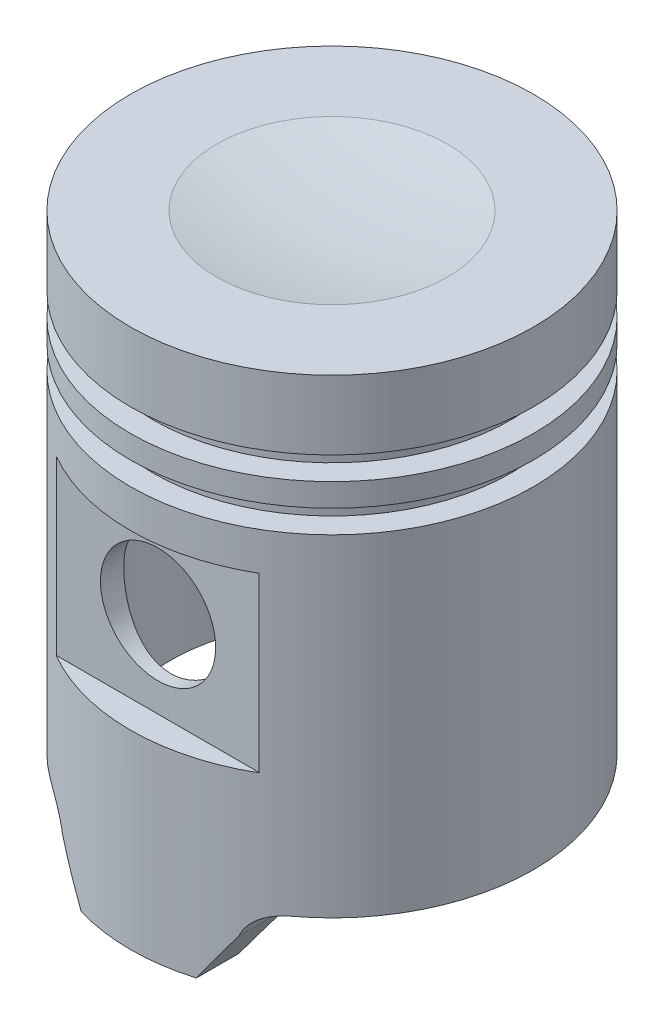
ISO-10303-21;
HEADER;
FILE_DESCRIPTION(('STEP AP214'),'2;1');
FILE_NAME('part.step','',(''),(''),'','','');
FILE_SCHEMA(('AUTOMOTIVE_DESIGN { 1 0 10303 214 1 1 1 1 }'));
ENDSEC;
DATA;
#1=APPLICATION_CONTEXT('core data for automotive mechanical design processes');
#2=APPLICATION_PROTOCOL_DEFINITION('international standard','automotive_design',2000,#1);
#3=PRODUCT_CONTEXT('',#1,'mechanical');
#4=PRODUCT('Part','Part','',(#3));
#5=PRODUCT_RELATED_PRODUCT_CATEGORY('part','',(#4));
#6=PRODUCT_DEFINITION_FORMATION('','',#4);
#7=PRODUCT_DEFINITION_CONTEXT('part definition',#1,'design');
#8=PRODUCT_DEFINITION('design','',#6,#7);
#9=PRODUCT_DEFINITION_SHAPE('','',#8);
#10=(LENGTH_UNIT() NAMED_UNIT(*) SI_UNIT(.MILLI.,.METRE.));
#11=(NAMED_UNIT(*) PLANE_ANGLE_UNIT() SI_UNIT($,.RADIAN.));
#12=(NAMED_UNIT(*) SI_UNIT($,.STERADIAN.) SOLID_ANGLE_UNIT());
#13=UNCERTAINTY_MEASURE_WITH_UNIT(LENGTH_MEASURE(1.E-05),#10,'distance_accuracy_value','');
#14=(GEOMETRIC_REPRESENTATION_CONTEXT(3) GLOBAL_UNCERTAINTY_ASSIGNED_CONTEXT((#13)) GLOBAL_UNIT_ASSIGNED_CONTEXT((#10,
#11,#12)) REPRESENTATION_CONTEXT('',''));
#15=CARTESIAN_POINT('',(0.,0.,0.));
#16=DIRECTION('',(0.,0.,1.));
#17=DIRECTION('',(1.,0.,0.));
#18=AXIS2_PLACEMENT_3D('',#15,#16,#17);
#19=CARTESIAN_POINT('',(0.,74.5117496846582,0.));
#20=DIRECTION('',(0.,1.,0.));
#21=DIRECTION('',(0.,0.,1.));
#22=AXIS2_PLACEMENT_3D('',#19,#20,#21);
#23=CYLINDRICAL_SURFACE('',#22,22.225);
#24=CARTESIAN_POINT('',(0.,-13.97,0.));
#25=DIRECTION('',(0.,1.,0.));
#26=DIRECTION('',(0.,0.,1.));
#27=AXIS2_PLACEMENT_3D('',#24,#25,#26);
#28=CIRCLE('',#27,22.225);
#29=CARTESIAN_POINT('',(0.,-13.97,22.225));
#30=VERTEX_POINT('',#29);
#31=EDGE_CURVE('E218',#30,#30,#28,.T.);
#32=ORIENTED_EDGE('',*,*,#31,.F.);
#33=EDGE_LOOP('',(#32));
#34=FACE_BOUND('',#33,.T.);
#35=CARTESIAN_POINT('',(0.,-18.161,0.));
#36=DIRECTION('',(0.,1.,0.));
#37=DIRECTION('',(0.,0.,1.));
#38=AXIS2_PLACEMENT_3D('',#35,#36,#37);
#39=CIRCLE('',#38,22.225);
#40=CARTESIAN_POINT('',(-11.176,-18.161,19.2106129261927));
#41=VERTEX_POINT('',#40);
#42=CARTESIAN_POINT('',(11.176,-18.161,19.2106129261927));
#43=VERTEX_POINT('',#42);
#44=EDGE_CURVE('E234',#41,#43,#39,.T.);
#45=ORIENTED_EDGE('',*,*,#44,.T.);
#46=DIRECTION('',(0.,1.,0.));
#47=VECTOR('',#46,1.);
#48=CARTESIAN_POINT('',(11.176,74.5117496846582,19.2106129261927));
#49=LINE('',#48,#47);
#50=CARTESIAN_POINT('',(11.176,-37.211,19.2106129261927));
#51=VERTEX_POINT('',#50);
#52=EDGE_CURVE('E242',#43,#51,#49,.F.);
#53=ORIENTED_EDGE('',*,*,#52,.T.);
#54=CARTESIAN_POINT('',(0.,-37.211,0.));
#55=DIRECTION('',(0.,-1.,0.));
#56=DIRECTION('',(0.,0.,-1.));
#57=AXIS2_PLACEMENT_3D('',#54,#55,#56);
#58=CIRCLE('',#57,22.225);
#59=CARTESIAN_POINT('',(-11.176,-37.211,19.2106129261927));
#60=VERTEX_POINT('',#59);
#61=EDGE_CURVE('E239',#51,#60,#58,.T.);
#62=ORIENTED_EDGE('',*,*,#61,.T.);
#63=DIRECTION('',(0.,1.,0.));
#64=VECTOR('',#63,1.);
#65=CARTESIAN_POINT('',(-11.176,74.5117496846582,19.2106129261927));
#66=LINE('',#65,#64);
#67=EDGE_CURVE('E236',#60,#41,#66,.T.);
#68=ORIENTED_EDGE('',*,*,#67,.T.);
#69=EDGE_LOOP('',(#45,#53,#62,#68));
#70=FACE_BOUND('',#69,.T.);
#71=CARTESIAN_POINT('',(0.,-37.211,0.));
#72=DIRECTION('',(0.,-1.,0.));
#73=DIRECTION('',(0.,0.,-1.));
#74=AXIS2_PLACEMENT_3D('',#71,#72,#73);
#75=CIRCLE('',#74,22.225);
#76=CARTESIAN_POINT('',(-11.176,-37.211,-19.2106129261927));
#77=VERTEX_POINT('',#76);
#78=CARTESIAN_POINT('',(11.176,-37.211,-19.2106129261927));
#79=VERTEX_POINT('',#78);
#80=EDGE_CURVE('E245',#77,#79,#75,.T.);
#81=ORIENTED_EDGE('',*,*,#80,.T.);
#82=DIRECTION('',(0.,1.,0.));
#83=VECTOR('',#82,1.);
#84=CARTESIAN_POINT('',(11.176,74.5117496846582,-19.2106129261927));
#85=LINE('',#84,#83);
#86=CARTESIAN_POINT('',(11.176,-18.161,-19.2106129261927));
#87=VERTEX_POINT('',#86);
#88=EDGE_CURVE('E252',#87,#79,#85,.F.);
#89=ORIENTED_EDGE('',*,*,#88,.F.);
#90=CARTESIAN_POINT('',(0.,-18.161,0.));
#91=DIRECTION('',(0.,-1.,0.));
#92=DIRECTION('',(0.,0.,-1.));
#93=AXIS2_PLACEMENT_3D('',#90,#91,#92);
#94=CIRCLE('',#93,22.225);
#95=CARTESIAN_POINT('',(-11.176,-18.161,-19.2106129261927));
#96=VERTEX_POINT('',#95);
#97=EDGE_CURVE('E250',#96,#87,#94,.T.);
#98=ORIENTED_EDGE('',*,*,#97,.F.);
#99=DIRECTION('',(0.,1.,0.));
#100=VECTOR('',#99,1.);
#101=CARTESIAN_POINT('',(-11.176,74.5117496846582,-19.2106129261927));
#102=LINE('',#101,#100);
#103=EDGE_CURVE('E247',#96,#77,#102,.F.);
#104=ORIENTED_EDGE('',*,*,#103,.T.);
#105=EDGE_LOOP('',(#81,#89,#98,#104));
#106=FACE_BOUND('',#105,.T.);
#107=CARTESIAN_POINT('',(0.,-67.6874233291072,0.));
#108=DIRECTION('',(-0.831954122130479,-0.554844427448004,0.));
#109=DIRECTION('',(-0.554844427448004,0.831954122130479,0.));
#110=AXIS2_PLACEMENT_3D('',#107,#108,#109);
#111=ELLIPSE('',#110,40.056273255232,22.225);
#112=CARTESIAN_POINT('',(-9.73913267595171,-53.0842099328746,-19.9774853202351));
#113=VERTEX_POINT('',#112);
#114=CARTESIAN_POINT('',(-6.34999999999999,-58.166,-21.2985474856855));
#115=VERTEX_POINT('',#114);
#116=EDGE_CURVE('E520',#113,#115,#111,.T.);
#117=ORIENTED_EDGE('',*,*,#116,.F.);
#118=CARTESIAN_POINT('',(-13.5127970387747,-58.166,-17.6452526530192));
#119=CARTESIAN_POINT('',(-13.6406369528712,-58.1600185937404,-17.5473693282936));
#120=CARTESIAN_POINT('',(-13.7671791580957,-58.1476814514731,-17.4482427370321));
#121=CARTESIAN_POINT('',(-14.0169702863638,-58.1108090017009,-17.2482057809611));
#122=CARTESIAN_POINT('',(-14.1402203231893,-58.0862778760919,-17.1472960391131));
#123=CARTESIAN_POINT('',(-14.3835870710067,-58.0253333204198,-16.9436839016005));
#124=CARTESIAN_POINT('',(-14.5036789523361,-57.9888455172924,-16.8409741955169));
#125=CARTESIAN_POINT('',(-14.7393675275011,-57.9043994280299,-16.6350878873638));
#126=CARTESIAN_POINT('',(-14.8549636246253,-57.8564396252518,-16.5319112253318));
#127=CARTESIAN_POINT('',(-15.0904330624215,-57.7448803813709,-16.3173790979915));
#128=CARTESIAN_POINT('',(-15.2098755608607,-57.6803186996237,-16.2060492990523));
#129=CARTESIAN_POINT('',(-15.4422045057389,-57.5381308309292,-15.9848265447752));
#130=CARTESIAN_POINT('',(-15.5550894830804,-57.4605017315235,-15.8749339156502));
#131=CARTESIAN_POINT('',(-15.7732632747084,-57.2922429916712,-15.6581727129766));
#132=CARTESIAN_POINT('',(-15.8785683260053,-57.2016424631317,-15.5512979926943));
#133=CARTESIAN_POINT('',(-16.0808086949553,-57.0070236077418,-15.3420786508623));
#134=CARTESIAN_POINT('',(-16.1777494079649,-56.9030140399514,-15.2397311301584));
#135=CARTESIAN_POINT('',(-16.3790566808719,-56.6604887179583,-15.023406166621));
#136=CARTESIAN_POINT('',(-16.4814994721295,-56.5191462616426,-14.9107613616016));
#137=CARTESIAN_POINT('',(-16.6696689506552,-56.2159499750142,-14.7000902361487));
#138=CARTESIAN_POINT('',(-16.7554243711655,-56.0541322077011,-14.6020388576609));
#139=CARTESIAN_POINT('',(-16.8891217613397,-55.7478937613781,-14.4470166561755));
#140=CARTESIAN_POINT('',(-16.9412321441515,-55.6074933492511,-14.3857544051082));
#141=CARTESIAN_POINT('',(-17.0296662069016,-55.3153279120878,-14.2809608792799));
#142=CARTESIAN_POINT('',(-17.0660038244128,-55.1635730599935,-14.2374139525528));
#143=CARTESIAN_POINT('',(-17.1066562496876,-54.9293525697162,-14.18849451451));
#144=CARTESIAN_POINT('',(-17.1179212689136,-54.8497201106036,-14.174892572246));
#145=CARTESIAN_POINT('',(-17.1354270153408,-54.6891268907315,-14.1537260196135));
#146=CARTESIAN_POINT('',(-17.1416703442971,-54.6081668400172,-14.1461582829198));
#147=CARTESIAN_POINT('',(-17.1489579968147,-54.4456969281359,-14.1373229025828));
#148=CARTESIAN_POINT('',(-17.1500042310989,-54.3641872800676,-14.1360529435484));
#149=CARTESIAN_POINT('',(-17.1468839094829,-54.2014418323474,-14.139837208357));
#150=CARTESIAN_POINT('',(-17.1427178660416,-54.1202060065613,-14.1448908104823));
#151=CARTESIAN_POINT('',(-17.12452301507,-53.9018823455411,-14.1669228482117));
#152=CARTESIAN_POINT('',(-17.1056156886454,-53.7657348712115,-14.189791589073));
#153=CARTESIAN_POINT('',(-17.0542954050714,-53.4998630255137,-14.2514280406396));
#154=CARTESIAN_POINT('',(-17.0218751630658,-53.3701421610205,-14.2902043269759));
#155=CARTESIAN_POINT('',(-16.9303916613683,-53.0698407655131,-14.3985842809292));
#156=CARTESIAN_POINT('',(-16.8658668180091,-52.9031446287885,-14.4743135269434));
#157=CARTESIAN_POINT('',(-16.7189485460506,-52.5876480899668,-14.643768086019));
#158=CARTESIAN_POINT('',(-16.6365115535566,-52.4388927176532,-14.737537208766));
#159=CARTESIAN_POINT('',(-16.4819224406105,-52.1974958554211,-14.9099436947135));
#160=CARTESIAN_POINT('',(-16.4130907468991,-52.1006104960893,-14.9857398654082));
#161=CARTESIAN_POINT('',(-16.2688868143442,-51.9159690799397,-15.1421681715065));
#162=CARTESIAN_POINT('',(-16.1935116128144,-51.8282171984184,-15.2228024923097));
#163=CARTESIAN_POINT('',(-16.0369728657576,-51.6615362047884,-15.3876266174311));
#164=CARTESIAN_POINT('',(-15.9558052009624,-51.5826134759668,-15.4718189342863));
#165=CARTESIAN_POINT('',(-15.7883487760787,-51.4334398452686,-15.6426662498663));
#166=CARTESIAN_POINT('',(-15.7020606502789,-51.3631878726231,-15.7293209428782));
#167=CARTESIAN_POINT('',(-15.4295285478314,-51.1601743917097,-15.9983378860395));
#168=CARTESIAN_POINT('',(-15.2354898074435,-51.0413390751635,-16.183507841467));
#169=CARTESIAN_POINT('',(-14.8306433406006,-50.8400586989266,-16.555309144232));
#170=CARTESIAN_POINT('',(-14.619830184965,-50.7576254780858,-16.7419409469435));
#171=CARTESIAN_POINT('',(-14.2698523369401,-50.6556253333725,-17.0397268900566));
#172=CARTESIAN_POINT('',(-14.1349097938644,-50.6240802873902,-17.1518547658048));
#173=CARTESIAN_POINT('',(-13.8607496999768,-50.5756980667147,-17.3741578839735));
#174=CARTESIAN_POINT('',(-13.7215312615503,-50.5588639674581,-17.4843327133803));
#175=CARTESIAN_POINT('',(-13.4399256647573,-50.5406911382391,-17.701712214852));
#176=CARTESIAN_POINT('',(-13.2975408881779,-50.5393411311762,-17.80891899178));
#177=CARTESIAN_POINT('',(-13.0108213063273,-50.5529433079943,-18.0194577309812));
#178=CARTESIAN_POINT('',(-12.8664872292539,-50.5678895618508,-18.1227910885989));
#179=CARTESIAN_POINT('',(-12.5052748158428,-50.6267544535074,-18.3749290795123));
#180=CARTESIAN_POINT('',(-12.2879248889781,-50.681366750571,-18.5208642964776));
#181=CARTESIAN_POINT('',(-11.9661288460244,-50.7941369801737,-18.7290926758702));
#182=CARTESIAN_POINT('',(-11.8595369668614,-50.8368864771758,-18.7967417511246));
#183=CARTESIAN_POINT('',(-11.6487200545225,-50.9329072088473,-18.9281088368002));
#184=CARTESIAN_POINT('',(-11.5444938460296,-50.9861730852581,-18.991828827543));
#185=CARTESIAN_POINT('',(-11.3386116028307,-51.1038726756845,-19.1154668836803));
#186=CARTESIAN_POINT('',(-11.2369861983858,-51.1684004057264,-19.1753466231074));
#187=CARTESIAN_POINT('',(-11.0385809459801,-51.3082321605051,-19.290243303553));
#188=CARTESIAN_POINT('',(-10.9417986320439,-51.3835306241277,-19.3452627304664));
#189=CARTESIAN_POINT('',(-10.7544093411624,-51.5446782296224,-19.4500599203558));
#190=CARTESIAN_POINT('',(-10.6638006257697,-51.6305243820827,-19.4998391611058));
#191=CARTESIAN_POINT('',(-10.4901414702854,-51.812324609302,-19.5938078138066));
#192=CARTESIAN_POINT('',(-10.4070895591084,-51.9082767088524,-19.6379983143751));
#193=CARTESIAN_POINT('',(-10.2609840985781,-52.095427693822,-19.7146811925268));
#194=CARTESIAN_POINT('',(-10.1967602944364,-52.1853999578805,-19.7479448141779));
#195=CARTESIAN_POINT('',(-10.0757735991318,-52.37169034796,-19.8099478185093));
#196=CARTESIAN_POINT('',(-10.01900954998,-52.4680074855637,-19.8386879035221));
#197=CARTESIAN_POINT('',(-9.91375680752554,-52.6662096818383,-19.8914936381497));
#198=CARTESIAN_POINT('',(-9.86526341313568,-52.7680915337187,-19.9155619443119));
#199=CARTESIAN_POINT('',(-9.77721565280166,-52.9766207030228,-19.9589351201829));
#200=CARTESIAN_POINT('',(-9.73766047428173,-53.0832675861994,-19.9782404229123));
#201=CARTESIAN_POINT('',(-9.67195003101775,-53.2882727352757,-20.0101271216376));
#202=CARTESIAN_POINT('',(-9.64479334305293,-53.3862323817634,-20.0232177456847));
#203=CARTESIAN_POINT('',(-9.5983159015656,-53.5844632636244,-20.0455387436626));
#204=CARTESIAN_POINT('',(-9.57899764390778,-53.6847352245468,-20.0547678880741));
#205=CARTESIAN_POINT('',(-9.54845707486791,-53.8867132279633,-20.0693268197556));
#206=CARTESIAN_POINT('',(-9.53722923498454,-53.9884182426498,-20.0746592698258));
#207=CARTESIAN_POINT('',(-9.52298276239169,-54.1925697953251,-20.0814214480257));
#208=CARTESIAN_POINT('',(-9.51996708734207,-54.2950165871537,-20.0828497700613));
#209=CARTESIAN_POINT('',(-9.52213695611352,-54.4949196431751,-20.0818209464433));
#210=CARTESIAN_POINT('',(-9.52693885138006,-54.5923812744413,-20.0795455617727));
#211=CARTESIAN_POINT('',(-9.54397806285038,-54.7865395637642,-20.0714522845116));
#212=CARTESIAN_POINT('',(-9.55621799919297,-54.8832359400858,-20.0656331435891));
#213=CARTESIAN_POINT('',(-9.58799217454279,-55.0750925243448,-20.050469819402));
#214=CARTESIAN_POINT('',(-9.60752286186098,-55.1702534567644,-20.041127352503));
#215=CARTESIAN_POINT('',(-9.65367134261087,-55.3584589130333,-20.0189387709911));
#216=CARTESIAN_POINT('',(-9.6802917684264,-55.4515026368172,-20.0060913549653));
#217=CARTESIAN_POINT('',(-9.74029686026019,-55.6347092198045,-19.9769455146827));
#218=CARTESIAN_POINT('',(-9.77367368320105,-55.7248752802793,-19.960651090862));
#219=CARTESIAN_POINT('',(-9.84685068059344,-55.9018700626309,-19.92465351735));
#220=CARTESIAN_POINT('',(-9.88665315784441,-55.9886975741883,-19.9049491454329));
#221=CARTESIAN_POINT('',(-10.0150872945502,-56.2433090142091,-19.8408119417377));
#222=CARTESIAN_POINT('',(-10.1127975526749,-56.4053782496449,-19.7913302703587));
#223=CARTESIAN_POINT('',(-10.3327446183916,-56.7165006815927,-19.6774209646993));
#224=CARTESIAN_POINT('',(-10.4558062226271,-56.8647738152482,-19.6124746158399));
#225=CARTESIAN_POINT('',(-10.7189955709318,-57.1381281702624,-19.4698777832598));
#226=CARTESIAN_POINT('',(-10.8591226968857,-57.2632102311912,-19.3922277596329));
#227=CARTESIAN_POINT('',(-11.1641153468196,-57.4984754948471,-19.2183883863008));
#228=CARTESIAN_POINT('',(-11.3300712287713,-57.606488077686,-19.1211841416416));
#229=CARTESIAN_POINT('',(-11.6710130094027,-57.7935538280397,-18.9150173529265));
#230=CARTESIAN_POINT('',(-11.8460131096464,-57.8725597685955,-18.8060360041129));
#231=CARTESIAN_POINT('',(-12.21094438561,-58.0062378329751,-18.571302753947));
#232=CARTESIAN_POINT('',(-12.4011328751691,-58.0591195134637,-18.4449321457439));
#233=CARTESIAN_POINT('',(-12.6858525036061,-58.1157426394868,-18.2491936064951));
#234=CARTESIAN_POINT('',(-12.7805135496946,-58.1308276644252,-18.1830282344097));
#235=CARTESIAN_POINT('',(-12.969323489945,-58.1537641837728,-18.0488416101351));
#236=CARTESIAN_POINT('',(-13.0634726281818,-58.1616194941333,-17.980821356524));
#237=CARTESIAN_POINT('',(-13.1572029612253,-58.166,-17.911969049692));
#238=B_SPLINE_CURVE_WITH_KNOTS('',3,(#118,#119,#120,#121,#122,#123,#124,#125,#126,#127,#128,
#129,#130,#131,#132,#133,#134,#135,#136,#137,#138,#139,#140,#141,#142,#143,#144,#145,#146,#147,
#148,#149,#150,#151,#152,#153,#154,#155,#156,#157,#158,#159,#160,#161,#162,#163,#164,#165,#166,
#167,#168,#169,#170,#171,#172,#173,#174,#175,#176,#177,#178,#179,#180,#181,#182,#183,#184,#185,
#186,#187,#188,#189,#190,#191,#192,#193,#194,#195,#196,#197,#198,#199,#200,#201,#202,#203,#204,
#205,#206,#207,#208,#209,#210,#211,#212,#213,#214,#215,#216,#217,#218,#219,#220,#221,#222,#223,
#224,#225,#226,#227,#228,#229,#230,#231,#232,#233,#234,#235,#236,#237),.UNSPECIFIED.,.F.,.F.,(4,
2,2,2,2,2,2,2,2,2,2,2,2,2,2,2,2,2,2,2,2,2,2,2,2,2,2,2,2,2,2,2,2,2,2,2,2,2,2,2,2,2,2,2,2,2,2,2,2,
2,2,2,2,2,2,2,2,2,2,4),(0.,0.483171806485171,0.966178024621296,1.45224755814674,
1.93838138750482,2.4645205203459,2.99077707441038,3.51587053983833,4.04062272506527,
4.66207962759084,5.28245681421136,5.7661707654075,6.24945640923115,6.49382884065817,
6.73807458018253,6.98223051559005,7.22636244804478,7.64235658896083,8.05857528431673,
8.63773225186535,9.21831386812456,9.64066030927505,10.0631989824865,10.486041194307,
10.9088311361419,11.7858288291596,12.663111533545,13.1973073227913,13.7316147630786,
14.2655330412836,14.7992570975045,15.5977224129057,15.9971948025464,16.3964641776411,
16.7992418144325,17.2018122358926,17.6042688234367,18.0066468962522,18.3524848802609,
18.6982691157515,19.0438561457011,19.3894117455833,19.6965062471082,20.0036984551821,
20.3106805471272,20.6177731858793,20.9102442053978,21.2028183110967,21.4952500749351,
21.7877905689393,22.0799933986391,22.3723011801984,22.9564227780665,23.563911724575,
24.1713786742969,24.8304886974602,25.4906671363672,26.1913513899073,26.5405730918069,
26.8896103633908),.UNSPECIFIED.);
#239=CARTESIAN_POINT('',(-13.335,-50.5418537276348,-17.78));
#240=VERTEX_POINT('',#239);
#241=EDGE_CURVE('E456',#240,#113,#238,.T.);
#242=ORIENTED_EDGE('',*,*,#241,.F.);
#243=CARTESIAN_POINT('',(0.,-50.5418537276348,0.));
#244=DIRECTION('',(0.,1.,0.));
#245=DIRECTION('',(0.,0.,1.));
#246=AXIS2_PLACEMENT_3D('',#243,#244,#245);
#247=CIRCLE('',#246,22.225);
#248=CARTESIAN_POINT('',(-13.335,-50.5418537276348,17.78));
#249=VERTEX_POINT('',#248);
#250=EDGE_CURVE('E463',#240,#249,#247,.T.);
#251=ORIENTED_EDGE('',*,*,#250,.T.);
#252=CARTESIAN_POINT('',(-13.1572029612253,-58.166,17.911969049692));
#253=CARTESIAN_POINT('',(-13.0266357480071,-58.1599109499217,18.0079044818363));
#254=CARTESIAN_POINT('',(-12.8951364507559,-58.1470417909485,18.1022719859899));
#255=CARTESIAN_POINT('',(-12.631345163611,-58.1070542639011,18.2873039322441));
#256=CARTESIAN_POINT('',(-12.4990521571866,-58.0799095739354,18.3779611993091));
#257=CARTESIAN_POINT('',(-12.2346692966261,-58.0105504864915,18.5550257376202));
#258=CARTESIAN_POINT('',(-12.1025827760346,-57.9682716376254,18.6414130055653));
#259=CARTESIAN_POINT('',(-11.8409626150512,-57.8681435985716,18.8086755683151));
#260=CARTESIAN_POINT('',(-11.7114267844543,-57.8103084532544,18.8895557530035));
#261=CARTESIAN_POINT('',(-11.4933584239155,-57.6976330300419,19.0227410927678));
#262=CARTESIAN_POINT('',(-11.4037305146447,-57.6466996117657,19.0765837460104));
#263=CARTESIAN_POINT('',(-11.2275112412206,-57.5367205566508,19.1808259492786));
#264=CARTESIAN_POINT('',(-11.1409191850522,-57.4776767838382,19.2312262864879));
#265=CARTESIAN_POINT('',(-10.9717794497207,-57.3516634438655,19.3282220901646));
#266=CARTESIAN_POINT('',(-10.8892237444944,-57.2847105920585,19.3748252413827));
#267=CARTESIAN_POINT('',(-10.7288824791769,-57.1429885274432,19.4640725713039));
#268=CARTESIAN_POINT('',(-10.6510946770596,-57.068223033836,19.5067186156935));
#269=CARTESIAN_POINT('',(-10.5006372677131,-56.9106133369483,19.5881242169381));
#270=CARTESIAN_POINT('',(-10.4280063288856,-56.8277173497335,19.626855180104));
#271=CARTESIAN_POINT('',(-10.2894053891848,-56.6547689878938,19.699870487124));
#272=CARTESIAN_POINT('',(-10.2234323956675,-56.5647198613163,19.7341568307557));
#273=CARTESIAN_POINT('',(-10.0989628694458,-56.3779729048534,19.7981432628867));
#274=CARTESIAN_POINT('',(-10.0404707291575,-56.2812712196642,19.8278406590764));
#275=CARTESIAN_POINT('',(-9.93184293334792,-56.0820086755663,19.8824752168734));
#276=CARTESIAN_POINT('',(-9.88170635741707,-55.9794484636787,19.9074129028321));
#277=CARTESIAN_POINT('',(-9.79511553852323,-55.7799174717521,19.9501485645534));
#278=CARTESIAN_POINT('',(-9.75779222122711,-55.6834224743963,19.9684124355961));
#279=CARTESIAN_POINT('',(-9.69094335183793,-55.4870704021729,20.0009406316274));
#280=CARTESIAN_POINT('',(-9.66142041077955,-55.387212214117,20.0152036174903));
#281=CARTESIAN_POINT('',(-9.61058479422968,-55.1850351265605,20.0396626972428));
#282=CARTESIAN_POINT('',(-9.58926486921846,-55.0827184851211,20.0498623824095));
#283=CARTESIAN_POINT('',(-9.55506335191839,-54.8763225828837,20.0661842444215));
#284=CARTESIAN_POINT('',(-9.54218475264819,-54.7722427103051,20.0723049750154));
#285=CARTESIAN_POINT('',(-9.52558115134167,-54.5697786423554,20.0801893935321));
#286=CARTESIAN_POINT('',(-9.52133270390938,-54.4714466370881,20.0822022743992));
#287=CARTESIAN_POINT('',(-9.52045119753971,-54.2747045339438,20.0826202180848));
#288=CARTESIAN_POINT('',(-9.52382080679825,-54.1762944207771,20.0810240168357));
#289=CARTESIAN_POINT('',(-9.53813974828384,-53.9802031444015,20.0742266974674));
#290=CARTESIAN_POINT('',(-9.54908526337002,-53.8825216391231,20.0690273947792));
#291=CARTESIAN_POINT('',(-9.57843237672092,-53.6885107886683,20.0550373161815));
#292=CARTESIAN_POINT('',(-9.59683672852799,-53.5921819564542,20.0462452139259));
#293=CARTESIAN_POINT('',(-9.64060183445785,-53.4028790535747,20.0252341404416));
#294=CARTESIAN_POINT('',(-9.66586546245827,-53.3098772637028,20.0130629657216));
#295=CARTESIAN_POINT('',(-9.72317306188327,-53.1265025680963,19.9852830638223));
#296=CARTESIAN_POINT('',(-9.75521945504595,-53.0361306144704,19.9696731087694));
#297=CARTESIAN_POINT('',(-9.86103319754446,-52.7699263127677,19.9177523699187));
#298=CARTESIAN_POINT('',(-9.94451937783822,-52.5988168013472,19.8763299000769));
#299=CARTESIAN_POINT('',(-10.1365206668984,-52.269163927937,19.7791153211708));
#300=CARTESIAN_POINT('',(-10.2456640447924,-52.1110988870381,19.7229575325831));
#301=CARTESIAN_POINT('',(-10.4832777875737,-51.8160630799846,19.5976918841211));
#302=CARTESIAN_POINT('',(-10.611752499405,-51.6790970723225,19.5285811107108));
#303=CARTESIAN_POINT('',(-10.893094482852,-51.4193286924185,19.3731433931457));
#304=CARTESIAN_POINT('',(-11.0470477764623,-51.2982322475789,19.2859403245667));
#305=CARTESIAN_POINT('',(-11.3663367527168,-51.0835172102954,19.0995086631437));
#306=CARTESIAN_POINT('',(-11.5316770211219,-50.9899097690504,19.0002752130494));
#307=CARTESIAN_POINT('',(-11.8891842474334,-50.8203187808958,18.7789030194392));
#308=CARTESIAN_POINT('',(-12.082182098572,-50.7478210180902,18.6554451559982));
#309=CARTESIAN_POINT('',(-12.4706210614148,-50.6355826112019,18.3980615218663));
#310=CARTESIAN_POINT('',(-12.6660633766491,-50.5958588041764,18.2641304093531));
#311=CARTESIAN_POINT('',(-13.087022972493,-50.543086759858,17.9654505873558));
#312=CARTESIAN_POINT('',(-13.3121981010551,-50.5355024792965,17.7992568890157));
#313=CARTESIAN_POINT('',(-13.7548361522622,-50.5585443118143,17.4594747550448));
#314=CARTESIAN_POINT('',(-13.9722931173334,-50.5891993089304,17.2858808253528));
#315=CARTESIAN_POINT('',(-14.4330651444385,-50.6944209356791,16.9038886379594));
#316=CARTESIAN_POINT('',(-14.6742434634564,-50.7757348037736,16.6947171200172));
#317=CARTESIAN_POINT('',(-15.0206312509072,-50.932195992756,16.3815675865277));
#318=CARTESIAN_POINT('',(-15.133608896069,-50.9901541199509,16.2772082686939));
#319=CARTESIAN_POINT('',(-15.3539571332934,-51.117526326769,16.0695198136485));
#320=CARTESIAN_POINT('',(-15.4613286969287,-51.1869384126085,15.9661905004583));
#321=CARTESIAN_POINT('',(-15.6551552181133,-51.3266784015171,15.7760107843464));
#322=CARTESIAN_POINT('',(-15.7424281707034,-51.395504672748,15.6888865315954));
#323=CARTESIAN_POINT('',(-15.91192017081,-51.5417989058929,15.5169579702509));
#324=CARTESIAN_POINT('',(-15.9941388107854,-51.6192675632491,15.4321538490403));
#325=CARTESIAN_POINT('',(-16.1528224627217,-51.7829544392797,15.2659793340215));
#326=CARTESIAN_POINT('',(-16.2292958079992,-51.8691595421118,15.1846040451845));
#327=CARTESIAN_POINT('',(-16.375842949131,-52.0506619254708,15.0264440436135));
#328=CARTESIAN_POINT('',(-16.4459195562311,-52.1459551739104,14.949657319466));
#329=CARTESIAN_POINT('',(-16.6009045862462,-52.3793314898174,14.7776192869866));
#330=CARTESIAN_POINT('',(-16.6829876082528,-52.5211007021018,14.6847275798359));
#331=CARTESIAN_POINT('',(-16.8309275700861,-52.8216749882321,14.5149297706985));
#332=CARTESIAN_POINT('',(-16.8968095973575,-52.980453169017,14.4379989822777));
#333=CARTESIAN_POINT('',(-16.9969821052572,-53.280232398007,14.3198462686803));
#334=CARTESIAN_POINT('',(-17.0349635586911,-53.418366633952,14.274552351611));
#335=CARTESIAN_POINT('',(-17.0955493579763,-53.7025349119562,14.2019394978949));
#336=CARTESIAN_POINT('',(-17.118169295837,-53.8485607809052,14.174602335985));
#337=CARTESIAN_POINT('',(-17.1462711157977,-54.1455796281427,14.140598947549));
#338=CARTESIAN_POINT('',(-17.1516525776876,-54.2965965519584,14.13405384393));
#339=CARTESIAN_POINT('',(-17.1444645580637,-54.5975698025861,14.1427714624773));
#340=CARTESIAN_POINT('',(-17.1318929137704,-54.7475259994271,14.1580368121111));
#341=CARTESIAN_POINT('',(-17.0917799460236,-55.028909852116,14.2064257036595));
#342=CARTESIAN_POINT('',(-17.0656050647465,-55.1608276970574,14.2379171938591));
#343=CARTESIAN_POINT('',(-17.0009298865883,-55.4172156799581,14.3150808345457));
#344=CARTESIAN_POINT('',(-16.9624240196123,-55.541682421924,14.3607593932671));
#345=CARTESIAN_POINT('',(-16.8522809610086,-55.8439681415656,14.4900531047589));
#346=CARTESIAN_POINT('',(-16.7738057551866,-56.016116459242,14.5810739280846));
#347=CARTESIAN_POINT('',(-16.5980871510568,-56.3394366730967,14.7807935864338));
#348=CARTESIAN_POINT('',(-16.5007929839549,-56.4905498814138,14.8895401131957));
#349=CARTESIAN_POINT('',(-16.3202626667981,-56.7334035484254,15.0868268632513));
#350=CARTESIAN_POINT('',(-16.2405368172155,-56.830032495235,15.172681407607));
#351=CARTESIAN_POINT('',(-16.0742454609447,-57.0129791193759,15.3487429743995));
#352=CARTESIAN_POINT('',(-15.987676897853,-57.0992921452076,15.4389519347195));
#353=CARTESIAN_POINT('',(-15.8084193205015,-57.2619542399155,15.6224512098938));
#354=CARTESIAN_POINT('',(-15.7157237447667,-57.3382923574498,15.7157447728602));
#355=CARTESIAN_POINT('',(-15.5249138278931,-57.4810900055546,15.9042657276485));
#356=CARTESIAN_POINT('',(-15.4268003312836,-57.5475510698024,15.9994928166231));
#357=CARTESIAN_POINT('',(-15.2224106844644,-57.6726545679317,16.1941149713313));
#358=CARTESIAN_POINT('',(-15.115973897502,-57.7309793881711,16.2935460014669));
#359=CARTESIAN_POINT('',(-14.8983576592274,-57.837134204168,16.4927682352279));
#360=CARTESIAN_POINT('',(-14.7871774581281,-57.884962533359,16.5925594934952));
#361=CARTESIAN_POINT('',(-14.447647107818,-58.0122292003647,16.8910127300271));
#362=CARTESIAN_POINT('',(-14.2126695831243,-58.0758381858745,17.0893648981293));
#363=CARTESIAN_POINT('',(-13.8962098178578,-58.1294068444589,17.3451861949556));
#364=CARTESIAN_POINT('',(-13.8202500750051,-58.139936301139,17.4057701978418));
#365=CARTESIAN_POINT('',(-13.6672905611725,-58.1564209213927,17.5261294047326));
#366=CARTESIAN_POINT('',(-13.5902915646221,-58.1623793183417,17.5859051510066));
#367=CARTESIAN_POINT('',(-13.5127970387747,-58.166,17.6452526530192));
#368=B_SPLINE_CURVE_WITH_KNOTS('',3,(#252,#253,#254,#255,#256,#257,#258,#259,#260,#261,#262,
#263,#264,#265,#266,#267,#268,#269,#270,#271,#272,#273,#274,#275,#276,#277,#278,#279,#280,#281,
#282,#283,#284,#285,#286,#287,#288,#289,#290,#291,#292,#293,#294,#295,#296,#297,#298,#299,#300,
#301,#302,#303,#304,#305,#306,#307,#308,#309,#310,#311,#312,#313,#314,#315,#316,#317,#318,#319,
#320,#321,#322,#323,#324,#325,#326,#327,#328,#329,#330,#331,#332,#333,#334,#335,#336,#337,#338,
#339,#340,#341,#342,#343,#344,#345,#346,#347,#348,#349,#350,#351,#352,#353,#354,#355,#356,#357,
#358,#359,#360,#361,#362,#363,#364,#365,#366,#367),.UNSPECIFIED.,.F.,.F.,(4,2,2,2,2,2,2,2,2,2,2,
2,2,2,2,2,2,2,2,2,2,2,2,2,2,2,2,2,2,2,2,2,2,2,2,2,2,2,2,2,2,2,2,2,2,2,2,2,2,2,2,2,2,2,2,2,2,4),
(0.,0.486378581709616,0.973657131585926,1.46303602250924,1.95197455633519,2.30054623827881,
2.64903794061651,2.99680587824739,3.34440900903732,3.69439090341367,4.04421477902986,
4.39424312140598,4.7442328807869,5.0590105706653,5.37389349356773,5.68849749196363,
6.00321297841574,6.29818977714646,6.59326990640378,6.88820146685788,7.18324200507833,
7.47430501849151,7.76547212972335,8.3472285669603,8.9450718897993,9.54304984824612,
10.183659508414,10.8245286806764,11.5426688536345,12.2611777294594,13.0978973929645,
13.935249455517,14.9191762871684,15.411873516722,15.904485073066,16.3278184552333,
16.7511859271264,17.1739269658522,17.5964813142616,18.1596622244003,18.7219654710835,
19.1709384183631,19.6194549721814,20.0705795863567,20.5217585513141,20.9345032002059,
21.3474345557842,21.9737701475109,22.6018196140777,23.0568631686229,23.5121111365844,
23.9678547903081,24.4235276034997,24.8937578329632,25.3640626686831,26.3018030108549,
26.594919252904,26.8878279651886),.UNSPECIFIED.);
#369=CARTESIAN_POINT('',(-9.73913267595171,-53.0842099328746,19.9774853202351));
#370=VERTEX_POINT('',#369);
#371=EDGE_CURVE('E462',#370,#249,#368,.T.);
#372=ORIENTED_EDGE('',*,*,#371,.F.);
#373=CARTESIAN_POINT('',(-6.34999999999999,-58.166,21.2985474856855));
#374=VERTEX_POINT('',#373);
#375=EDGE_CURVE('E524',#374,#370,#111,.T.);
#376=ORIENTED_EDGE('',*,*,#375,.F.);
#377=CARTESIAN_POINT('',(0.,-58.166,0.));
#378=DIRECTION('',(0.,1.,0.));
#379=DIRECTION('',(0.,0.,1.));
#380=AXIS2_PLACEMENT_3D('',#377,#378,#379);
#381=CIRCLE('',#380,22.225);
#382=CARTESIAN_POINT('',(6.34999999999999,-58.166,21.2985474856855));
#383=VERTEX_POINT('',#382);
#384=EDGE_CURVE('E212',#374,#383,#381,.T.);
#385=ORIENTED_EDGE('',*,*,#384,.T.);
#386=CARTESIAN_POINT('',(0.,-67.6874233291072,0.));
#387=DIRECTION('',(-0.831954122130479,0.554844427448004,0.));
#388=DIRECTION('',(0.554844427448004,0.831954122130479,0.));
#389=AXIS2_PLACEMENT_3D('',#386,#387,#388);
#390=ELLIPSE('',#389,40.056273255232,22.225);
#391=CARTESIAN_POINT('',(9.73913267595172,-53.0842099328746,19.9774853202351));
#392=VERTEX_POINT('',#391);
#393=EDGE_CURVE('E70',#383,#392,#390,.T.);
#394=ORIENTED_EDGE('',*,*,#393,.T.);
#395=CARTESIAN_POINT('',(13.1572029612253,-58.166,17.911969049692));
#396=CARTESIAN_POINT('',(13.0266357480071,-58.1599109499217,18.0079044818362));
#397=CARTESIAN_POINT('',(12.8951364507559,-58.1470417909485,18.1022719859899));
#398=CARTESIAN_POINT('',(12.631345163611,-58.1070542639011,18.2873039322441));
#399=CARTESIAN_POINT('',(12.4990521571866,-58.0799095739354,18.3779611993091));
#400=CARTESIAN_POINT('',(12.2346692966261,-58.0105504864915,18.5550257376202));
#401=CARTESIAN_POINT('',(12.1025827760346,-57.9682716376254,18.6414130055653));
#402=CARTESIAN_POINT('',(11.8409626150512,-57.8681435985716,18.8086755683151));
#403=CARTESIAN_POINT('',(11.7114267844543,-57.8103084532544,18.8895557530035));
#404=CARTESIAN_POINT('',(11.4933584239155,-57.6976330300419,19.0227410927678));
#405=CARTESIAN_POINT('',(11.4037305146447,-57.6466996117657,19.0765837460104));
#406=CARTESIAN_POINT('',(11.2275112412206,-57.5367205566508,19.1808259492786));
#407=CARTESIAN_POINT('',(11.1409191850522,-57.4776767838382,19.2312262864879));
#408=CARTESIAN_POINT('',(10.9717794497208,-57.3516634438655,19.3282220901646));
#409=CARTESIAN_POINT('',(10.8892237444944,-57.2847105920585,19.3748252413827));
#410=CARTESIAN_POINT('',(10.7288824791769,-57.1429885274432,19.4640725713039));
#411=CARTESIAN_POINT('',(10.6510946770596,-57.068223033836,19.5067186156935));
#412=CARTESIAN_POINT('',(10.5006372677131,-56.9106133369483,19.5881242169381));
#413=CARTESIAN_POINT('',(10.4280063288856,-56.8277173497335,19.626855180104));
#414=CARTESIAN_POINT('',(10.2894053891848,-56.6547689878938,19.699870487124));
#415=CARTESIAN_POINT('',(10.2234323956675,-56.5647198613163,19.7341568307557));
#416=CARTESIAN_POINT('',(10.0989628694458,-56.3779729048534,19.7981432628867));
#417=CARTESIAN_POINT('',(10.0404707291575,-56.2812712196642,19.8278406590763));
#418=CARTESIAN_POINT('',(9.93184293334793,-56.0820086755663,19.8824752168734));
#419=CARTESIAN_POINT('',(9.88170635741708,-55.9794484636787,19.9074129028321));
#420=CARTESIAN_POINT('',(9.79511553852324,-55.7799174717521,19.9501485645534));
#421=CARTESIAN_POINT('',(9.75779222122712,-55.6834224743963,19.9684124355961));
#422=CARTESIAN_POINT('',(9.69094335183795,-55.4870704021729,20.0009406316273));
#423=CARTESIAN_POINT('',(9.66142041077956,-55.387212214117,20.0152036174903));
#424=CARTESIAN_POINT('',(9.61058479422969,-55.1850351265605,20.0396626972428));
#425=CARTESIAN_POINT('',(9.58926486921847,-55.0827184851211,20.0498623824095));
#426=CARTESIAN_POINT('',(9.5550633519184,-54.8763225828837,20.0661842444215));
#427=CARTESIAN_POINT('',(9.54218475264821,-54.7722427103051,20.0723049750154));
#428=CARTESIAN_POINT('',(9.52558115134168,-54.5697786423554,20.0801893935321));
#429=CARTESIAN_POINT('',(9.52133270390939,-54.4714466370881,20.0822022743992));
#430=CARTESIAN_POINT('',(9.52045119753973,-54.2747045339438,20.0826202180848));
#431=CARTESIAN_POINT('',(9.52382080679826,-54.1762944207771,20.0810240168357));
#432=CARTESIAN_POINT('',(9.53813974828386,-53.9802031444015,20.0742266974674));
#433=CARTESIAN_POINT('',(9.54908526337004,-53.8825216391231,20.0690273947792));
#434=CARTESIAN_POINT('',(9.57843237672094,-53.6885107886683,20.0550373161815));
#435=CARTESIAN_POINT('',(9.596836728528,-53.5921819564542,20.0462452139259));
#436=CARTESIAN_POINT('',(9.64060183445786,-53.4028790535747,20.0252341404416));
#437=CARTESIAN_POINT('',(9.66586546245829,-53.3098772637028,20.0130629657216));
#438=CARTESIAN_POINT('',(9.72317306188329,-53.1265025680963,19.9852830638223));
#439=CARTESIAN_POINT('',(9.75521945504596,-53.0361306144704,19.9696731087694));
#440=CARTESIAN_POINT('',(9.86103319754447,-52.7699263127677,19.9177523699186));
#441=CARTESIAN_POINT('',(9.94451937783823,-52.5988168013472,19.8763299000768));
#442=CARTESIAN_POINT('',(10.1365206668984,-52.269163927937,19.7791153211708));
#443=CARTESIAN_POINT('',(10.2456640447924,-52.1110988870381,19.7229575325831));
#444=CARTESIAN_POINT('',(10.4832777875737,-51.8160630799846,19.597691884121));
#445=CARTESIAN_POINT('',(10.611752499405,-51.6790970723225,19.5285811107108));
#446=CARTESIAN_POINT('',(10.893094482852,-51.4193286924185,19.3731433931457));
#447=CARTESIAN_POINT('',(11.0470477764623,-51.2982322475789,19.2859403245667));
#448=CARTESIAN_POINT('',(11.3663367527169,-51.0835172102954,19.0995086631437));
#449=CARTESIAN_POINT('',(11.5316770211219,-50.9899097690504,19.0002752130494));
#450=CARTESIAN_POINT('',(11.8891842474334,-50.8203187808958,18.7789030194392));
#451=CARTESIAN_POINT('',(12.082182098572,-50.7478210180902,18.6554451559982));
#452=CARTESIAN_POINT('',(12.4706210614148,-50.6355826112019,18.3980615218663));
#453=CARTESIAN_POINT('',(12.6660633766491,-50.5958588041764,18.2641304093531));
#454=CARTESIAN_POINT('',(13.087022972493,-50.543086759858,17.9654505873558));
#455=CARTESIAN_POINT('',(13.3121981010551,-50.5355024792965,17.7992568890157));
#456=CARTESIAN_POINT('',(13.7548361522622,-50.5585443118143,17.4594747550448));
#457=CARTESIAN_POINT('',(13.9722931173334,-50.5891993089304,17.2858808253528));
#458=CARTESIAN_POINT('',(14.4330651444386,-50.6944209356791,16.9038886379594));
#459=CARTESIAN_POINT('',(14.6742434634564,-50.7757348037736,16.6947171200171));
#460=CARTESIAN_POINT('',(15.0206312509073,-50.932195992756,16.3815675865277));
#461=CARTESIAN_POINT('',(15.133608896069,-50.9901541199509,16.2772082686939));
#462=CARTESIAN_POINT('',(15.3539571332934,-51.117526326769,16.0695198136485));
#463=CARTESIAN_POINT('',(15.4613286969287,-51.1869384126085,15.9661905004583));
#464=CARTESIAN_POINT('',(15.6551552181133,-51.3266784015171,15.7760107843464));
#465=CARTESIAN_POINT('',(15.7424281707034,-51.395504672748,15.6888865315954));
#466=CARTESIAN_POINT('',(15.9119201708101,-51.5417989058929,15.5169579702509));
#467=CARTESIAN_POINT('',(15.9941388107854,-51.6192675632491,15.4321538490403));
#468=CARTESIAN_POINT('',(16.1528224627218,-51.7829544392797,15.2659793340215));
#469=CARTESIAN_POINT('',(16.2292958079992,-51.8691595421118,15.1846040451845));
#470=CARTESIAN_POINT('',(16.375842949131,-52.0506619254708,15.0264440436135));
#471=CARTESIAN_POINT('',(16.4459195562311,-52.1459551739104,14.9496573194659));
#472=CARTESIAN_POINT('',(16.6009045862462,-52.3793314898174,14.7776192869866));
#473=CARTESIAN_POINT('',(16.6829876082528,-52.5211007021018,14.6847275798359));
#474=CARTESIAN_POINT('',(16.8309275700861,-52.8216749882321,14.5149297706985));
#475=CARTESIAN_POINT('',(16.8968095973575,-52.980453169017,14.4379989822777));
#476=CARTESIAN_POINT('',(16.9969821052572,-53.280232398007,14.3198462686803));
#477=CARTESIAN_POINT('',(17.0349635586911,-53.418366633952,14.274552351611));
#478=CARTESIAN_POINT('',(17.0955493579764,-53.7025349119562,14.2019394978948));
#479=CARTESIAN_POINT('',(17.118169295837,-53.8485607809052,14.174602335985));
#480=CARTESIAN_POINT('',(17.1462711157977,-54.1455796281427,14.1405989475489));
#481=CARTESIAN_POINT('',(17.1516525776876,-54.2965965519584,14.1340538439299));
#482=CARTESIAN_POINT('',(17.1444645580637,-54.5975698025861,14.1427714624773));
#483=CARTESIAN_POINT('',(17.1318929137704,-54.7475259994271,14.1580368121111));
#484=CARTESIAN_POINT('',(17.0917799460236,-55.028909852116,14.2064257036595));
#485=CARTESIAN_POINT('',(17.0656050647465,-55.1608276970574,14.237917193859));
#486=CARTESIAN_POINT('',(17.0009298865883,-55.4172156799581,14.3150808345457));
#487=CARTESIAN_POINT('',(16.9624240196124,-55.541682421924,14.3607593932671));
#488=CARTESIAN_POINT('',(16.8522809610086,-55.8439681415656,14.4900531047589));
#489=CARTESIAN_POINT('',(16.7738057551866,-56.016116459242,14.5810739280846));
#490=CARTESIAN_POINT('',(16.5980871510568,-56.3394366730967,14.7807935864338));
#491=CARTESIAN_POINT('',(16.5007929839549,-56.4905498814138,14.8895401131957));
#492=CARTESIAN_POINT('',(16.3202626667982,-56.7334035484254,15.0868268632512));
#493=CARTESIAN_POINT('',(16.2405368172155,-56.830032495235,15.172681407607));
#494=CARTESIAN_POINT('',(16.0742454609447,-57.0129791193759,15.3487429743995));
#495=CARTESIAN_POINT('',(15.987676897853,-57.0992921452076,15.4389519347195));
#496=CARTESIAN_POINT('',(15.8084193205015,-57.2619542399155,15.6224512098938));
#497=CARTESIAN_POINT('',(15.7157237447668,-57.3382923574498,15.7157447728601));
#498=CARTESIAN_POINT('',(15.5249138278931,-57.4810900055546,15.9042657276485));
#499=CARTESIAN_POINT('',(15.4268003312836,-57.5475510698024,15.9994928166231));
#500=CARTESIAN_POINT('',(15.2224106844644,-57.6726545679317,16.1941149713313));
#501=CARTESIAN_POINT('',(15.115973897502,-57.7309793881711,16.2935460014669));
#502=CARTESIAN_POINT('',(14.8983576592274,-57.837134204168,16.4927682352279));
#503=CARTESIAN_POINT('',(14.7871774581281,-57.884962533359,16.5925594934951));
#504=CARTESIAN_POINT('',(14.447647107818,-58.0122292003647,16.8910127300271));
#505=CARTESIAN_POINT('',(14.2126695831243,-58.0758381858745,17.0893648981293));
#506=CARTESIAN_POINT('',(13.8962098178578,-58.1294068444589,17.3451861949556));
#507=CARTESIAN_POINT('',(13.8202500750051,-58.139936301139,17.4057701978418));
#508=CARTESIAN_POINT('',(13.6672905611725,-58.1564209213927,17.5261294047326));
#509=CARTESIAN_POINT('',(13.5902915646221,-58.1623793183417,17.5859051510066));
#510=CARTESIAN_POINT('',(13.5127970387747,-58.166,17.6452526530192));
#511=B_SPLINE_CURVE_WITH_KNOTS('',3,(#395,#396,#397,#398,#399,#400,#401,#402,#403,#404,#405,
#406,#407,#408,#409,#410,#411,#412,#413,#414,#415,#416,#417,#418,#419,#420,#421,#422,#423,#424,
#425,#426,#427,#428,#429,#430,#431,#432,#433,#434,#435,#436,#437,#438,#439,#440,#441,#442,#443,
#444,#445,#446,#447,#448,#449,#450,#451,#452,#453,#454,#455,#456,#457,#458,#459,#460,#461,#462,
#463,#464,#465,#466,#467,#468,#469,#470,#471,#472,#473,#474,#475,#476,#477,#478,#479,#480,#481,
#482,#483,#484,#485,#486,#487,#488,#489,#490,#491,#492,#493,#494,#495,#496,#497,#498,#499,#500,
#501,#502,#503,#504,#505,#506,#507,#508,#509,#510),.UNSPECIFIED.,.F.,.F.,(4,2,2,2,2,2,2,2,2,2,2,
2,2,2,2,2,2,2,2,2,2,2,2,2,2,2,2,2,2,2,2,2,2,2,2,2,2,2,2,2,2,2,2,2,2,2,2,2,2,2,2,2,2,2,2,2,2,4),
(0.,0.486378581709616,0.973657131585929,1.46303602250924,1.95197455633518,2.30054623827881,
2.6490379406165,2.99680587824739,3.34440900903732,3.69439090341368,4.04421477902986,
4.39424312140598,4.74423288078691,5.0590105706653,5.37389349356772,5.68849749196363,
6.00321297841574,6.29818977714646,6.59326990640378,6.88820146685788,7.18324200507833,
7.47430501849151,7.76547212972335,8.3472285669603,8.94507188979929,9.54304984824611,
10.1836595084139,10.8245286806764,11.5426688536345,12.2611777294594,13.0978973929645,
13.935249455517,14.9191762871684,15.411873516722,15.904485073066,16.3278184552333,
16.7511859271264,17.1739269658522,17.5964813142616,18.1596622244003,18.7219654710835,
19.1709384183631,19.6194549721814,20.0705795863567,20.5217585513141,20.9345032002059,
21.3474345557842,21.9737701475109,22.6018196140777,23.0568631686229,23.5121111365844,
23.9678547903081,24.4235276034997,24.8937578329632,25.3640626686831,26.3018030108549,
26.594919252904,26.8878279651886),.UNSPECIFIED.);
#512=CARTESIAN_POINT('',(13.335,-50.5418537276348,17.78));
#513=VERTEX_POINT('',#512);
#514=EDGE_CURVE('E449',#392,#513,#511,.T.);
#515=ORIENTED_EDGE('',*,*,#514,.T.);
#516=CARTESIAN_POINT('',(0.,-50.5418537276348,0.));
#517=DIRECTION('',(0.,-1.,0.));
#518=DIRECTION('',(0.,0.,-1.));
#519=AXIS2_PLACEMENT_3D('',#516,#517,#518);
#520=CIRCLE('',#519,22.225);
#521=CARTESIAN_POINT('',(13.335,-50.5418537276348,-17.78));
#522=VERTEX_POINT('',#521);
#523=EDGE_CURVE('E560',#522,#513,#520,.T.);
#524=ORIENTED_EDGE('',*,*,#523,.F.);
#525=CARTESIAN_POINT('',(13.5127970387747,-58.166,-17.6452526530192));
#526=CARTESIAN_POINT('',(13.6406369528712,-58.1600185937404,-17.5473693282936));
#527=CARTESIAN_POINT('',(13.7671791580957,-58.1476814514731,-17.4482427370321));
#528=CARTESIAN_POINT('',(14.0169702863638,-58.1108090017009,-17.2482057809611));
#529=CARTESIAN_POINT('',(14.1402203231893,-58.0862778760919,-17.1472960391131));
#530=CARTESIAN_POINT('',(14.3835870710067,-58.0253333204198,-16.9436839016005));
#531=CARTESIAN_POINT('',(14.5036789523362,-57.9888455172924,-16.8409741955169));
#532=CARTESIAN_POINT('',(14.7393675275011,-57.9043994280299,-16.6350878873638));
#533=CARTESIAN_POINT('',(14.8549636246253,-57.8564396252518,-16.5319112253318));
#534=CARTESIAN_POINT('',(15.0904330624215,-57.7448803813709,-16.3173790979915));
#535=CARTESIAN_POINT('',(15.2098755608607,-57.6803186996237,-16.2060492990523));
#536=CARTESIAN_POINT('',(15.4422045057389,-57.5381308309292,-15.9848265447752));
#537=CARTESIAN_POINT('',(15.5550894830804,-57.4605017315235,-15.8749339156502));
#538=CARTESIAN_POINT('',(15.7732632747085,-57.2922429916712,-15.6581727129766));
#539=CARTESIAN_POINT('',(15.8785683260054,-57.2016424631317,-15.5512979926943));
#540=CARTESIAN_POINT('',(16.0808086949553,-57.0070236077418,-15.3420786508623));
#541=CARTESIAN_POINT('',(16.1777494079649,-56.9030140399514,-15.2397311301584));
#542=CARTESIAN_POINT('',(16.3790566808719,-56.6604887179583,-15.023406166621));
#543=CARTESIAN_POINT('',(16.4814994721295,-56.5191462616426,-14.9107613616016));
#544=CARTESIAN_POINT('',(16.6696689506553,-56.2159499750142,-14.7000902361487));
#545=CARTESIAN_POINT('',(16.7554243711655,-56.0541322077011,-14.6020388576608));
#546=CARTESIAN_POINT('',(16.8891217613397,-55.7478937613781,-14.4470166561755));
#547=CARTESIAN_POINT('',(16.9412321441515,-55.6074933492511,-14.3857544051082));
#548=CARTESIAN_POINT('',(17.0296662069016,-55.3153279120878,-14.2809608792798));
#549=CARTESIAN_POINT('',(17.0660038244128,-55.1635730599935,-14.2374139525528));
#550=CARTESIAN_POINT('',(17.1066562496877,-54.9293525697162,-14.18849451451));
#551=CARTESIAN_POINT('',(17.1179212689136,-54.8497201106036,-14.174892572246));
#552=CARTESIAN_POINT('',(17.1354270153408,-54.6891268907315,-14.1537260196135));
#553=CARTESIAN_POINT('',(17.1416703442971,-54.6081668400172,-14.1461582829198));
#554=CARTESIAN_POINT('',(17.1489579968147,-54.4456969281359,-14.1373229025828));
#555=CARTESIAN_POINT('',(17.150004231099,-54.3641872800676,-14.1360529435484));
#556=CARTESIAN_POINT('',(17.146883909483,-54.2014418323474,-14.1398372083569));
#557=CARTESIAN_POINT('',(17.1427178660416,-54.1202060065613,-14.1448908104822));
#558=CARTESIAN_POINT('',(17.12452301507,-53.9018823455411,-14.1669228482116));
#559=CARTESIAN_POINT('',(17.1056156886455,-53.7657348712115,-14.1897915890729));
#560=CARTESIAN_POINT('',(17.0542954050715,-53.4998630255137,-14.2514280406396));
#561=CARTESIAN_POINT('',(17.0218751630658,-53.3701421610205,-14.2902043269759));
#562=CARTESIAN_POINT('',(16.9303916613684,-53.0698407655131,-14.3985842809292));
#563=CARTESIAN_POINT('',(16.8658668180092,-52.9031446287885,-14.4743135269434));
#564=CARTESIAN_POINT('',(16.7189485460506,-52.5876480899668,-14.6437680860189));
#565=CARTESIAN_POINT('',(16.6365115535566,-52.4388927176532,-14.737537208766));
#566=CARTESIAN_POINT('',(16.4819224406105,-52.1974958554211,-14.9099436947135));
#567=CARTESIAN_POINT('',(16.4130907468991,-52.1006104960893,-14.9857398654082));
#568=CARTESIAN_POINT('',(16.2688868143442,-51.9159690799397,-15.1421681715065));
#569=CARTESIAN_POINT('',(16.1935116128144,-51.8282171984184,-15.2228024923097));
#570=CARTESIAN_POINT('',(16.0369728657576,-51.6615362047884,-15.3876266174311));
#571=CARTESIAN_POINT('',(15.9558052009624,-51.5826134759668,-15.4718189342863));
#572=CARTESIAN_POINT('',(15.7883487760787,-51.4334398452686,-15.6426662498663));
#573=CARTESIAN_POINT('',(15.7020606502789,-51.3631878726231,-15.7293209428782));
#574=CARTESIAN_POINT('',(15.4295285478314,-51.1601743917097,-15.9983378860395));
#575=CARTESIAN_POINT('',(15.2354898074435,-51.0413390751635,-16.183507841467));
#576=CARTESIAN_POINT('',(14.8306433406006,-50.8400586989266,-16.555309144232));
#577=CARTESIAN_POINT('',(14.619830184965,-50.7576254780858,-16.7419409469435));
#578=CARTESIAN_POINT('',(14.2698523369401,-50.6556253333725,-17.0397268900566));
#579=CARTESIAN_POINT('',(14.1349097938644,-50.6240802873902,-17.1518547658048));
#580=CARTESIAN_POINT('',(13.8607496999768,-50.5756980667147,-17.3741578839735));
#581=CARTESIAN_POINT('',(13.7215312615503,-50.5588639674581,-17.4843327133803));
#582=CARTESIAN_POINT('',(13.4399256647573,-50.540691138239,-17.701712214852));
#583=CARTESIAN_POINT('',(13.2975408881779,-50.5393411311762,-17.80891899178));
#584=CARTESIAN_POINT('',(13.0108213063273,-50.5529433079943,-18.0194577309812));
#585=CARTESIAN_POINT('',(12.8664872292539,-50.5678895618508,-18.1227910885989));
#586=CARTESIAN_POINT('',(12.5052748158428,-50.6267544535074,-18.3749290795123));
#587=CARTESIAN_POINT('',(12.2879248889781,-50.6813667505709,-18.5208642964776));
#588=CARTESIAN_POINT('',(11.9661288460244,-50.7941369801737,-18.7290926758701));
#589=CARTESIAN_POINT('',(11.8595369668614,-50.8368864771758,-18.7967417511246));
#590=CARTESIAN_POINT('',(11.6487200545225,-50.9329072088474,-18.9281088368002));
#591=CARTESIAN_POINT('',(11.5444938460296,-50.9861730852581,-18.991828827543));
#592=CARTESIAN_POINT('',(11.3386116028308,-51.1038726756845,-19.1154668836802));
#593=CARTESIAN_POINT('',(11.2369861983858,-51.1684004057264,-19.1753466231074));
#594=CARTESIAN_POINT('',(11.0385809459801,-51.3082321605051,-19.290243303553));
#595=CARTESIAN_POINT('',(10.9417986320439,-51.3835306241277,-19.3452627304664));
#596=CARTESIAN_POINT('',(10.7544093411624,-51.5446782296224,-19.4500599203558));
#597=CARTESIAN_POINT('',(10.6638006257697,-51.6305243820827,-19.4998391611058));
#598=CARTESIAN_POINT('',(10.4901414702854,-51.812324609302,-19.5938078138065));
#599=CARTESIAN_POINT('',(10.4070895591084,-51.9082767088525,-19.6379983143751));
#600=CARTESIAN_POINT('',(10.2609840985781,-52.095427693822,-19.7146811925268));
#601=CARTESIAN_POINT('',(10.1967602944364,-52.1853999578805,-19.7479448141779));
#602=CARTESIAN_POINT('',(10.0757735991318,-52.37169034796,-19.8099478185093));
#603=CARTESIAN_POINT('',(10.01900954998,-52.4680074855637,-19.8386879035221));
#604=CARTESIAN_POINT('',(9.91375680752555,-52.6662096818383,-19.8914936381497));
#605=CARTESIAN_POINT('',(9.86526341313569,-52.7680915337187,-19.9155619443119));
#606=CARTESIAN_POINT('',(9.77721565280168,-52.9766207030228,-19.9589351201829));
#607=CARTESIAN_POINT('',(9.73766047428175,-53.0832675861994,-19.9782404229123));
#608=CARTESIAN_POINT('',(9.67195003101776,-53.2882727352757,-20.0101271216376));
#609=CARTESIAN_POINT('',(9.64479334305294,-53.3862323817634,-20.0232177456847));
#610=CARTESIAN_POINT('',(9.59831590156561,-53.5844632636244,-20.0455387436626));
#611=CARTESIAN_POINT('',(9.57899764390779,-53.6847352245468,-20.054767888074));
#612=CARTESIAN_POINT('',(9.54845707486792,-53.8867132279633,-20.0693268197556));
#613=CARTESIAN_POINT('',(9.53722923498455,-53.9884182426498,-20.0746592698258));
#614=CARTESIAN_POINT('',(9.52298276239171,-54.1925697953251,-20.0814214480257));
#615=CARTESIAN_POINT('',(9.51996708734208,-54.2950165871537,-20.0828497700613));
#616=CARTESIAN_POINT('',(9.52213695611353,-54.4949196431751,-20.0818209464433));
#617=CARTESIAN_POINT('',(9.52693885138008,-54.5923812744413,-20.0795455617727));
#618=CARTESIAN_POINT('',(9.5439780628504,-54.7865395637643,-20.0714522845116));
#619=CARTESIAN_POINT('',(9.55621799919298,-54.8832359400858,-20.0656331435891));
#620=CARTESIAN_POINT('',(9.58799217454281,-55.0750925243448,-20.050469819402));
#621=CARTESIAN_POINT('',(9.607522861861,-55.1702534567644,-20.0411273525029));
#622=CARTESIAN_POINT('',(9.65367134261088,-55.3584589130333,-20.0189387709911));
#623=CARTESIAN_POINT('',(9.68029176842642,-55.4515026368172,-20.0060913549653));
#624=CARTESIAN_POINT('',(9.7402968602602,-55.6347092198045,-19.9769455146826));
#625=CARTESIAN_POINT('',(9.77367368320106,-55.7248752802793,-19.9606510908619));
#626=CARTESIAN_POINT('',(9.84685068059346,-55.901870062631,-19.92465351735));
#627=CARTESIAN_POINT('',(9.88665315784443,-55.9886975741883,-19.9049491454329));
#628=CARTESIAN_POINT('',(10.0150872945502,-56.2433090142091,-19.8408119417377));
#629=CARTESIAN_POINT('',(10.1127975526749,-56.4053782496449,-19.7913302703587));
#630=CARTESIAN_POINT('',(10.3327446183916,-56.7165006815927,-19.6774209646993));
#631=CARTESIAN_POINT('',(10.4558062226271,-56.8647738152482,-19.6124746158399));
#632=CARTESIAN_POINT('',(10.7189955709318,-57.1381281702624,-19.4698777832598));
#633=CARTESIAN_POINT('',(10.8591226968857,-57.2632102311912,-19.3922277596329));
#634=CARTESIAN_POINT('',(11.1641153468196,-57.4984754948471,-19.2183883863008));
#635=CARTESIAN_POINT('',(11.3300712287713,-57.606488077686,-19.1211841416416));
#636=CARTESIAN_POINT('',(11.6710130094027,-57.7935538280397,-18.9150173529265));
#637=CARTESIAN_POINT('',(11.8460131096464,-57.8725597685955,-18.8060360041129));
#638=CARTESIAN_POINT('',(12.2109443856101,-58.0062378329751,-18.571302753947));
#639=CARTESIAN_POINT('',(12.4011328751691,-58.0591195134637,-18.4449321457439));
#640=CARTESIAN_POINT('',(12.6858525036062,-58.1157426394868,-18.2491936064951));
#641=CARTESIAN_POINT('',(12.7805135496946,-58.1308276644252,-18.1830282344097));
#642=CARTESIAN_POINT('',(12.969323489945,-58.1537641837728,-18.0488416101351));
#643=CARTESIAN_POINT('',(13.0634726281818,-58.1616194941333,-17.980821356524));
#644=CARTESIAN_POINT('',(13.1572029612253,-58.166,-17.911969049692));
#645=B_SPLINE_CURVE_WITH_KNOTS('',3,(#525,#526,#527,#528,#529,#530,#531,#532,#533,#534,#535,
#536,#537,#538,#539,#540,#541,#542,#543,#544,#545,#546,#547,#548,#549,#550,#551,#552,#553,#554,
#555,#556,#557,#558,#559,#560,#561,#562,#563,#564,#565,#566,#567,#568,#569,#570,#571,#572,#573,
#574,#575,#576,#577,#578,#579,#580,#581,#582,#583,#584,#585,#586,#587,#588,#589,#590,#591,#592,
#593,#594,#595,#596,#597,#598,#599,#600,#601,#602,#603,#604,#605,#606,#607,#608,#609,#610,#611,
#612,#613,#614,#615,#616,#617,#618,#619,#620,#621,#622,#623,#624,#625,#626,#627,#628,#629,#630,
#631,#632,#633,#634,#635,#636,#637,#638,#639,#640,#641,#642,#643,#644),.UNSPECIFIED.,.F.,.F.,(4,
2,2,2,2,2,2,2,2,2,2,2,2,2,2,2,2,2,2,2,2,2,2,2,2,2,2,2,2,2,2,2,2,2,2,2,2,2,2,2,2,2,2,2,2,2,2,2,2,
2,2,2,2,2,2,2,2,2,2,4),(0.,0.483171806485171,0.966178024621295,1.45224755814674,
1.93838138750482,2.4645205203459,2.99077707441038,3.51587053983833,4.04062272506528,
4.66207962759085,5.28245681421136,5.76617076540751,6.24945640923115,6.49382884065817,
6.73807458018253,6.98223051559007,7.22636244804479,7.64235658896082,8.05857528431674,
8.63773225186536,9.21831386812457,9.64066030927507,10.0631989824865,10.486041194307,
10.9088311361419,11.7858288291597,12.663111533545,13.1973073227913,13.7316147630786,
14.2655330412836,14.7992570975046,15.5977224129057,15.9971948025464,16.3964641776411,
16.7992418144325,17.2018122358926,17.6042688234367,18.0066468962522,18.3524848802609,
18.6982691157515,19.0438561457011,19.3894117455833,19.6965062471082,20.0036984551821,
20.3106805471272,20.6177731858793,20.9102442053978,21.2028183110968,21.4952500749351,
21.7877905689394,22.0799933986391,22.3723011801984,22.9564227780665,23.563911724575,
24.1713786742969,24.8304886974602,25.4906671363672,26.1913513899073,26.5405730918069,
26.8896103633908),.UNSPECIFIED.);
#646=CARTESIAN_POINT('',(9.73913267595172,-53.0842099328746,-19.9774853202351));
#647=VERTEX_POINT('',#646);
#648=EDGE_CURVE('E205',#522,#647,#645,.T.);
#649=ORIENTED_EDGE('',*,*,#648,.T.);
#650=CARTESIAN_POINT('',(6.35,-58.166,-21.2985474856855));
#651=VERTEX_POINT('',#650);
#652=EDGE_CURVE('E188',#647,#651,#390,.T.);
#653=ORIENTED_EDGE('',*,*,#652,.T.);
#654=EDGE_CURVE('E203',#651,#115,#381,.T.);
#655=ORIENTED_EDGE('',*,*,#654,.T.);
#656=EDGE_LOOP('',(#117,#242,#251,#372,#376,#385,#394,#515,#524,#649,#653,#655));
#657=FACE_BOUND('',#656,.T.);
#658=ADVANCED_FACE('F41',(#34,#70,#106,#657),#23,.T.);
#659=CARTESIAN_POINT('',(0.,74.5117496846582,0.));
#660=DIRECTION('',(0.,1.,0.));
#661=DIRECTION('',(0.,0.,1.));
#662=AXIS2_PLACEMENT_3D('',#659,#660,#661);
#663=CYLINDRICAL_SURFACE('',#662,17.78);
#664=CARTESIAN_POINT('',(0.,-6.34999999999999,0.));
#665=DIRECTION('',(0.,1.,0.));
#666=DIRECTION('',(0.,0.,1.));
#667=AXIS2_PLACEMENT_3D('',#664,#665,#666);
#668=CIRCLE('',#667,17.78);
#669=CARTESIAN_POINT('',(0.,-6.34999999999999,17.78));
#670=VERTEX_POINT('',#669);
#671=EDGE_CURVE('E222',#670,#670,#668,.T.);
#672=ORIENTED_EDGE('',*,*,#671,.T.);
#673=EDGE_LOOP('',(#672));
#674=FACE_BOUND('',#673,.T.);
#675=CARTESIAN_POINT('',(6.35,-27.686,16.60740497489));
#676=CARTESIAN_POINT('',(6.35000047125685,-27.8580813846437,16.6074045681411));
#677=CARTESIAN_POINT('',(6.34299933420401,-28.0301560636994,16.6100867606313));
#678=CARTESIAN_POINT('',(6.31506446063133,-28.3730669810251,16.6207275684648));
#679=CARTESIAN_POINT('',(6.29412595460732,-28.5439027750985,16.6286879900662));
#680=CARTESIAN_POINT('',(6.23853491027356,-28.8829479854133,16.6496234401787));
#681=CARTESIAN_POINT('',(6.20388726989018,-29.0511583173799,16.6625966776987));
#682=CARTESIAN_POINT('',(6.12119793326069,-29.3838915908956,16.6931505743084));
#683=CARTESIAN_POINT('',(6.07315096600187,-29.5484130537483,16.7107330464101));
#684=CARTESIAN_POINT('',(5.96424722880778,-29.8721724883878,16.7499101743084));
#685=CARTESIAN_POINT('',(5.90342452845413,-30.0314232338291,16.7714941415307));
#686=CARTESIAN_POINT('',(5.76937090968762,-30.344160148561,16.8180793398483));
#687=CARTESIAN_POINT('',(5.69613537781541,-30.4976441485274,16.8430818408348));
#688=CARTESIAN_POINT('',(5.5378332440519,-30.7978640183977,16.8957911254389));
#689=CARTESIAN_POINT('',(5.45276838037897,-30.9446008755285,16.9234975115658));
#690=CARTESIAN_POINT('',(5.27134812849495,-31.2305840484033,16.9808816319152));
#691=CARTESIAN_POINT('',(5.17498866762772,-31.36982763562,17.01056007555));
#692=CARTESIAN_POINT('',(4.96745813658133,-31.6455237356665,17.072344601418));
#693=CARTESIAN_POINT('',(4.85584360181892,-31.7816314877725,17.1045003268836));
#694=CARTESIAN_POINT('',(4.62176215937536,-32.0440652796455,17.1692299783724));
#695=CARTESIAN_POINT('',(4.49929500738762,-32.1703910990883,17.2018039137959));
#696=CARTESIAN_POINT('',(4.24419419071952,-32.4125478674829,17.2665148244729));
#697=CARTESIAN_POINT('',(4.1115568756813,-32.5283750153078,17.2986516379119));
#698=CARTESIAN_POINT('',(3.83698038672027,-32.7487123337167,17.3616189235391));
#699=CARTESIAN_POINT('',(3.69504446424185,-32.8532264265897,17.3924498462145));
#700=CARTESIAN_POINT('',(3.3981364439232,-33.0533269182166,17.4529286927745));
#701=CARTESIAN_POINT('',(3.24289687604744,-33.1485370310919,17.4825104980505));
#702=CARTESIAN_POINT('',(2.92444476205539,-33.3254401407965,17.5385902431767));
#703=CARTESIAN_POINT('',(2.76123542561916,-33.4071385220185,17.5650894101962));
#704=CARTESIAN_POINT('',(2.42786917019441,-33.5563753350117,17.6142623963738));
#705=CARTESIAN_POINT('',(2.25771102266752,-33.62391124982,17.636935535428));
#706=CARTESIAN_POINT('',(1.91178540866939,-33.7441422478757,17.6777766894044));
#707=CARTESIAN_POINT('',(1.73602057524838,-33.796844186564,17.6959467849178));
#708=CARTESIAN_POINT('',(1.38712368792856,-33.8851526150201,17.7266394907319));
#709=CARTESIAN_POINT('',(1.21415727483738,-33.9213468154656,17.7393550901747));
#710=CARTESIAN_POINT('',(0.865588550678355,-33.9792068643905,17.7597752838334));
#711=CARTESIAN_POINT('',(0.68998737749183,-34.0008788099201,17.7674819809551));
#712=CARTESIAN_POINT('',(0.337447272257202,-34.029493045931,17.7776720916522));
#713=CARTESIAN_POINT('',(0.160508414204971,-34.0364361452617,17.7801557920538));
#714=CARTESIAN_POINT('',(-0.193323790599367,-34.0355214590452,17.77982906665));
#715=CARTESIAN_POINT('',(-0.370217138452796,-34.0276640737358,17.7770187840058));
#716=CARTESIAN_POINT('',(-0.714601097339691,-33.9979216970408,17.7664311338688));
#717=CARTESIAN_POINT('',(-0.882155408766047,-33.976686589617,17.7588839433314));
#718=CARTESIAN_POINT('',(-1.21483740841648,-33.9209918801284,17.7392317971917));
#719=CARTESIAN_POINT('',(-1.37996426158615,-33.8865278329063,17.7271253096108));
#720=CARTESIAN_POINT('',(-1.70655437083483,-33.8047011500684,17.6986704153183));
#721=CARTESIAN_POINT('',(-1.86801880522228,-33.7573427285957,17.6823233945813));
#722=CARTESIAN_POINT('',(-2.18635241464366,-33.650107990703,17.6457911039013));
#723=CARTESIAN_POINT('',(-2.34321982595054,-33.5902269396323,17.625604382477));
#724=CARTESIAN_POINT('',(-2.65343277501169,-33.457537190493,17.5815975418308));
#725=CARTESIAN_POINT('',(-2.80670114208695,-33.384563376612,17.5577316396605));
#726=CARTESIAN_POINT('',(-3.10659418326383,-33.2267843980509,17.5071587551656));
#727=CARTESIAN_POINT('',(-3.25321656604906,-33.1419751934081,17.4804508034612));
#728=CARTESIAN_POINT('',(-3.5389410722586,-32.961128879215,17.4248524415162));
#729=CARTESIAN_POINT('',(-3.6780426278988,-32.8650909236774,17.3959618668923));
#730=CARTESIAN_POINT('',(-3.94795671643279,-32.6624067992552,17.3366990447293));
#731=CARTESIAN_POINT('',(-4.07876890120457,-32.5557601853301,17.3063267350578));
#732=CARTESIAN_POINT('',(-4.33819044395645,-32.3264909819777,17.2431804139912));
#733=CARTESIAN_POINT('',(-4.46630366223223,-32.2033178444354,17.2103650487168));
#734=CARTESIAN_POINT('',(-4.71172936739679,-31.9467064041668,17.1447991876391));
#735=CARTESIAN_POINT('',(-4.82904515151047,-31.8132712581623,17.112048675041));
#736=CARTESIAN_POINT('',(-5.05225362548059,-31.5368196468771,17.0474819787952));
#737=CARTESIAN_POINT('',(-5.15813971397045,-31.3937977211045,17.0156663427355));
#738=CARTESIAN_POINT('',(-5.35766255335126,-31.099150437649,16.9539009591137));
#739=CARTESIAN_POINT('',(-5.45130408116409,-30.9475284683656,16.9239504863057));
#740=CARTESIAN_POINT('',(-5.6273593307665,-30.6335961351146,16.8662377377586));
#741=CARTESIAN_POINT('',(-5.70952632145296,-30.4711375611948,16.8385277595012));
#742=CARTESIAN_POINT('',(-5.85976345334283,-30.1393292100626,16.7868366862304));
#743=CARTESIAN_POINT('',(-5.92783917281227,-29.9699821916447,16.7628541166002));
#744=CARTESIAN_POINT('',(-6.04929116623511,-29.6255647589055,16.719409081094));
#745=CARTESIAN_POINT('',(-6.10267035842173,-29.4504954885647,16.6999457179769));
#746=CARTESIAN_POINT('',(-6.19419968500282,-29.0959315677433,16.6662135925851));
#747=CARTESIAN_POINT('',(-6.23235074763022,-28.9164371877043,16.6519445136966));
#748=CARTESIAN_POINT('',(-6.2914639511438,-28.5636786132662,16.6296970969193));
#749=CARTESIAN_POINT('',(-6.31320176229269,-28.390561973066,16.6214356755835));
#750=CARTESIAN_POINT('',(-6.34235743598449,-28.0429564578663,16.6103325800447));
#751=CARTESIAN_POINT('',(-6.34977590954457,-27.8684676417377,16.607490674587));
#752=CARTESIAN_POINT('',(-6.3502140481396,-27.5195034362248,16.6073231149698));
#753=CARTESIAN_POINT('',(-6.34323643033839,-27.3450280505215,16.6099964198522));
#754=CARTESIAN_POINT('',(-6.31496283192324,-26.9974130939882,16.6207663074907));
#755=CARTESIAN_POINT('',(-6.29366708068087,-26.8242735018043,16.6288628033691));
#756=CARTESIAN_POINT('',(-6.23816574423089,-26.4878191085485,16.649760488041));
#757=CARTESIAN_POINT('',(-6.20453577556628,-26.3243957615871,16.6623513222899));
#758=CARTESIAN_POINT('',(-6.12462943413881,-26.0010184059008,16.6918880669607));
#759=CARTESIAN_POINT('',(-6.07834890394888,-25.8410655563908,16.7088354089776));
#760=CARTESIAN_POINT('',(-5.97355352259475,-25.5257318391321,16.7465863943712));
#761=CARTESIAN_POINT('',(-5.91504128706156,-25.3703500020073,16.7673892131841));
#762=CARTESIAN_POINT('',(-5.78621323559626,-25.0649868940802,16.8122808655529));
#763=CARTESIAN_POINT('',(-5.71589291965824,-24.9150077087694,16.8363709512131));
#764=CARTESIAN_POINT('',(-5.56132864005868,-24.6162468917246,16.8880694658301));
#765=CARTESIAN_POINT('',(-5.47668602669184,-24.4676876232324,16.9157710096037));
#766=CARTESIAN_POINT('',(-5.29588055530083,-24.1781091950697,16.9732450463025));
#767=CARTESIAN_POINT('',(-5.19971373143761,-24.0370926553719,17.0030182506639));
#768=CARTESIAN_POINT('',(-4.99648360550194,-23.7634108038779,17.0638448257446));
#769=CARTESIAN_POINT('',(-4.88941894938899,-23.6307465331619,17.0948983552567));
#770=CARTESIAN_POINT('',(-4.66503737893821,-23.3745119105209,17.1574879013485));
#771=CARTESIAN_POINT('',(-4.54772017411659,-23.2509418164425,17.1890239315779));
#772=CARTESIAN_POINT('',(-4.29655403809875,-23.0068436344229,17.2535727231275));
#773=CARTESIAN_POINT('',(-4.16214465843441,-22.8868866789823,17.2865676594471));
#774=CARTESIAN_POINT('',(-3.88348547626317,-22.6587286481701,17.3512936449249));
#775=CARTESIAN_POINT('',(-3.73923892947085,-22.5505237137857,17.3830251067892));
#776=CARTESIAN_POINT('',(-3.44169208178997,-22.3465428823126,17.4443754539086));
#777=CARTESIAN_POINT('',(-3.28838816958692,-22.2507719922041,17.4739934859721));
#778=CARTESIAN_POINT('',(-2.97382129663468,-22.0724845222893,17.5302681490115));
#779=CARTESIAN_POINT('',(-2.81256174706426,-21.9899623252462,17.5569260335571));
#780=CARTESIAN_POINT('',(-2.48387032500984,-21.8391693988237,17.6064271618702));
#781=CARTESIAN_POINT('',(-2.3164707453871,-21.7708340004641,17.6292876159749));
#782=CARTESIAN_POINT('',(-1.97604122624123,-21.6485787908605,17.6706832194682));
#783=CARTESIAN_POINT('',(-1.8030136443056,-21.5946530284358,17.6892201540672));
#784=CARTESIAN_POINT('',(-1.45257755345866,-21.5017155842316,17.7214382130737));
#785=CARTESIAN_POINT('',(-1.27516966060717,-21.462701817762,17.7351200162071));
#786=CARTESIAN_POINT('',(-0.917346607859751,-21.3999867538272,17.7572238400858));
#787=CARTESIAN_POINT('',(-0.736931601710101,-21.3762846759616,17.7656461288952));
#788=CARTESIAN_POINT('',(-0.384281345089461,-21.3453012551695,17.776674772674));
#789=CARTESIAN_POINT('',(-0.212125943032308,-21.3372079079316,17.7795686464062));
#790=CARTESIAN_POINT('',(0.132345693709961,-21.3350426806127,17.7803418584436));
#791=CARTESIAN_POINT('',(0.304661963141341,-21.3409755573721,17.7782194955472));
#792=CARTESIAN_POINT('',(0.64802616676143,-21.3668077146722,17.769016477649));
#793=CARTESIAN_POINT('',(0.81907466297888,-21.3867003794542,17.7619381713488));
#794=CARTESIAN_POINT('',(1.15879744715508,-21.440259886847,17.7430139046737));
#795=CARTESIAN_POINT('',(1.32747082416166,-21.4739318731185,17.7311661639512));
#796=CARTESIAN_POINT('',(1.65769223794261,-21.5538867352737,17.703314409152));
#797=CARTESIAN_POINT('',(1.81931551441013,-21.5998916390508,17.6874023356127));
#798=CARTESIAN_POINT('',(2.13808102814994,-21.704423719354,17.651706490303));
#799=CARTESIAN_POINT('',(2.2952216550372,-21.7629553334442,17.631921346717));
#800=CARTESIAN_POINT('',(2.60395850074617,-21.8920470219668,17.5889763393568));
#801=CARTESIAN_POINT('',(2.75555590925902,-21.9626044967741,17.5658172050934));
#802=CARTESIAN_POINT('',(3.05241064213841,-22.1152587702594,17.5166730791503));
#803=CARTESIAN_POINT('',(3.19766566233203,-22.1973597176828,17.4906870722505));
#804=CARTESIAN_POINT('',(3.48662567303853,-22.3760156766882,17.4354332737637));
#805=CARTESIAN_POINT('',(3.63003803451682,-22.4730164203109,17.4060759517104));
#806=CARTESIAN_POINT('',(3.90825353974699,-22.6782125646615,17.3457263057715));
#807=CARTESIAN_POINT('',(4.04305632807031,-22.7864084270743,17.3147339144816));
#808=CARTESIAN_POINT('',(4.30334921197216,-23.0133653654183,17.251884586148));
#809=CARTESIAN_POINT('',(4.42883497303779,-23.1321313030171,17.220027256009));
#810=CARTESIAN_POINT('',(4.66967299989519,-23.3794424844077,17.1562836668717));
#811=CARTESIAN_POINT('',(4.78502842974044,-23.5079846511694,17.1243974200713));
#812=CARTESIAN_POINT('',(5.01016400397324,-23.7804350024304,17.0599240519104));
#813=CARTESIAN_POINT('',(5.11942478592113,-23.9247819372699,17.0273747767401));
#814=CARTESIAN_POINT('',(5.32535194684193,-24.2224939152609,16.9640982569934));
#815=CARTESIAN_POINT('',(5.42202295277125,-24.3758556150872,16.9333703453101));
#816=CARTESIAN_POINT('',(5.60213183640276,-24.690748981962,16.8746407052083));
#817=CARTESIAN_POINT('',(5.68556453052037,-24.8522838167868,16.8466400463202));
#818=CARTESIAN_POINT('',(5.83842617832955,-25.1823349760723,16.7942760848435));
#819=CARTESIAN_POINT('',(5.90786127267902,-25.350848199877,16.7699111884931));
#820=CARTESIAN_POINT('',(6.03242647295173,-25.6945446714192,16.7255083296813));
#821=CARTESIAN_POINT('',(6.08748850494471,-25.8697553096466,16.705491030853));
#822=CARTESIAN_POINT('',(6.1822998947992,-26.224701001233,16.6706365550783));
#823=CARTESIAN_POINT('',(6.2220558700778,-26.4044340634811,16.6557971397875));
#824=CARTESIAN_POINT('',(6.28584394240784,-26.7670109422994,16.6318288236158));
#825=CARTESIAN_POINT('',(6.30987926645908,-26.9498541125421,16.6226987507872));
#826=CARTESIAN_POINT('',(6.3419565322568,-27.3171341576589,16.6104872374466));
#827=CARTESIAN_POINT('',(6.34999949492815,-27.5015709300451,16.607405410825));
#828=CARTESIAN_POINT('',(6.35,-27.686,16.60740497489));
#829=B_SPLINE_CURVE_WITH_KNOTS('',3,(#675,#676,#677,#678,#679,#680,#681,#682,#683,#684,#685,
#686,#687,#688,#689,#690,#691,#692,#693,#694,#695,#696,#697,#698,#699,#700,#701,#702,#703,#704,
#705,#706,#707,#708,#709,#710,#711,#712,#713,#714,#715,#716,#717,#718,#719,#720,#721,#722,#723,
#724,#725,#726,#727,#728,#729,#730,#731,#732,#733,#734,#735,#736,#737,#738,#739,#740,#741,#742,
#743,#744,#745,#746,#747,#748,#749,#750,#751,#752,#753,#754,#755,#756,#757,#758,#759,#760,#761,
#762,#763,#764,#765,#766,#767,#768,#769,#770,#771,#772,#773,#774,#775,#776,#777,#778,#779,#780,
#781,#782,#783,#784,#785,#786,#787,#788,#789,#790,#791,#792,#793,#794,#795,#796,#797,#798,#799,
#800,#801,#802,#803,#804,#805,#806,#807,#808,#809,#810,#811,#812,#813,#814,#815,#816,#817,#818,
#819,#820,#821,#822,#823,#824,#825,#826,#827,#828),.UNSPECIFIED.,.T.,.F.,(4,2,2,2,2,2,2,2,2,2,2,
2,2,2,2,2,2,2,2,2,2,2,2,2,2,2,2,2,2,2,2,2,2,2,2,2,2,2,2,2,2,2,2,2,2,2,2,2,2,2,2,2,2,2,2,2,2,2,2,
2,2,2,2,2,2,2,2,2,2,2,2,2,2,2,2,2,4),(0.,0.516070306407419,1.03231730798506,1.54838003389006,
2.06464605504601,2.57955242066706,3.09465058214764,3.60967313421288,4.12488197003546,
4.66107834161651,5.19728678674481,5.73368860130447,6.26990384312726,6.82271005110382,
7.37529543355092,7.92797893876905,8.48040660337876,9.01124073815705,9.54185186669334,
10.0724338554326,10.6030014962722,11.1095952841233,11.6163594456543,12.1229581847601,
12.6297488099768,13.1434486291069,13.6573242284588,14.1712385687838,14.6851744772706,
15.22672853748,15.768116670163,16.3098158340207,16.8513030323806,17.40306377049,
17.9546056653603,18.5060379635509,19.0574366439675,19.5807858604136,20.1041127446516,
20.6273408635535,21.1505606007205,21.6519533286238,22.1535110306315,22.6549615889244,
23.1566036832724,23.675662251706,24.1948999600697,24.7142022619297,25.2335192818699,
25.7823237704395,26.3309474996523,26.879791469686,27.4284021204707,27.9744542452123,
28.5202805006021,29.0660304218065,29.6117525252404,30.1282259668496,30.6448745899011,
31.1612785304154,31.6778754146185,32.1836866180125,32.6896773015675,33.1955587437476,
33.7016224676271,34.2278602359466,34.7541197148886,35.2806225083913,35.8069602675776,
36.3581160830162,36.9090687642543,37.4602366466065,38.0111622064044,38.5646515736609,
39.1179013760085,39.6710375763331,40.2241384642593),.UNSPECIFIED.);
#830=CARTESIAN_POINT('',(6.35,-27.686,16.60740497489));
#831=VERTEX_POINT('',#830);
#832=EDGE_CURVE('E302',#831,#831,#829,.T.);
#833=ORIENTED_EDGE('',*,*,#832,.F.);
#834=EDGE_LOOP('',(#833));
#835=FACE_BOUND('',#834,.T.);
#836=CARTESIAN_POINT('',(-6.35,-27.686,-16.60740497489));
#837=CARTESIAN_POINT('',(-6.35000047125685,-27.5139186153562,-16.6074045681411));
#838=CARTESIAN_POINT('',(-6.34299933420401,-27.3418439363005,-16.6100867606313));
#839=CARTESIAN_POINT('',(-6.31506446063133,-26.9989330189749,-16.6207275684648));
#840=CARTESIAN_POINT('',(-6.29412595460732,-26.8280972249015,-16.6286879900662));
#841=CARTESIAN_POINT('',(-6.23853491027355,-26.4890520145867,-16.6496234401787));
#842=CARTESIAN_POINT('',(-6.20388726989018,-26.3208416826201,-16.6625966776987));
#843=CARTESIAN_POINT('',(-6.12119793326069,-25.9881084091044,-16.6931505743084));
#844=CARTESIAN_POINT('',(-6.07315096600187,-25.8235869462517,-16.7107330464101));
#845=CARTESIAN_POINT('',(-5.96424722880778,-25.4998275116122,-16.7499101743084));
#846=CARTESIAN_POINT('',(-5.90342452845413,-25.3405767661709,-16.7714941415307));
#847=CARTESIAN_POINT('',(-5.76937090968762,-25.027839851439,-16.8180793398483));
#848=CARTESIAN_POINT('',(-5.69613537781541,-24.8743558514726,-16.8430818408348));
#849=CARTESIAN_POINT('',(-5.5378332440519,-24.5741359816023,-16.8957911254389));
#850=CARTESIAN_POINT('',(-5.45276838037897,-24.4273991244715,-16.9234975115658));
#851=CARTESIAN_POINT('',(-5.27134812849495,-24.1414159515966,-16.9808816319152));
#852=CARTESIAN_POINT('',(-5.17498866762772,-24.00217236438,-17.01056007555));
#853=CARTESIAN_POINT('',(-4.96745813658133,-23.7264762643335,-17.072344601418));
#854=CARTESIAN_POINT('',(-4.85584360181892,-23.5903685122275,-17.1045003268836));
#855=CARTESIAN_POINT('',(-4.62176215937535,-23.3279347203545,-17.1692299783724));
#856=CARTESIAN_POINT('',(-4.49929500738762,-23.2016089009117,-17.2018039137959));
#857=CARTESIAN_POINT('',(-4.24419419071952,-22.9594521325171,-17.2665148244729));
#858=CARTESIAN_POINT('',(-4.1115568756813,-22.8436249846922,-17.2986516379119));
#859=CARTESIAN_POINT('',(-3.83698038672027,-22.6232876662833,-17.3616189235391));
#860=CARTESIAN_POINT('',(-3.69504446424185,-22.5187735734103,-17.3924498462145));
#861=CARTESIAN_POINT('',(-3.3981364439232,-22.3186730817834,-17.4529286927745));
#862=CARTESIAN_POINT('',(-3.24289687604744,-22.2234629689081,-17.4825104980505));
#863=CARTESIAN_POINT('',(-2.92444476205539,-22.0465598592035,-17.5385902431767));
#864=CARTESIAN_POINT('',(-2.76123542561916,-21.9648614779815,-17.5650894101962));
#865=CARTESIAN_POINT('',(-2.42786917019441,-21.8156246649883,-17.6142623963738));
#866=CARTESIAN_POINT('',(-2.25771102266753,-21.74808875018,-17.636935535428));
#867=CARTESIAN_POINT('',(-1.91178540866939,-21.6278577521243,-17.6777766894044));
#868=CARTESIAN_POINT('',(-1.73602057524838,-21.575155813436,-17.6959467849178));
#869=CARTESIAN_POINT('',(-1.38712368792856,-21.4868473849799,-17.7266394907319));
#870=CARTESIAN_POINT('',(-1.21415727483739,-21.4506531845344,-17.7393550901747));
#871=CARTESIAN_POINT('',(-0.86558855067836,-21.3927931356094,-17.7597752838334));
#872=CARTESIAN_POINT('',(-0.689987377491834,-21.3711211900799,-17.7674819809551));
#873=CARTESIAN_POINT('',(-0.337447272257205,-21.342506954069,-17.7776720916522));
#874=CARTESIAN_POINT('',(-0.160508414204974,-21.3355638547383,-17.7801557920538));
#875=CARTESIAN_POINT('',(0.193323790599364,-21.3364785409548,-17.77982906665));
#876=CARTESIAN_POINT('',(0.370217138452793,-21.3443359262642,-17.7770187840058));
#877=CARTESIAN_POINT('',(0.714601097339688,-21.3740783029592,-17.7664311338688));
#878=CARTESIAN_POINT('',(0.882155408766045,-21.395313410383,-17.7588839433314));
#879=CARTESIAN_POINT('',(1.21483740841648,-21.4510081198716,-17.7392317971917));
#880=CARTESIAN_POINT('',(1.37996426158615,-21.4854721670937,-17.7271253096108));
#881=CARTESIAN_POINT('',(1.70655437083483,-21.5672988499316,-17.6986704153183));
#882=CARTESIAN_POINT('',(1.86801880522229,-21.6146572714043,-17.6823233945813));
#883=CARTESIAN_POINT('',(2.18635241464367,-21.7218920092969,-17.6457911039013));
#884=CARTESIAN_POINT('',(2.34321982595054,-21.7817730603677,-17.625604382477));
#885=CARTESIAN_POINT('',(2.65343277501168,-21.914462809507,-17.5815975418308));
#886=CARTESIAN_POINT('',(2.80670114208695,-21.987436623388,-17.5577316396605));
#887=CARTESIAN_POINT('',(3.10659418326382,-22.1452156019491,-17.5071587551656));
#888=CARTESIAN_POINT('',(3.25321656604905,-22.2300248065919,-17.4804508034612));
#889=CARTESIAN_POINT('',(3.5389410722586,-22.410871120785,-17.4248524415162));
#890=CARTESIAN_POINT('',(3.6780426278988,-22.5069090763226,-17.3959618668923));
#891=CARTESIAN_POINT('',(3.94795671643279,-22.7095932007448,-17.3366990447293));
#892=CARTESIAN_POINT('',(4.07876890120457,-22.8162398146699,-17.3063267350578));
#893=CARTESIAN_POINT('',(4.33819044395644,-23.0455090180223,-17.2431804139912));
#894=CARTESIAN_POINT('',(4.46630366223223,-23.1686821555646,-17.2103650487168));
#895=CARTESIAN_POINT('',(4.71172936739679,-23.4252935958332,-17.1447991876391));
#896=CARTESIAN_POINT('',(4.82904515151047,-23.5587287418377,-17.112048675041));
#897=CARTESIAN_POINT('',(5.05225362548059,-23.8351803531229,-17.0474819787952));
#898=CARTESIAN_POINT('',(5.15813971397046,-23.9782022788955,-17.0156663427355));
#899=CARTESIAN_POINT('',(5.35766255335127,-24.272849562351,-16.9539009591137));
#900=CARTESIAN_POINT('',(5.45130408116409,-24.4244715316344,-16.9239504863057));
#901=CARTESIAN_POINT('',(5.6273593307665,-24.7384038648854,-16.8662377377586));
#902=CARTESIAN_POINT('',(5.70952632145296,-24.9008624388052,-16.8385277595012));
#903=CARTESIAN_POINT('',(5.85976345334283,-25.2326707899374,-16.7868366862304));
#904=CARTESIAN_POINT('',(5.92783917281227,-25.4020178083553,-16.7628541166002));
#905=CARTESIAN_POINT('',(6.04929116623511,-25.7464352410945,-16.719409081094));
#906=CARTESIAN_POINT('',(6.10267035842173,-25.9215045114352,-16.6999457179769));
#907=CARTESIAN_POINT('',(6.19419968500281,-26.2760684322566,-16.6662135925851));
#908=CARTESIAN_POINT('',(6.23235074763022,-26.4555628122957,-16.6519445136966));
#909=CARTESIAN_POINT('',(6.2914639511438,-26.8083213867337,-16.6296970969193));
#910=CARTESIAN_POINT('',(6.31320176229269,-26.9814380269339,-16.6214356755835));
#911=CARTESIAN_POINT('',(6.34235743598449,-27.3290435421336,-16.6103325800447));
#912=CARTESIAN_POINT('',(6.34977590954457,-27.5035323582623,-16.607490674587));
#913=CARTESIAN_POINT('',(6.3502140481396,-27.8524965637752,-16.6073231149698));
#914=CARTESIAN_POINT('',(6.34323643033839,-28.0269719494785,-16.6099964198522));
#915=CARTESIAN_POINT('',(6.31496283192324,-28.3745869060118,-16.6207663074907));
#916=CARTESIAN_POINT('',(6.29366708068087,-28.5477264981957,-16.6288628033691));
#917=CARTESIAN_POINT('',(6.23816574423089,-28.8841808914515,-16.649760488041));
#918=CARTESIAN_POINT('',(6.20453577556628,-29.0476042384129,-16.6623513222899));
#919=CARTESIAN_POINT('',(6.12462943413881,-29.3709815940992,-16.6918880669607));
#920=CARTESIAN_POINT('',(6.07834890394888,-29.5309344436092,-16.7088354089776));
#921=CARTESIAN_POINT('',(5.97355352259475,-29.8462681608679,-16.7465863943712));
#922=CARTESIAN_POINT('',(5.91504128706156,-30.0016499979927,-16.7673892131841));
#923=CARTESIAN_POINT('',(5.78621323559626,-30.3070131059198,-16.8122808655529));
#924=CARTESIAN_POINT('',(5.71589291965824,-30.4569922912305,-16.8363709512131));
#925=CARTESIAN_POINT('',(5.56132864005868,-30.7557531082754,-16.8880694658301));
#926=CARTESIAN_POINT('',(5.47668602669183,-30.9043123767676,-16.9157710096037));
#927=CARTESIAN_POINT('',(5.29588055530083,-31.1938908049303,-16.9732450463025));
#928=CARTESIAN_POINT('',(5.19971373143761,-31.3349073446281,-17.0030182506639));
#929=CARTESIAN_POINT('',(4.99648360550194,-31.6085891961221,-17.0638448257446));
#930=CARTESIAN_POINT('',(4.88941894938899,-31.7412534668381,-17.0948983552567));
#931=CARTESIAN_POINT('',(4.66503737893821,-31.9974880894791,-17.1574879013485));
#932=CARTESIAN_POINT('',(4.5477201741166,-32.1210581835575,-17.1890239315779));
#933=CARTESIAN_POINT('',(4.29655403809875,-32.3651563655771,-17.2535727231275));
#934=CARTESIAN_POINT('',(4.16214465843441,-32.4851133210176,-17.2865676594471));
#935=CARTESIAN_POINT('',(3.88348547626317,-32.7132713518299,-17.3512936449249));
#936=CARTESIAN_POINT('',(3.73923892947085,-32.8214762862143,-17.3830251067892));
#937=CARTESIAN_POINT('',(3.44169208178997,-33.0254571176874,-17.4443754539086));
#938=CARTESIAN_POINT('',(3.28838816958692,-33.1212280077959,-17.4739934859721));
#939=CARTESIAN_POINT('',(2.97382129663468,-33.2995154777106,-17.5302681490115));
#940=CARTESIAN_POINT('',(2.81256174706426,-33.3820376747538,-17.5569260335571));
#941=CARTESIAN_POINT('',(2.48387032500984,-33.5328306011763,-17.6064271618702));
#942=CARTESIAN_POINT('',(2.3164707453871,-33.6011659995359,-17.6292876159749));
#943=CARTESIAN_POINT('',(1.97604122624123,-33.7234212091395,-17.6706832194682));
#944=CARTESIAN_POINT('',(1.8030136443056,-33.7773469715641,-17.6892201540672));
#945=CARTESIAN_POINT('',(1.45257755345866,-33.8702844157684,-17.7214382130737));
#946=CARTESIAN_POINT('',(1.27516966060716,-33.909298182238,-17.7351200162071));
#947=CARTESIAN_POINT('',(0.91734660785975,-33.9720132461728,-17.7572238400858));
#948=CARTESIAN_POINT('',(0.7369316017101,-33.9957153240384,-17.7656461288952));
#949=CARTESIAN_POINT('',(0.38428134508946,-34.0266987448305,-17.776674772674));
#950=CARTESIAN_POINT('',(0.212125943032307,-34.0347920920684,-17.7795686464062));
#951=CARTESIAN_POINT('',(-0.132345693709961,-34.0369573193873,-17.7803418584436));
#952=CARTESIAN_POINT('',(-0.304661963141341,-34.0310244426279,-17.7782194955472));
#953=CARTESIAN_POINT('',(-0.648026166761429,-34.0051922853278,-17.769016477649));
#954=CARTESIAN_POINT('',(-0.81907466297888,-33.9852996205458,-17.7619381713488));
#955=CARTESIAN_POINT('',(-1.15879744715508,-33.931740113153,-17.7430139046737));
#956=CARTESIAN_POINT('',(-1.32747082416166,-33.8980681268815,-17.7311661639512));
#957=CARTESIAN_POINT('',(-1.65769223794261,-33.8181132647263,-17.703314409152));
#958=CARTESIAN_POINT('',(-1.81931551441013,-33.7721083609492,-17.6874023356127));
#959=CARTESIAN_POINT('',(-2.13808102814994,-33.6675762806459,-17.651706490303));
#960=CARTESIAN_POINT('',(-2.2952216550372,-33.6090446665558,-17.631921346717));
#961=CARTESIAN_POINT('',(-2.60395850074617,-33.4799529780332,-17.5889763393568));
#962=CARTESIAN_POINT('',(-2.75555590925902,-33.4093955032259,-17.5658172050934));
#963=CARTESIAN_POINT('',(-3.05241064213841,-33.2567412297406,-17.5166730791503));
#964=CARTESIAN_POINT('',(-3.19766566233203,-33.1746402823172,-17.4906870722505));
#965=CARTESIAN_POINT('',(-3.48662567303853,-32.9959843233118,-17.4354332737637));
#966=CARTESIAN_POINT('',(-3.63003803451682,-32.8989835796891,-17.4060759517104));
#967=CARTESIAN_POINT('',(-3.90825353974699,-32.6937874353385,-17.3457263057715));
#968=CARTESIAN_POINT('',(-4.04305632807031,-32.5855915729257,-17.3147339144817));
#969=CARTESIAN_POINT('',(-4.30334921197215,-32.3586346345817,-17.251884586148));
#970=CARTESIAN_POINT('',(-4.42883497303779,-32.2398686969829,-17.220027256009));
#971=CARTESIAN_POINT('',(-4.66967299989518,-31.9925575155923,-17.1562836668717));
#972=CARTESIAN_POINT('',(-4.78502842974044,-31.8640153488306,-17.1243974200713));
#973=CARTESIAN_POINT('',(-5.01016400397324,-31.5915649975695,-17.0599240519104));
#974=CARTESIAN_POINT('',(-5.11942478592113,-31.4472180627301,-17.0273747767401));
#975=CARTESIAN_POINT('',(-5.32535194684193,-31.1495060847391,-16.9640982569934));
#976=CARTESIAN_POINT('',(-5.42202295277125,-30.9961443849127,-16.9333703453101));
#977=CARTESIAN_POINT('',(-5.60213183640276,-30.681251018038,-16.8746407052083));
#978=CARTESIAN_POINT('',(-5.68556453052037,-30.5197161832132,-16.8466400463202));
#979=CARTESIAN_POINT('',(-5.83842617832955,-30.1896650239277,-16.7942760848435));
#980=CARTESIAN_POINT('',(-5.90786127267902,-30.021151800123,-16.7699111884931));
#981=CARTESIAN_POINT('',(-6.03242647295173,-29.6774553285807,-16.7255083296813));
#982=CARTESIAN_POINT('',(-6.08748850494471,-29.5022446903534,-16.705491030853));
#983=CARTESIAN_POINT('',(-6.1822998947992,-29.147298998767,-16.6706365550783));
#984=CARTESIAN_POINT('',(-6.2220558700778,-28.9675659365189,-16.6557971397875));
#985=CARTESIAN_POINT('',(-6.28584394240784,-28.6049890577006,-16.6318288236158));
#986=CARTESIAN_POINT('',(-6.30987926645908,-28.4221458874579,-16.6226987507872));
#987=CARTESIAN_POINT('',(-6.3419565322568,-28.0548658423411,-16.6104872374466));
#988=CARTESIAN_POINT('',(-6.34999949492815,-27.8704290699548,-16.607405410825));
#989=CARTESIAN_POINT('',(-6.35,-27.686,-16.60740497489));
#990=B_SPLINE_CURVE_WITH_KNOTS('',3,(#836,#837,#838,#839,#840,#841,#842,#843,#844,#845,#846,
#847,#848,#849,#850,#851,#852,#853,#854,#855,#856,#857,#858,#859,#860,#861,#862,#863,#864,#865,
#866,#867,#868,#869,#870,#871,#872,#873,#874,#875,#876,#877,#878,#879,#880,#881,#882,#883,#884,
#885,#886,#887,#888,#889,#890,#891,#892,#893,#894,#895,#896,#897,#898,#899,#900,#901,#902,#903,
#904,#905,#906,#907,#908,#909,#910,#911,#912,#913,#914,#915,#916,#917,#918,#919,#920,#921,#922,
#923,#924,#925,#926,#927,#928,#929,#930,#931,#932,#933,#934,#935,#936,#937,#938,#939,#940,#941,
#942,#943,#944,#945,#946,#947,#948,#949,#950,#951,#952,#953,#954,#955,#956,#957,#958,#959,#960,
#961,#962,#963,#964,#965,#966,#967,#968,#969,#970,#971,#972,#973,#974,#975,#976,#977,#978,#979,
#980,#981,#982,#983,#984,#985,#986,#987,#988,#989),.UNSPECIFIED.,.T.,.F.,(4,2,2,2,2,2,2,2,2,2,2,
2,2,2,2,2,2,2,2,2,2,2,2,2,2,2,2,2,2,2,2,2,2,2,2,2,2,2,2,2,2,2,2,2,2,2,2,2,2,2,2,2,2,2,2,2,2,2,2,
2,2,2,2,2,2,2,2,2,2,2,2,2,2,2,2,2,4),(0.,0.516070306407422,1.03231730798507,1.54838003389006,
2.06464605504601,2.57955242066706,3.09465058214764,3.60967313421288,4.12488197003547,
4.66107834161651,5.19728678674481,5.73368860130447,6.26990384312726,6.82271005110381,
7.37529543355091,7.92797893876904,8.48040660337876,9.01124073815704,9.54185186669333,
10.0724338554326,10.6030014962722,11.1095952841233,11.6163594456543,12.1229581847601,
12.6297488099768,13.1434486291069,13.6573242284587,14.1712385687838,14.6851744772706,
15.22672853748,15.768116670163,16.3098158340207,16.8513030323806,17.40306377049,
17.9546056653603,18.5060379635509,19.0574366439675,19.5807858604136,20.1041127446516,
20.6273408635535,21.1505606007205,21.6519533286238,22.1535110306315,22.6549615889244,
23.1566036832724,23.6756622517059,24.1948999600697,24.7142022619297,25.2335192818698,
25.7823237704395,26.3309474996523,26.879791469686,27.4284021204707,27.9744542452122,
28.520280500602,29.0660304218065,29.6117525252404,30.1282259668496,30.6448745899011,
31.1612785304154,31.6778754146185,32.1836866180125,32.6896773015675,33.1955587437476,
33.7016224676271,34.2278602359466,34.7541197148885,35.2806225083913,35.8069602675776,
36.3581160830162,36.9090687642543,37.4602366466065,38.0111622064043,38.5646515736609,
39.1179013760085,39.671037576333,40.2241384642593),.UNSPECIFIED.);
#991=CARTESIAN_POINT('',(-6.35,-27.686,-16.60740497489));
#992=VERTEX_POINT('',#991);
#993=EDGE_CURVE('E255',#992,#992,#990,.T.);
#994=ORIENTED_EDGE('',*,*,#993,.T.);
#995=EDGE_LOOP('',(#994));
#996=FACE_BOUND('',#995,.T.);
#997=CARTESIAN_POINT('',(0.,-67.6874233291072,0.));
#998=DIRECTION('',(-0.831954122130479,-0.554844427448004,0.));
#999=DIRECTION('',(-0.554844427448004,0.831954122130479,0.));
#1000=AXIS2_PLACEMENT_3D('',#997,#998,#999);
#1001=ELLIPSE('',#1000,32.0450186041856,17.78);
#1002=CARTESIAN_POINT('',(-9.73913267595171,-53.0842099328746,14.8754056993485));
#1003=VERTEX_POINT('',#1002);
#1004=CARTESIAN_POINT('',(-6.34999999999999,-58.166,16.60740497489));
#1005=VERTEX_POINT('',#1004);
#1006=EDGE_CURVE('E62',#1003,#1005,#1001,.F.);
#1007=ORIENTED_EDGE('',*,*,#1006,.F.);
#1008=CARTESIAN_POINT('',(-13.5127970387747,-58.166,11.5556356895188));
#1009=CARTESIAN_POINT('',(-13.5973525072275,-58.1620484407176,11.4567618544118));
#1010=CARTESIAN_POINT('',(-13.6807465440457,-58.1553422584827,11.3570433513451));
#1011=CARTESIAN_POINT('',(-13.8450826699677,-58.1367898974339,11.1561156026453));
#1012=CARTESIAN_POINT('',(-13.926025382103,-58.1249450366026,11.0549067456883));
#1013=CARTESIAN_POINT('',(-14.1648165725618,-58.0822919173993,10.7495605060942));
#1014=CARTESIAN_POINT('',(-14.3188733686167,-58.0443515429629,10.543416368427));
#1015=CARTESIAN_POINT('',(-14.616714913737,-57.9517377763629,10.12649731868));
#1016=CARTESIAN_POINT('',(-14.7604625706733,-57.8970073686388,9.91570893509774));
#1017=CARTESIAN_POINT('',(-15.036937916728,-57.7727374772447,9.49121055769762));
#1018=CARTESIAN_POINT('',(-15.1696617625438,-57.7031928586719,9.27749957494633));
#1019=CARTESIAN_POINT('',(-15.4315667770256,-57.5461131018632,8.83544146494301));
#1020=CARTESIAN_POINT('',(-15.5600624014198,-57.4577512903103,8.60698281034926));
#1021=CARTESIAN_POINT('',(-15.8045865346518,-57.266828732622,8.14928160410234));
#1022=CARTESIAN_POINT('',(-15.9206122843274,-57.1642648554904,7.92003889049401));
#1023=CARTESIAN_POINT('',(-16.1398854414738,-56.9452698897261,7.46300653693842));
#1024=CARTESIAN_POINT('',(-16.2431699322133,-56.828881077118,7.23521460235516));
#1025=CARTESIAN_POINT('',(-16.3886739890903,-56.6426916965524,6.89600796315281));
#1026=CARTESIAN_POINT('',(-16.4355939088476,-56.5787123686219,6.78338161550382));
#1027=CARTESIAN_POINT('',(-16.5262639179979,-56.4464503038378,6.55938903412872));
#1028=CARTESIAN_POINT('',(-16.5700143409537,-56.3781680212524,6.44802266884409));
#1029=CARTESIAN_POINT('',(-16.6617792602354,-56.2240673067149,6.20748746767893));
#1030=CARTESIAN_POINT('',(-16.7091622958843,-56.1372934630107,6.07868658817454));
#1031=CARTESIAN_POINT('',(-16.7992681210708,-55.9550492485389,5.82503933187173));
#1032=CARTESIAN_POINT('',(-16.8419792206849,-55.8595581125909,5.70020340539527));
#1033=CARTESIAN_POINT('',(-16.902177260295,-55.7072795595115,5.51805941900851));
#1034=CARTESIAN_POINT('',(-16.9216903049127,-55.6547137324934,5.45789513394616));
#1035=CARTESIAN_POINT('',(-16.9591725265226,-55.546122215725,5.34028683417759));
#1036=CARTESIAN_POINT('',(-16.9771423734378,-55.490098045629,5.2828416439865));
#1037=CARTESIAN_POINT('',(-17.0112549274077,-55.3740887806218,5.17193950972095));
#1038=CARTESIAN_POINT('',(-17.0274041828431,-55.3141191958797,5.11846852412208));
#1039=CARTESIAN_POINT('',(-17.0575688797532,-55.1892550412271,5.01702413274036));
#1040=CARTESIAN_POINT('',(-17.0715875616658,-55.1243681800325,4.96904240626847));
#1041=CARTESIAN_POINT('',(-17.0948393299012,-54.9999214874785,4.88838767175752));
#1042=CARTESIAN_POINT('',(-17.1044803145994,-54.9412427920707,4.85449482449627));
#1043=CARTESIAN_POINT('',(-17.1213627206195,-54.8196057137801,4.79461231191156));
#1044=CARTESIAN_POINT('',(-17.1286061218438,-54.7566509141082,4.76861612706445));
#1045=CARTESIAN_POINT('',(-17.1401476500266,-54.6260119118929,4.72696786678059));
#1046=CARTESIAN_POINT('',(-17.1444023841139,-54.5582731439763,4.71146830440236));
#1047=CARTESIAN_POINT('',(-17.1492079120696,-54.4209594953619,4.6939499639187));
#1048=CARTESIAN_POINT('',(-17.1497646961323,-54.3513877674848,4.6919093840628));
#1049=CARTESIAN_POINT('',(-17.1472928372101,-54.2230365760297,4.70093097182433));
#1050=CARTESIAN_POINT('',(-17.1447550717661,-54.1641093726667,4.71019936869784));
#1051=CARTESIAN_POINT('',(-17.1371771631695,-54.0485562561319,4.73769575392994));
#1052=CARTESIAN_POINT('',(-17.1321342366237,-53.9919329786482,4.75593370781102));
#1053=CARTESIAN_POINT('',(-17.1167128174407,-53.8524227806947,4.81120821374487));
#1054=CARTESIAN_POINT('',(-17.1049231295,-53.7716405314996,4.85308288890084));
#1055=CARTESIAN_POINT('',(-17.0777770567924,-53.617414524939,4.94776442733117));
#1056=CARTESIAN_POINT('',(-17.062408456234,-53.5439971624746,5.00060866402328));
#1057=CARTESIAN_POINT('',(-17.0238361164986,-53.381759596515,5.13062265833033));
#1058=CARTESIAN_POINT('',(-16.9996783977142,-53.2951839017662,5.2102650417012));
#1059=CARTESIAN_POINT('',(-16.9478147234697,-53.1301283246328,5.37658108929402));
#1060=CARTESIAN_POINT('',(-16.9201016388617,-53.0516652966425,5.4632687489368));
#1061=CARTESIAN_POINT('',(-16.8615357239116,-52.9007221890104,5.64144094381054));
#1062=CARTESIAN_POINT('',(-16.8306678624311,-52.8282740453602,5.73294733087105));
#1063=CARTESIAN_POINT('',(-16.7662260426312,-52.6885752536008,5.91876155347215));
#1064=CARTESIAN_POINT('',(-16.7326543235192,-52.621320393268,6.01306703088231));
#1065=CARTESIAN_POINT('',(-16.6600520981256,-52.4856687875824,6.21153227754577));
#1066=CARTESIAN_POINT('',(-16.6207997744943,-52.4176393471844,6.31586099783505));
#1067=CARTESIAN_POINT('',(-16.5393922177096,-52.2858378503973,6.52607293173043));
#1068=CARTESIAN_POINT('',(-16.4972364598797,-52.2220665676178,6.63195642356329));
#1069=CARTESIAN_POINT('',(-16.3664475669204,-52.0362908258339,6.95130737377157));
#1070=CARTESIAN_POINT('',(-16.2735456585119,-51.9199212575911,7.16632980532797));
#1071=CARTESIAN_POINT('',(-16.0766389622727,-51.7002863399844,7.59778733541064));
#1072=CARTESIAN_POINT('',(-15.9726385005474,-51.5970159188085,7.81422185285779));
#1073=CARTESIAN_POINT('',(-15.753539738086,-51.4030746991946,8.24701142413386));
#1074=CARTESIAN_POINT('',(-15.6384452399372,-51.312399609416,8.46336647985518));
#1075=CARTESIAN_POINT('',(-15.3729861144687,-51.127145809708,8.93798845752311));
#1076=CARTESIAN_POINT('',(-15.2201669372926,-51.0354004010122,9.19600143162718));
#1077=CARTESIAN_POINT('',(-14.8984028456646,-50.8723205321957,9.70863700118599));
#1078=CARTESIAN_POINT('',(-14.7294502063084,-50.8009959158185,9.96325790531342));
#1079=CARTESIAN_POINT('',(-14.3762783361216,-50.6820294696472,10.4663815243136));
#1080=CARTESIAN_POINT('',(-14.1921049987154,-50.6343192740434,10.7148998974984));
#1081=CARTESIAN_POINT('',(-13.8091943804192,-50.5664565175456,11.2040606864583));
#1082=CARTESIAN_POINT('',(-13.6104720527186,-50.5462760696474,11.444710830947));
#1083=CARTESIAN_POINT('',(-13.1870270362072,-50.5384862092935,11.930660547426));
#1084=CARTESIAN_POINT('',(-12.961454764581,-50.553020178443,12.1752896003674));
#1085=CARTESIAN_POINT('',(-12.6159520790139,-50.6084332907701,12.5297055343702));
#1086=CARTESIAN_POINT('',(-12.4996128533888,-50.6324998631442,12.6457387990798));
#1087=CARTESIAN_POINT('',(-12.2654434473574,-50.6928881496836,12.8729913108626));
#1088=CARTESIAN_POINT('',(-12.1476135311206,-50.7292077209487,12.9842113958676));
#1089=CARTESIAN_POINT('',(-11.8377516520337,-50.842082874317,13.2688967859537));
#1090=CARTESIAN_POINT('',(-11.6453507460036,-50.9296000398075,13.4378409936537));
#1091=CARTESIAN_POINT('',(-11.2668272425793,-51.1439045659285,13.7567485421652));
#1092=CARTESIAN_POINT('',(-11.0806970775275,-51.2706425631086,13.9067354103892));
#1093=CARTESIAN_POINT('',(-10.7584035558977,-51.5375242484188,14.1569259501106));
#1094=CARTESIAN_POINT('',(-10.6194885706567,-51.6704786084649,14.2611658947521));
#1095=CARTESIAN_POINT('',(-10.4237877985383,-51.8897891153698,14.4041533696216));
#1096=CARTESIAN_POINT('',(-10.3606422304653,-51.9662421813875,14.4496034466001));
#1097=CARTESIAN_POINT('',(-10.2394024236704,-52.1255317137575,14.5357680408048));
#1098=CARTESIAN_POINT('',(-10.1813060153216,-52.2083654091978,14.5764845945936));
#1099=CARTESIAN_POINT('',(-10.0706000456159,-52.3806601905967,14.6531904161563));
#1100=CARTESIAN_POINT('',(-10.01803270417,-52.4701644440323,14.6891437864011));
#1101=CARTESIAN_POINT('',(-9.91971831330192,-52.6546819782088,14.7557145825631));
#1102=CARTESIAN_POINT('',(-9.87396795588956,-52.7496925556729,14.7863345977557));
#1103=CARTESIAN_POINT('',(-9.79003565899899,-52.9445497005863,14.8420396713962));
#1104=CARTESIAN_POINT('',(-9.75185283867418,-53.044395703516,14.8671253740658));
#1105=CARTESIAN_POINT('',(-9.68373004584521,-53.2480886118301,14.9115871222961));
#1106=CARTESIAN_POINT('',(-9.65378900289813,-53.3519349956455,14.9309639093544));
#1107=CARTESIAN_POINT('',(-9.60566479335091,-53.5504215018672,14.9619625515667));
#1108=CARTESIAN_POINT('',(-9.58651994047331,-53.6447301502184,14.9742236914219));
#1109=CARTESIAN_POINT('',(-9.55536929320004,-53.8350379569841,14.9941208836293));
#1110=CARTESIAN_POINT('',(-9.54336582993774,-53.9310376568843,15.001755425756));
#1111=CARTESIAN_POINT('',(-9.52669627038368,-54.1238542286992,15.012346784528));
#1112=CARTESIAN_POINT('',(-9.52202459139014,-54.2206704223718,15.0153071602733));
#1113=CARTESIAN_POINT('',(-9.52007035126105,-54.4144427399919,15.0165462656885));
#1114=CARTESIAN_POINT('',(-9.52279044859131,-54.5113989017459,15.01482331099));
#1115=CARTESIAN_POINT('',(-9.53519881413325,-54.6987722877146,15.0069462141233));
#1116=CARTESIAN_POINT('',(-9.5444549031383,-54.7892297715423,15.0010668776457));
#1117=CARTESIAN_POINT('',(-9.56932687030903,-54.968912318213,14.9852124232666));
#1118=CARTESIAN_POINT('',(-9.58494494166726,-55.0581369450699,14.9752358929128));
#1119=CARTESIAN_POINT('',(-9.64105880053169,-55.3229328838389,14.9392245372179));
#1120=CARTESIAN_POINT('',(-9.69082881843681,-55.4958382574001,14.9070990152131));
#1121=CARTESIAN_POINT('',(-9.81320172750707,-55.8314502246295,14.8268275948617));
#1122=CARTESIAN_POINT('',(-9.88604237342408,-55.9940284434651,14.7785145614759));
#1123=CARTESIAN_POINT('',(-10.0508763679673,-56.3035627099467,14.6669073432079));
#1124=CARTESIAN_POINT('',(-10.1428748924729,-56.4505145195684,14.603609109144));
#1125=CARTESIAN_POINT('',(-10.3494034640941,-56.7366124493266,14.4580529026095));
#1126=CARTESIAN_POINT('',(-10.4650971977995,-56.8743757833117,14.3747383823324));
#1127=CARTESIAN_POINT('',(-10.7089072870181,-57.1276979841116,14.1940406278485));
#1128=CARTESIAN_POINT('',(-10.8370258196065,-57.2432529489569,14.0966549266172));
#1129=CARTESIAN_POINT('',(-11.1541710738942,-57.4940420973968,13.8480261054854));
#1130=CARTESIAN_POINT('',(-11.3470205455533,-57.6185865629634,13.6908457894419));
#1131=CARTESIAN_POINT('',(-11.7383642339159,-57.827014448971,13.3568641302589));
#1132=CARTESIAN_POINT('',(-11.9368763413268,-57.9107492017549,13.1799938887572));
#1133=CARTESIAN_POINT('',(-12.3093301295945,-58.0342745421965,12.8322337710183));
#1134=CARTESIAN_POINT('',(-12.48350483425,-58.0779721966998,12.6629410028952));
#1135=CARTESIAN_POINT('',(-12.7402350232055,-58.124481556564,12.4028043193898));
#1136=CARTESIAN_POINT('',(-12.8247284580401,-58.1368000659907,12.3154197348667));
#1137=CARTESIAN_POINT('',(-12.9921721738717,-58.1556398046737,12.1386441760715));
#1138=CARTESIAN_POINT('',(-13.0751231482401,-58.162163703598,12.0492541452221));
#1139=CARTESIAN_POINT('',(-13.1572029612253,-58.166,11.9589468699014));
#1140=B_SPLINE_CURVE_WITH_KNOTS('',3,(#1008,#1009,#1010,#1011,#1012,#1013,#1014,#1015,#1016,
#1017,#1018,#1019,#1020,#1021,#1022,#1023,#1024,#1025,#1026,#1027,#1028,#1029,#1030,#1031,#1032,
#1033,#1034,#1035,#1036,#1037,#1038,#1039,#1040,#1041,#1042,#1043,#1044,#1045,#1046,#1047,#1048,
#1049,#1050,#1051,#1052,#1053,#1054,#1055,#1056,#1057,#1058,#1059,#1060,#1061,#1062,#1063,#1064,
#1065,#1066,#1067,#1068,#1069,#1070,#1071,#1072,#1073,#1074,#1075,#1076,#1077,#1078,#1079,#1080,
#1081,#1082,#1083,#1084,#1085,#1086,#1087,#1088,#1089,#1090,#1091,#1092,#1093,#1094,#1095,#1096,
#1097,#1098,#1099,#1100,#1101,#1102,#1103,#1104,#1105,#1106,#1107,#1108,#1109,#1110,#1111,#1112,
#1113,#1114,#1115,#1116,#1117,#1118,#1119,#1120,#1121,#1122,#1123,#1124,#1125,#1126,#1127,#1128,
#1129,#1130,#1131,#1132,#1133,#1134,#1135,#1136,#1137,#1138,#1139),.UNSPECIFIED.,.F.,.F.,(4,2,2,
2,2,2,2,2,2,2,2,2,2,2,2,2,2,2,2,2,2,2,2,2,2,2,2,2,2,2,2,2,2,2,2,2,2,2,2,2,2,2,2,2,2,2,2,2,2,2,2,
2,2,2,2,2,2,2,2,2,2,2,2,2,2,4),(0.,0.390389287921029,0.780678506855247,1.56012739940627,
2.34225300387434,3.12465015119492,3.95379701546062,4.78312696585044,5.60998316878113,
6.02319624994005,6.43636578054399,6.92323550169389,7.41129684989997,7.65792338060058,
7.90444230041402,8.15004415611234,8.39526864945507,8.60012957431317,8.80482090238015,
9.01242595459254,9.21969463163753,9.39795592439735,9.57641572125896,9.85008423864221,
10.1247009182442,10.4841193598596,10.8442701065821,11.2062247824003,11.5678827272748,
11.9595135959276,12.3512154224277,13.1351653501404,13.9188108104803,14.7021886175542,
15.6419275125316,16.5821186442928,17.5195716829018,18.456074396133,19.4518783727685,
19.9496222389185,20.4472791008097,21.2558354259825,22.0633782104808,22.7166109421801,
23.0435028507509,23.3702535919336,23.699341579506,24.0282693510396,24.3571588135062,
24.6860055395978,24.9766609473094,25.2674111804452,25.5579399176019,25.8485731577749,
26.1215972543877,26.3947155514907,26.9403220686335,27.4917450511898,28.0433172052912,
28.6357142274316,29.2282152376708,30.0583069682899,30.8914004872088,31.630001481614,
31.9963917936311,32.3626132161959),.UNSPECIFIED.);
#1141=CARTESIAN_POINT('',(-13.335,-50.5418537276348,11.7603645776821));
#1142=VERTEX_POINT('',#1141);
#1143=EDGE_CURVE('E55',#1142,#1003,#1140,.T.);
#1144=ORIENTED_EDGE('',*,*,#1143,.F.);
#1145=CARTESIAN_POINT('',(0.,-50.5418537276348,0.));
#1146=DIRECTION('',(0.,1.,0.));
#1147=DIRECTION('',(0.,0.,1.));
#1148=AXIS2_PLACEMENT_3D('',#1145,#1146,#1147);
#1149=CIRCLE('',#1148,17.78);
#1150=CARTESIAN_POINT('',(-13.335,-50.5418537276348,-11.7603645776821));
#1151=VERTEX_POINT('',#1150);
#1152=EDGE_CURVE('E488',#1142,#1151,#1149,.F.);
#1153=ORIENTED_EDGE('',*,*,#1152,.T.);
#1154=CARTESIAN_POINT('',(-13.1572029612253,-58.166,-11.9589468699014));
#1155=CARTESIAN_POINT('',(-13.0494855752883,-58.1609611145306,-12.0774794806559));
#1156=CARTESIAN_POINT('',(-12.9402011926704,-58.1512922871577,-12.194474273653));
#1157=CARTESIAN_POINT('',(-12.7190197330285,-58.1217375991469,-12.4249891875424));
#1158=CARTESIAN_POINT('',(-12.6071187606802,-58.1018354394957,-12.5385034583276));
#1159=CARTESIAN_POINT('',(-12.3805331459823,-58.0506318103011,-12.762303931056));
#1160=CARTESIAN_POINT('',(-12.2658323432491,-58.0192268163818,-12.8725506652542));
#1161=CARTESIAN_POINT('',(-12.0357927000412,-57.9440935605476,-13.087892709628));
#1162=CARTESIAN_POINT('',(-11.9204543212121,-57.9003732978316,-13.1929913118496));
#1163=CARTESIAN_POINT('',(-11.6253045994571,-57.7711501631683,-13.4550517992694));
#1164=CARTESIAN_POINT('',(-11.445824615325,-57.6759897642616,-13.6078276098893));
#1165=CARTESIAN_POINT('',(-11.095488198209,-57.4504307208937,-13.8949507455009));
#1166=CARTESIAN_POINT('',(-10.9246017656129,-57.3201664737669,-14.0293654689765));
#1167=CARTESIAN_POINT('',(-10.6246351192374,-57.0460197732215,-14.2574682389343));
#1168=CARTESIAN_POINT('',(-10.4931782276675,-56.9073667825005,-14.3542397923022));
#1169=CARTESIAN_POINT('',(-10.3095938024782,-56.6806799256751,-14.4860763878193));
#1170=CARTESIAN_POINT('',(-10.2506259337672,-56.6019323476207,-14.5278286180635));
#1171=CARTESIAN_POINT('',(-10.1380220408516,-56.4385158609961,-14.6066292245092));
#1172=CARTESIAN_POINT('',(-10.0843837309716,-56.3538495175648,-14.6436796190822));
#1173=CARTESIAN_POINT('',(-9.98289302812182,-56.1784768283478,-14.7130573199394));
#1174=CARTESIAN_POINT('',(-9.93507901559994,-56.0877359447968,-14.7453535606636));
#1175=CARTESIAN_POINT('',(-9.84640210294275,-55.9013290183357,-14.8047158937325));
#1176=CARTESIAN_POINT('',(-9.80553591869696,-55.8056653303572,-14.8317844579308));
#1177=CARTESIAN_POINT('',(-9.73141660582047,-55.6101247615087,-14.8805208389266));
#1178=CARTESIAN_POINT('',(-9.69816186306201,-55.5102487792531,-14.9021898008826));
#1179=CARTESIAN_POINT('',(-9.63983463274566,-55.3071185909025,-14.9399865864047));
#1180=CARTESIAN_POINT('',(-9.61476119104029,-55.2038647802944,-14.9561150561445));
#1181=CARTESIAN_POINT('',(-9.57550826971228,-55.0063382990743,-14.9812723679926));
#1182=CARTESIAN_POINT('',(-9.56043844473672,-54.9123154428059,-14.9908839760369));
#1183=CARTESIAN_POINT('',(-9.53735601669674,-54.7230211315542,-15.0055799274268));
#1184=CARTESIAN_POINT('',(-9.52934571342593,-54.6277492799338,-15.010662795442));
#1185=CARTESIAN_POINT('',(-9.52051312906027,-54.4368069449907,-15.016266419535));
#1186=CARTESIAN_POINT('',(-9.5196857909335,-54.3411367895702,-15.016790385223));
#1187=CARTESIAN_POINT('',(-9.52521812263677,-54.1500537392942,-15.0132817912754));
#1188=CARTESIAN_POINT('',(-9.53158040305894,-54.0546409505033,-15.009247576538));
#1189=CARTESIAN_POINT('',(-9.55090829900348,-53.8696137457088,-14.9969555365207));
#1190=CARTESIAN_POINT('',(-9.56352709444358,-53.7799483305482,-14.9889194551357));
#1191=CARTESIAN_POINT('',(-9.59499750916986,-53.6021702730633,-14.9687929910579));
#1192=CARTESIAN_POINT('',(-9.61385129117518,-53.5140581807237,-14.9567012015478));
#1193=CARTESIAN_POINT('',(-9.67941919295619,-53.2530385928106,-14.914422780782));
#1194=CARTESIAN_POINT('',(-9.73516123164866,-53.0832490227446,-14.8782198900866));
#1195=CARTESIAN_POINT('',(-9.86917283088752,-52.7534726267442,-14.7896699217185));
#1196=CARTESIAN_POINT('',(-9.94785109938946,-52.5937339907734,-14.7370285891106));
#1197=CARTESIAN_POINT('',(-10.1235494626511,-52.2908213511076,-14.6168890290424));
#1198=CARTESIAN_POINT('',(-10.2205739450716,-52.1476513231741,-14.5493872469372));
#1199=CARTESIAN_POINT('',(-10.4374178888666,-51.8689463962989,-14.3947153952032));
#1200=CARTESIAN_POINT('',(-10.5584570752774,-51.7350136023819,-14.3063827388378));
#1201=CARTESIAN_POINT('',(-10.8120812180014,-51.4900425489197,-14.1156807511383));
#1202=CARTESIAN_POINT('',(-10.9446719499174,-51.3790158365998,-14.0133043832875));
#1203=CARTESIAN_POINT('',(-11.1776544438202,-51.208293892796,-13.8276494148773));
#1204=CARTESIAN_POINT('',(-11.2763779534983,-51.1430083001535,-13.7473115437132));
#1205=CARTESIAN_POINT('',(-11.4759652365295,-51.023549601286,-13.5811439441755));
#1206=CARTESIAN_POINT('',(-11.5768296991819,-50.9693801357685,-13.4953124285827));
#1207=CARTESIAN_POINT('',(-11.7796128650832,-50.8715803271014,-13.3186800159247));
#1208=CARTESIAN_POINT('',(-11.8815330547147,-50.82796784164,-13.2278710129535));
#1209=CARTESIAN_POINT('',(-12.0852868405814,-50.7507534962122,-13.0419813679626));
#1210=CARTESIAN_POINT('',(-12.1871204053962,-50.7171543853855,-12.9468995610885));
#1211=CARTESIAN_POINT('',(-12.4282353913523,-50.6483582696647,-12.7163163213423));
#1212=CARTESIAN_POINT('',(-12.5671120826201,-50.6173638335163,-12.5791296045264));
#1213=CARTESIAN_POINT('',(-12.8415274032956,-50.5713511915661,-12.2988654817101));
#1214=CARTESIAN_POINT('',(-12.9770647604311,-50.5563389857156,-12.155785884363));
#1215=CARTESIAN_POINT('',(-13.2436475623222,-50.5406109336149,-11.8647854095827));
#1216=CARTESIAN_POINT('',(-13.3746930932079,-50.5398948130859,-11.7168646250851));
#1217=CARTESIAN_POINT('',(-13.6315157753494,-50.551225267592,-11.4170559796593));
#1218=CARTESIAN_POINT('',(-13.7572930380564,-50.5632715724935,-11.2651682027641));
#1219=CARTESIAN_POINT('',(-14.0583314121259,-50.6067448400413,-10.8891181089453));
#1220=CARTESIAN_POINT('',(-14.230437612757,-50.6444473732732,-10.663141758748));
#1221=CARTESIAN_POINT('',(-14.5617373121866,-50.7403962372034,-10.2060763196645));
#1222=CARTESIAN_POINT('',(-14.7209232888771,-50.7986544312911,-9.97498435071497));
#1223=CARTESIAN_POINT('',(-15.0269538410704,-50.9335518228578,-9.50776210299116));
#1224=CARTESIAN_POINT('',(-15.1737108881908,-51.0103087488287,-9.27160875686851));
#1225=CARTESIAN_POINT('',(-15.4535315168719,-51.1801055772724,-8.7973043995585));
#1226=CARTESIAN_POINT('',(-15.5866027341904,-51.2731363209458,-8.55915458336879));
#1227=CARTESIAN_POINT('',(-15.844584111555,-51.4788303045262,-8.07196743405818));
#1228=CARTESIAN_POINT('',(-15.9689055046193,-51.5921608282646,-7.82289829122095));
#1229=CARTESIAN_POINT('',(-16.1444379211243,-51.7749344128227,-7.45013239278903));
#1230=CARTESIAN_POINT('',(-16.2011764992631,-51.8380601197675,-7.32588933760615));
#1231=CARTESIAN_POINT('',(-16.3109424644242,-51.9687902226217,-7.07812817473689));
#1232=CARTESIAN_POINT('',(-16.3639702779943,-52.0363941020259,-6.95460998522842));
#1233=CARTESIAN_POINT('',(-16.4657367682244,-52.1757328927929,-6.71008676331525));
#1234=CARTESIAN_POINT('',(-16.514514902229,-52.2474165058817,-6.58906896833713));
#1235=CARTESIAN_POINT('',(-16.6083124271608,-52.3961849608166,-6.3489335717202));
#1236=CARTESIAN_POINT('',(-16.6533327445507,-52.4732684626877,-6.22981550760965));
#1237=CARTESIAN_POINT('',(-16.7393340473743,-52.6336520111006,-5.99488917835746));
#1238=CARTESIAN_POINT('',(-16.7803267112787,-52.7169327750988,-5.87907207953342));
#1239=CARTESIAN_POINT('',(-16.8580890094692,-52.8915161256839,-5.65221527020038));
#1240=CARTESIAN_POINT('',(-16.894863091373,-52.982810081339,-5.54117060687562));
#1241=CARTESIAN_POINT('',(-16.940430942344,-53.1111327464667,-5.39921902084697));
#1242=CARTESIAN_POINT('',(-16.9514056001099,-53.1433520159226,-5.36465481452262));
#1243=CARTESIAN_POINT('',(-16.972790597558,-53.2090961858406,-5.29660741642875));
#1244=CARTESIAN_POINT('',(-16.9832008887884,-53.2426211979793,-5.26312431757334));
#1245=CARTESIAN_POINT('',(-17.0135594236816,-53.3455315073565,-5.16448607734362));
#1246=CARTESIAN_POINT('',(-17.0325888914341,-53.4171236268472,-5.10128727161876));
#1247=CARTESIAN_POINT('',(-17.067790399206,-53.5685182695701,-4.98225042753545));
#1248=CARTESIAN_POINT('',(-17.0839227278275,-53.6484141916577,-4.9265170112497));
#1249=CARTESIAN_POINT('',(-17.1118103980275,-53.816914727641,-4.82876032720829));
#1250=CARTESIAN_POINT('',(-17.1235854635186,-53.9054777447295,-4.78667538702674));
#1251=CARTESIAN_POINT('',(-17.1376156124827,-54.0542998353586,-4.7361312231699));
#1252=CARTESIAN_POINT('',(-17.1417930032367,-54.1120622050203,-4.72095792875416));
#1253=CARTESIAN_POINT('',(-17.1474948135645,-54.2293971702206,-4.7002065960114));
#1254=CARTESIAN_POINT('',(-17.1490231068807,-54.2889669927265,-4.69461454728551));
#1255=CARTESIAN_POINT('',(-17.1492552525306,-54.4083212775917,-4.69376665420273));
#1256=CARTESIAN_POINT('',(-17.1479528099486,-54.4681059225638,-4.69853384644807));
#1257=CARTESIAN_POINT('',(-17.1426654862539,-54.5859817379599,-4.71778692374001));
#1258=CARTESIAN_POINT('',(-17.1386769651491,-54.6440704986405,-4.73228599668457));
#1259=CARTESIAN_POINT('',(-17.1264531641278,-54.7787817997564,-4.7763681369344));
#1260=CARTESIAN_POINT('',(-17.1171819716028,-54.8540991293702,-4.80958305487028));
#1261=CARTESIAN_POINT('',(-17.0953476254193,-54.9985562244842,-4.8866233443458));
#1262=CARTESIAN_POINT('',(-17.0827752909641,-55.0676780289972,-4.93047828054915));
#1263=CARTESIAN_POINT('',(-17.055432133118,-55.1989046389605,-5.02423892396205));
#1264=CARTESIAN_POINT('',(-17.0407117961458,-55.2611244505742,-5.07400177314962));
#1265=CARTESIAN_POINT('',(-17.0093444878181,-55.3810611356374,-5.17818175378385));
#1266=CARTESIAN_POINT('',(-16.9926955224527,-55.4387732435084,-5.23260368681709));
#1267=CARTESIAN_POINT('',(-16.9577264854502,-55.5505722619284,-5.34484617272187));
#1268=CARTESIAN_POINT('',(-16.9394016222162,-55.6046479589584,-5.40267629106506));
#1269=CARTESIAN_POINT('',(-16.9013180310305,-55.7095870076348,-5.52066080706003));
#1270=CARTESIAN_POINT('',(-16.8815599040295,-55.7604516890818,-5.58081422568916));
#1271=CARTESIAN_POINT('',(-16.8287090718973,-55.8886326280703,-5.73876108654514));
#1272=CARTESIAN_POINT('',(-16.7946108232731,-55.9639029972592,-5.83787602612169));
#1273=CARTESIAN_POINT('',(-16.7233665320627,-56.1090571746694,-6.03894147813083));
#1274=CARTESIAN_POINT('',(-16.6862190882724,-56.1789384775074,-6.14089327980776));
#1275=CARTESIAN_POINT('',(-16.6089793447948,-56.3142773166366,-6.34683514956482));
#1276=CARTESIAN_POINT('',(-16.568882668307,-56.379727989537,-6.45082807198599));
#1277=CARTESIAN_POINT('',(-16.4858770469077,-56.5066810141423,-6.66010096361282));
#1278=CARTESIAN_POINT('',(-16.4429676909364,-56.5681827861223,-6.76538111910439));
#1279=CARTESIAN_POINT('',(-16.3098234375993,-56.7477446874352,-7.08313875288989));
#1280=CARTESIAN_POINT('',(-16.2154045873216,-56.8604609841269,-7.29691015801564));
#1281=CARTESIAN_POINT('',(-16.0156994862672,-57.0731258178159,-7.72539093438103));
#1282=CARTESIAN_POINT('',(-15.9104227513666,-57.1730853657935,-7.94009932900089));
#1283=CARTESIAN_POINT('',(-15.6823656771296,-57.3661845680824,-8.38195695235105));
#1284=CARTESIAN_POINT('',(-15.5589188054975,-57.4585728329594,-8.60909205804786));
#1285=CARTESIAN_POINT('',(-15.2996421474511,-57.6289118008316,-9.06186762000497));
#1286=CARTESIAN_POINT('',(-15.1638070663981,-57.7068562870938,-9.28750739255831));
#1287=CARTESIAN_POINT('',(-14.8805416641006,-57.8465338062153,-9.73486656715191));
#1288=CARTESIAN_POINT('',(-14.7331724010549,-57.9083455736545,-9.95659988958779));
#1289=CARTESIAN_POINT('',(-14.4265436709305,-58.0142134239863,-10.3959075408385));
#1290=CARTESIAN_POINT('',(-14.2672929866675,-58.0582824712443,-10.6134847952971));
#1291=CARTESIAN_POINT('',(-14.0077871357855,-58.1115809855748,-10.9514580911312));
#1292=CARTESIAN_POINT('',(-13.9113384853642,-58.1276532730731,-11.0737240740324));
#1293=CARTESIAN_POINT('',(-13.7147590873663,-58.1524855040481,-11.3162811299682));
#1294=CARTESIAN_POINT('',(-13.6146236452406,-58.1612357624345,-11.4365693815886));
#1295=CARTESIAN_POINT('',(-13.5127970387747,-58.166,-11.5556356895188));
#1296=B_SPLINE_CURVE_WITH_KNOTS('',3,(#1154,#1155,#1156,#1157,#1158,#1159,#1160,#1161,#1162,
#1163,#1164,#1165,#1166,#1167,#1168,#1169,#1170,#1171,#1172,#1173,#1174,#1175,#1176,#1177,#1178,
#1179,#1180,#1181,#1182,#1183,#1184,#1185,#1186,#1187,#1188,#1189,#1190,#1191,#1192,#1193,#1194,
#1195,#1196,#1197,#1198,#1199,#1200,#1201,#1202,#1203,#1204,#1205,#1206,#1207,#1208,#1209,#1210,
#1211,#1212,#1213,#1214,#1215,#1216,#1217,#1218,#1219,#1220,#1221,#1222,#1223,#1224,#1225,#1226,
#1227,#1228,#1229,#1230,#1231,#1232,#1233,#1234,#1235,#1236,#1237,#1238,#1239,#1240,#1241,#1242,
#1243,#1244,#1245,#1246,#1247,#1248,#1249,#1250,#1251,#1252,#1253,#1254,#1255,#1256,#1257,#1258,
#1259,#1260,#1261,#1262,#1263,#1264,#1265,#1266,#1267,#1268,#1269,#1270,#1271,#1272,#1273,#1274,
#1275,#1276,#1277,#1278,#1279,#1280,#1281,#1282,#1283,#1284,#1285,#1286,#1287,#1288,#1289,#1290,
#1291,#1292,#1293,#1294,#1295),.UNSPECIFIED.,.F.,.F.,(4,2,2,2,2,2,2,2,2,2,2,2,2,2,2,2,2,2,2,2,2,
2,2,2,2,2,2,2,2,2,2,2,2,2,2,2,2,2,2,2,2,2,2,2,2,2,2,2,2,2,2,2,2,2,2,2,2,2,2,2,2,2,2,2,2,2,2,2,2,
2,4),(0.,0.480742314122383,0.96225270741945,1.448207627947,1.93384762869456,2.69342879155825,
3.45014217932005,4.08971862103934,4.40999708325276,4.73013759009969,5.05228508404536,
5.37427987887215,5.6962063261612,6.01809521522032,6.30485067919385,6.59169952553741,
6.87834640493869,7.16509740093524,7.4374812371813,7.70995965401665,8.25432288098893,
8.8090505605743,9.36391107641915,9.96450773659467,10.5654064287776,10.9940116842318,
11.4227570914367,11.8522227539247,12.2818062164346,12.8738768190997,13.4661696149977,
14.058451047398,14.6507199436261,15.5090699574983,16.3679161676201,17.2323796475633,
18.0963581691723,18.9971250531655,19.4484381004,19.899699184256,20.3461839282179,
20.7925582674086,21.2375975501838,21.6821632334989,21.8276640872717,21.9731774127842,
22.2648007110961,22.5601584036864,22.8541622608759,23.0330389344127,23.2116538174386,
23.3906663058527,23.5699218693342,23.8170138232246,24.0648003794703,24.3074950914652,
24.5504430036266,24.7941086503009,25.0376727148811,25.4245491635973,25.8116044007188,
26.1992461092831,26.5869445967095,27.364665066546,28.1417096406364,28.964643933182,
29.7879316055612,30.6071227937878,31.4257143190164,31.8951760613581,32.3652577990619),.UNSPECIFIED.);
#1297=CARTESIAN_POINT('',(-9.73913267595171,-53.0842099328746,-14.8754056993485));
#1298=VERTEX_POINT('',#1297);
#1299=EDGE_CURVE('E12',#1298,#1151,#1296,.T.);
#1300=ORIENTED_EDGE('',*,*,#1299,.F.);
#1301=CARTESIAN_POINT('',(-6.34999999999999,-58.166,-16.60740497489));
#1302=VERTEX_POINT('',#1301);
#1303=EDGE_CURVE('E206',#1302,#1298,#1001,.F.);
#1304=ORIENTED_EDGE('',*,*,#1303,.F.);
#1305=CARTESIAN_POINT('',(0.,-58.166,0.));
#1306=DIRECTION('',(0.,1.,0.));
#1307=DIRECTION('',(0.,0.,1.));
#1308=AXIS2_PLACEMENT_3D('',#1305,#1306,#1307);
#1309=CIRCLE('',#1308,17.78);
#1310=CARTESIAN_POINT('',(6.35,-58.166,-16.60740497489));
#1311=VERTEX_POINT('',#1310);
#1312=EDGE_CURVE('E215',#1311,#1302,#1309,.T.);
#1313=ORIENTED_EDGE('',*,*,#1312,.F.);
#1314=CARTESIAN_POINT('',(0.,-67.6874233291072,0.));
#1315=DIRECTION('',(-0.831954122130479,0.554844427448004,0.));
#1316=DIRECTION('',(0.554844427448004,0.831954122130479,0.));
#1317=AXIS2_PLACEMENT_3D('',#1314,#1315,#1316);
#1318=ELLIPSE('',#1317,32.0450186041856,17.78);
#1319=CARTESIAN_POINT('',(9.73913267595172,-53.0842099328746,-14.8754056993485));
#1320=VERTEX_POINT('',#1319);
#1321=EDGE_CURVE('E191',#1311,#1320,#1318,.F.);
#1322=ORIENTED_EDGE('',*,*,#1321,.T.);
#1323=CARTESIAN_POINT('',(13.1572029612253,-58.166,-11.9589468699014));
#1324=CARTESIAN_POINT('',(13.0494855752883,-58.1609611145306,-12.0774794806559));
#1325=CARTESIAN_POINT('',(12.9402011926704,-58.1512922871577,-12.1944742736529));
#1326=CARTESIAN_POINT('',(12.7190197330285,-58.1217375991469,-12.4249891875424));
#1327=CARTESIAN_POINT('',(12.6071187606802,-58.1018354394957,-12.5385034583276));
#1328=CARTESIAN_POINT('',(12.3805331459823,-58.0506318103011,-12.762303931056));
#1329=CARTESIAN_POINT('',(12.2658323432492,-58.0192268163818,-12.8725506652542));
#1330=CARTESIAN_POINT('',(12.0357927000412,-57.9440935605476,-13.087892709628));
#1331=CARTESIAN_POINT('',(11.9204543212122,-57.9003732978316,-13.1929913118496));
#1332=CARTESIAN_POINT('',(11.6253045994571,-57.7711501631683,-13.4550517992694));
#1333=CARTESIAN_POINT('',(11.445824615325,-57.6759897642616,-13.6078276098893));
#1334=CARTESIAN_POINT('',(11.095488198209,-57.4504307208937,-13.8949507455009));
#1335=CARTESIAN_POINT('',(10.9246017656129,-57.3201664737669,-14.0293654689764));
#1336=CARTESIAN_POINT('',(10.6246351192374,-57.0460197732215,-14.2574682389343));
#1337=CARTESIAN_POINT('',(10.4931782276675,-56.9073667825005,-14.3542397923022));
#1338=CARTESIAN_POINT('',(10.3095938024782,-56.6806799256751,-14.4860763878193));
#1339=CARTESIAN_POINT('',(10.2506259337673,-56.6019323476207,-14.5278286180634));
#1340=CARTESIAN_POINT('',(10.1380220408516,-56.4385158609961,-14.6066292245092));
#1341=CARTESIAN_POINT('',(10.0843837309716,-56.3538495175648,-14.6436796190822));
#1342=CARTESIAN_POINT('',(9.98289302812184,-56.1784768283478,-14.7130573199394));
#1343=CARTESIAN_POINT('',(9.93507901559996,-56.0877359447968,-14.7453535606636));
#1344=CARTESIAN_POINT('',(9.84640210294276,-55.9013290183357,-14.8047158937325));
#1345=CARTESIAN_POINT('',(9.80553591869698,-55.8056653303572,-14.8317844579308));
#1346=CARTESIAN_POINT('',(9.73141660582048,-55.6101247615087,-14.8805208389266));
#1347=CARTESIAN_POINT('',(9.69816186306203,-55.5102487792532,-14.9021898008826));
#1348=CARTESIAN_POINT('',(9.63983463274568,-55.3071185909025,-14.9399865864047));
#1349=CARTESIAN_POINT('',(9.61476119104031,-55.2038647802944,-14.9561150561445));
#1350=CARTESIAN_POINT('',(9.5755082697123,-55.0063382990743,-14.9812723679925));
#1351=CARTESIAN_POINT('',(9.56043844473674,-54.9123154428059,-14.9908839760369));
#1352=CARTESIAN_POINT('',(9.53735601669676,-54.7230211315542,-15.0055799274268));
#1353=CARTESIAN_POINT('',(9.52934571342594,-54.6277492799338,-15.010662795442));
#1354=CARTESIAN_POINT('',(9.52051312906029,-54.4368069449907,-15.016266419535));
#1355=CARTESIAN_POINT('',(9.51968579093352,-54.3411367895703,-15.016790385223));
#1356=CARTESIAN_POINT('',(9.52521812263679,-54.1500537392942,-15.0132817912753));
#1357=CARTESIAN_POINT('',(9.53158040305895,-54.0546409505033,-15.009247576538));
#1358=CARTESIAN_POINT('',(9.55090829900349,-53.8696137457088,-14.9969555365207));
#1359=CARTESIAN_POINT('',(9.56352709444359,-53.7799483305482,-14.9889194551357));
#1360=CARTESIAN_POINT('',(9.59499750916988,-53.6021702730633,-14.9687929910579));
#1361=CARTESIAN_POINT('',(9.61385129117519,-53.5140581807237,-14.9567012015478));
#1362=CARTESIAN_POINT('',(9.6794191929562,-53.2530385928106,-14.914422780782));
#1363=CARTESIAN_POINT('',(9.73516123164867,-53.0832490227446,-14.8782198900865));
#1364=CARTESIAN_POINT('',(9.86917283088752,-52.7534726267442,-14.7896699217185));
#1365=CARTESIAN_POINT('',(9.94785109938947,-52.5937339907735,-14.7370285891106));
#1366=CARTESIAN_POINT('',(10.1235494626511,-52.2908213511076,-14.6168890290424));
#1367=CARTESIAN_POINT('',(10.2205739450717,-52.1476513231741,-14.5493872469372));
#1368=CARTESIAN_POINT('',(10.4374178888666,-51.8689463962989,-14.3947153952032));
#1369=CARTESIAN_POINT('',(10.5584570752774,-51.7350136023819,-14.3063827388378));
#1370=CARTESIAN_POINT('',(10.8120812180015,-51.4900425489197,-14.1156807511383));
#1371=CARTESIAN_POINT('',(10.9446719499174,-51.3790158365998,-14.0133043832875));
#1372=CARTESIAN_POINT('',(11.1776544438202,-51.208293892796,-13.8276494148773));
#1373=CARTESIAN_POINT('',(11.2763779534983,-51.1430083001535,-13.7473115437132));
#1374=CARTESIAN_POINT('',(11.4759652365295,-51.023549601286,-13.5811439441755));
#1375=CARTESIAN_POINT('',(11.5768296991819,-50.9693801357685,-13.4953124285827));
#1376=CARTESIAN_POINT('',(11.7796128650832,-50.8715803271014,-13.3186800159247));
#1377=CARTESIAN_POINT('',(11.8815330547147,-50.82796784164,-13.2278710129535));
#1378=CARTESIAN_POINT('',(12.0852868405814,-50.7507534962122,-13.0419813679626));
#1379=CARTESIAN_POINT('',(12.1871204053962,-50.7171543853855,-12.9468995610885));
#1380=CARTESIAN_POINT('',(12.4282353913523,-50.6483582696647,-12.7163163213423));
#1381=CARTESIAN_POINT('',(12.5671120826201,-50.6173638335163,-12.5791296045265));
#1382=CARTESIAN_POINT('',(12.8415274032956,-50.5713511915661,-12.2988654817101));
#1383=CARTESIAN_POINT('',(12.9770647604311,-50.5563389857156,-12.155785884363));
#1384=CARTESIAN_POINT('',(13.2436475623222,-50.5406109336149,-11.8647854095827));
#1385=CARTESIAN_POINT('',(13.3746930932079,-50.5398948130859,-11.7168646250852));
#1386=CARTESIAN_POINT('',(13.6315157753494,-50.551225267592,-11.4170559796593));
#1387=CARTESIAN_POINT('',(13.7572930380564,-50.5632715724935,-11.2651682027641));
#1388=CARTESIAN_POINT('',(14.0583314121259,-50.6067448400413,-10.8891181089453));
#1389=CARTESIAN_POINT('',(14.230437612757,-50.6444473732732,-10.663141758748));
#1390=CARTESIAN_POINT('',(14.5617373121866,-50.7403962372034,-10.2060763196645));
#1391=CARTESIAN_POINT('',(14.7209232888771,-50.7986544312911,-9.97498435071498));
#1392=CARTESIAN_POINT('',(15.0269538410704,-50.9335518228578,-9.50776210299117));
#1393=CARTESIAN_POINT('',(15.1737108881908,-51.0103087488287,-9.27160875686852));
#1394=CARTESIAN_POINT('',(15.4535315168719,-51.1801055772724,-8.79730439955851));
#1395=CARTESIAN_POINT('',(15.5866027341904,-51.2731363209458,-8.5591545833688));
#1396=CARTESIAN_POINT('',(15.844584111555,-51.4788303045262,-8.07196743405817));
#1397=CARTESIAN_POINT('',(15.9689055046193,-51.5921608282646,-7.82289829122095));
#1398=CARTESIAN_POINT('',(16.1444379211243,-51.7749344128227,-7.45013239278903));
#1399=CARTESIAN_POINT('',(16.2011764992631,-51.8380601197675,-7.32588933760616));
#1400=CARTESIAN_POINT('',(16.3109424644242,-51.9687902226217,-7.0781281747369));
#1401=CARTESIAN_POINT('',(16.3639702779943,-52.0363941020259,-6.95460998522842));
#1402=CARTESIAN_POINT('',(16.4657367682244,-52.1757328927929,-6.71008676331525));
#1403=CARTESIAN_POINT('',(16.514514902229,-52.2474165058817,-6.58906896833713));
#1404=CARTESIAN_POINT('',(16.6083124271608,-52.3961849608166,-6.3489335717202));
#1405=CARTESIAN_POINT('',(16.6533327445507,-52.4732684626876,-6.22981550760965));
#1406=CARTESIAN_POINT('',(16.7393340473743,-52.6336520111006,-5.99488917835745));
#1407=CARTESIAN_POINT('',(16.7803267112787,-52.7169327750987,-5.87907207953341));
#1408=CARTESIAN_POINT('',(16.8580890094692,-52.8915161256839,-5.65221527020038));
#1409=CARTESIAN_POINT('',(16.894863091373,-52.982810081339,-5.54117060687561));
#1410=CARTESIAN_POINT('',(16.940430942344,-53.1111327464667,-5.39921902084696));
#1411=CARTESIAN_POINT('',(16.9514056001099,-53.1433520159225,-5.36465481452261));
#1412=CARTESIAN_POINT('',(16.972790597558,-53.2090961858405,-5.29660741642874));
#1413=CARTESIAN_POINT('',(16.9832008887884,-53.2426211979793,-5.26312431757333));
#1414=CARTESIAN_POINT('',(17.0135594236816,-53.3455315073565,-5.1644860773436));
#1415=CARTESIAN_POINT('',(17.0325888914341,-53.4171236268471,-5.10128727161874));
#1416=CARTESIAN_POINT('',(17.067790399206,-53.5685182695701,-4.98225042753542));
#1417=CARTESIAN_POINT('',(17.0839227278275,-53.6484141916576,-4.92651701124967));
#1418=CARTESIAN_POINT('',(17.1118103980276,-53.816914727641,-4.82876032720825));
#1419=CARTESIAN_POINT('',(17.1235854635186,-53.9054777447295,-4.78667538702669));
#1420=CARTESIAN_POINT('',(17.1376156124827,-54.0542998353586,-4.73613122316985));
#1421=CARTESIAN_POINT('',(17.1417930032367,-54.1120622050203,-4.72095792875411));
#1422=CARTESIAN_POINT('',(17.1474948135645,-54.2293971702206,-4.70020659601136));
#1423=CARTESIAN_POINT('',(17.1490231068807,-54.2889669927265,-4.69461454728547));
#1424=CARTESIAN_POINT('',(17.1492552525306,-54.4083212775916,-4.69376665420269));
#1425=CARTESIAN_POINT('',(17.1479528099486,-54.4681059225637,-4.69853384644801));
#1426=CARTESIAN_POINT('',(17.1426654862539,-54.5859817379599,-4.71778692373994));
#1427=CARTESIAN_POINT('',(17.1386769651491,-54.6440704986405,-4.73228599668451));
#1428=CARTESIAN_POINT('',(17.1264531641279,-54.7787817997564,-4.77636813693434));
#1429=CARTESIAN_POINT('',(17.1171819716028,-54.8540991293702,-4.80958305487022));
#1430=CARTESIAN_POINT('',(17.0953476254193,-54.9985562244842,-4.88662334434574));
#1431=CARTESIAN_POINT('',(17.0827752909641,-55.0676780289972,-4.9304782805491));
#1432=CARTESIAN_POINT('',(17.055432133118,-55.1989046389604,-5.024238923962));
#1433=CARTESIAN_POINT('',(17.0407117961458,-55.2611244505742,-5.07400177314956));
#1434=CARTESIAN_POINT('',(17.0093444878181,-55.3810611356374,-5.17818175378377));
#1435=CARTESIAN_POINT('',(16.9926955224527,-55.4387732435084,-5.23260368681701));
#1436=CARTESIAN_POINT('',(16.9577264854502,-55.5505722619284,-5.34484617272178));
#1437=CARTESIAN_POINT('',(16.9394016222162,-55.6046479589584,-5.40267629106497));
#1438=CARTESIAN_POINT('',(16.9013180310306,-55.7095870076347,-5.52066080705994));
#1439=CARTESIAN_POINT('',(16.8815599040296,-55.7604516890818,-5.58081422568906));
#1440=CARTESIAN_POINT('',(16.8287090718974,-55.8886326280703,-5.73876108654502));
#1441=CARTESIAN_POINT('',(16.7946108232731,-55.9639029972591,-5.83787602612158));
#1442=CARTESIAN_POINT('',(16.7233665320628,-56.1090571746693,-6.03894147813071));
#1443=CARTESIAN_POINT('',(16.6862190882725,-56.1789384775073,-6.14089327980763));
#1444=CARTESIAN_POINT('',(16.6089793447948,-56.3142773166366,-6.34683514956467));
#1445=CARTESIAN_POINT('',(16.568882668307,-56.379727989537,-6.45082807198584));
#1446=CARTESIAN_POINT('',(16.4858770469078,-56.5066810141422,-6.66010096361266));
#1447=CARTESIAN_POINT('',(16.4429676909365,-56.5681827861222,-6.76538111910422));
#1448=CARTESIAN_POINT('',(16.3098234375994,-56.7477446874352,-7.08313875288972));
#1449=CARTESIAN_POINT('',(16.2154045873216,-56.8604609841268,-7.29691015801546));
#1450=CARTESIAN_POINT('',(16.0156994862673,-57.0731258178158,-7.72539093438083));
#1451=CARTESIAN_POINT('',(15.9104227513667,-57.1730853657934,-7.94009932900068));
#1452=CARTESIAN_POINT('',(15.6823656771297,-57.3661845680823,-8.38195695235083));
#1453=CARTESIAN_POINT('',(15.5589188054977,-57.4585728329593,-8.60909205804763));
#1454=CARTESIAN_POINT('',(15.2996421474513,-57.6289118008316,-9.06186762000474));
#1455=CARTESIAN_POINT('',(15.1638070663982,-57.7068562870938,-9.28750739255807));
#1456=CARTESIAN_POINT('',(14.8805416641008,-57.8465338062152,-9.73486656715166));
#1457=CARTESIAN_POINT('',(14.7331724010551,-57.9083455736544,-9.95659988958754));
#1458=CARTESIAN_POINT('',(14.4265436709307,-58.0142134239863,-10.3959075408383));
#1459=CARTESIAN_POINT('',(14.2672929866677,-58.0582824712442,-10.6134847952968));
#1460=CARTESIAN_POINT('',(14.0077871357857,-58.1115809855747,-10.951458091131));
#1461=CARTESIAN_POINT('',(13.9113384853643,-58.1276532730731,-11.0737240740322));
#1462=CARTESIAN_POINT('',(13.7147590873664,-58.1524855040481,-11.3162811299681));
#1463=CARTESIAN_POINT('',(13.6146236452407,-58.1612357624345,-11.4365693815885));
#1464=CARTESIAN_POINT('',(13.5127970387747,-58.166,-11.5556356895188));
#1465=B_SPLINE_CURVE_WITH_KNOTS('',3,(#1323,#1324,#1325,#1326,#1327,#1328,#1329,#1330,#1331,
#1332,#1333,#1334,#1335,#1336,#1337,#1338,#1339,#1340,#1341,#1342,#1343,#1344,#1345,#1346,#1347,
#1348,#1349,#1350,#1351,#1352,#1353,#1354,#1355,#1356,#1357,#1358,#1359,#1360,#1361,#1362,#1363,
#1364,#1365,#1366,#1367,#1368,#1369,#1370,#1371,#1372,#1373,#1374,#1375,#1376,#1377,#1378,#1379,
#1380,#1381,#1382,#1383,#1384,#1385,#1386,#1387,#1388,#1389,#1390,#1391,#1392,#1393,#1394,#1395,
#1396,#1397,#1398,#1399,#1400,#1401,#1402,#1403,#1404,#1405,#1406,#1407,#1408,#1409,#1410,#1411,
#1412,#1413,#1414,#1415,#1416,#1417,#1418,#1419,#1420,#1421,#1422,#1423,#1424,#1425,#1426,#1427,
#1428,#1429,#1430,#1431,#1432,#1433,#1434,#1435,#1436,#1437,#1438,#1439,#1440,#1441,#1442,#1443,
#1444,#1445,#1446,#1447,#1448,#1449,#1450,#1451,#1452,#1453,#1454,#1455,#1456,#1457,#1458,#1459,
#1460,#1461,#1462,#1463,#1464),.UNSPECIFIED.,.F.,.F.,(4,2,2,2,2,2,2,2,2,2,2,2,2,2,2,2,2,2,2,2,2,
2,2,2,2,2,2,2,2,2,2,2,2,2,2,2,2,2,2,2,2,2,2,2,2,2,2,2,2,2,2,2,2,2,2,2,2,2,2,2,2,2,2,2,2,2,2,2,2,
2,4),(0.,0.480742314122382,0.962252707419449,1.44820762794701,1.93384762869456,2.69342879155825,
3.45014217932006,4.08971862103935,4.40999708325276,4.73013759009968,5.05228508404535,
5.37427987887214,5.69620632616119,6.01809521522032,6.30485067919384,6.5916995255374,
6.87834640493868,7.16509740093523,7.43748123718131,7.70995965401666,8.25432288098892,
8.8090505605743,9.36391107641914,9.96450773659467,10.5654064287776,10.9940116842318,
11.4227570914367,11.8522227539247,12.2818062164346,12.8738768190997,13.4661696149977,
14.058451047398,14.6507199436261,15.5090699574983,16.3679161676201,17.2323796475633,
18.0963581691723,18.9971250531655,19.4484381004,19.899699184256,20.3461839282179,
20.7925582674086,21.2375975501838,21.6821632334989,21.8276640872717,21.9731774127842,
22.2648007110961,22.5601584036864,22.8541622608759,23.0330389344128,23.2116538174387,
23.3906663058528,23.5699218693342,23.8170138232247,24.0648003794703,24.3074950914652,
24.5504430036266,24.7941086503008,25.0376727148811,25.4245491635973,25.8116044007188,
26.199246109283,26.5869445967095,27.3646650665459,28.1417096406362,28.9646439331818,
29.7879316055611,30.6071227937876,31.4257143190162,31.895176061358,32.365257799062),.UNSPECIFIED.);
#1466=CARTESIAN_POINT('',(13.335,-50.5418537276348,-11.7603645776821));
#1467=VERTEX_POINT('',#1466);
#1468=EDGE_CURVE('E491',#1320,#1467,#1465,.T.);
#1469=ORIENTED_EDGE('',*,*,#1468,.T.);
#1470=CARTESIAN_POINT('',(0.,-50.5418537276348,0.));
#1471=DIRECTION('',(0.,-1.,0.));
#1472=DIRECTION('',(0.,0.,-1.));
#1473=AXIS2_PLACEMENT_3D('',#1470,#1471,#1472);
#1474=CIRCLE('',#1473,17.78);
#1475=CARTESIAN_POINT('',(13.335,-50.5418537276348,11.7603645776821));
#1476=VERTEX_POINT('',#1475);
#1477=EDGE_CURVE('E498',#1476,#1467,#1474,.F.);
#1478=ORIENTED_EDGE('',*,*,#1477,.F.);
#1479=CARTESIAN_POINT('',(13.5127970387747,-58.166,11.5556356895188));
#1480=CARTESIAN_POINT('',(13.5973525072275,-58.1620484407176,11.4567618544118));
#1481=CARTESIAN_POINT('',(13.6807465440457,-58.1553422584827,11.357043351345));
#1482=CARTESIAN_POINT('',(13.8450826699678,-58.1367898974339,11.1561156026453));
#1483=CARTESIAN_POINT('',(13.9260253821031,-58.1249450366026,11.0549067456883));
#1484=CARTESIAN_POINT('',(14.1648165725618,-58.0822919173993,10.7495605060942));
#1485=CARTESIAN_POINT('',(14.3188733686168,-58.0443515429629,10.5434163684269));
#1486=CARTESIAN_POINT('',(14.616714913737,-57.9517377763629,10.1264973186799));
#1487=CARTESIAN_POINT('',(14.7604625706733,-57.8970073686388,9.91570893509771));
#1488=CARTESIAN_POINT('',(15.036937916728,-57.7727374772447,9.4912105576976));
#1489=CARTESIAN_POINT('',(15.1696617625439,-57.7031928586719,9.27749957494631));
#1490=CARTESIAN_POINT('',(15.4315667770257,-57.5461131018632,8.83544146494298));
#1491=CARTESIAN_POINT('',(15.5600624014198,-57.4577512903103,8.60698281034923));
#1492=CARTESIAN_POINT('',(15.8045865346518,-57.266828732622,8.1492816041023));
#1493=CARTESIAN_POINT('',(15.9206122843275,-57.1642648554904,7.92003889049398));
#1494=CARTESIAN_POINT('',(16.1398854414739,-56.945269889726,7.46300653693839));
#1495=CARTESIAN_POINT('',(16.2431699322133,-56.828881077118,7.23521460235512));
#1496=CARTESIAN_POINT('',(16.3886739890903,-56.6426916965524,6.89600796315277));
#1497=CARTESIAN_POINT('',(16.4355939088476,-56.5787123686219,6.78338161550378));
#1498=CARTESIAN_POINT('',(16.5262639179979,-56.4464503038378,6.55938903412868));
#1499=CARTESIAN_POINT('',(16.5700143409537,-56.3781680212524,6.44802266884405));
#1500=CARTESIAN_POINT('',(16.6617792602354,-56.2240673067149,6.20748746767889));
#1501=CARTESIAN_POINT('',(16.7091622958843,-56.1372934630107,6.07868658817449));
#1502=CARTESIAN_POINT('',(16.7992681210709,-55.9550492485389,5.82503933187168));
#1503=CARTESIAN_POINT('',(16.8419792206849,-55.8595581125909,5.70020340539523));
#1504=CARTESIAN_POINT('',(16.9021772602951,-55.7072795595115,5.51805941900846));
#1505=CARTESIAN_POINT('',(16.9216903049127,-55.6547137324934,5.45789513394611));
#1506=CARTESIAN_POINT('',(16.9591725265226,-55.546122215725,5.34028683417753));
#1507=CARTESIAN_POINT('',(16.9771423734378,-55.490098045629,5.28284164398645));
#1508=CARTESIAN_POINT('',(17.0112549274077,-55.3740887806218,5.1719395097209));
#1509=CARTESIAN_POINT('',(17.0274041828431,-55.3141191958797,5.11846852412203));
#1510=CARTESIAN_POINT('',(17.0575688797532,-55.1892550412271,5.01702413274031));
#1511=CARTESIAN_POINT('',(17.0715875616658,-55.1243681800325,4.96904240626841));
#1512=CARTESIAN_POINT('',(17.0948393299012,-54.9999214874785,4.88838767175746));
#1513=CARTESIAN_POINT('',(17.1044803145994,-54.9412427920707,4.85449482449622));
#1514=CARTESIAN_POINT('',(17.1213627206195,-54.8196057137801,4.79461231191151));
#1515=CARTESIAN_POINT('',(17.1286061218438,-54.7566509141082,4.7686161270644));
#1516=CARTESIAN_POINT('',(17.1401476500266,-54.6260119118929,4.72696786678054));
#1517=CARTESIAN_POINT('',(17.1444023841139,-54.5582731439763,4.7114683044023));
#1518=CARTESIAN_POINT('',(17.1492079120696,-54.4209594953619,4.69394996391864));
#1519=CARTESIAN_POINT('',(17.1497646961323,-54.3513877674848,4.69190938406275));
#1520=CARTESIAN_POINT('',(17.1472928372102,-54.2230365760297,4.70093097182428));
#1521=CARTESIAN_POINT('',(17.1447550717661,-54.1641093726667,4.71019936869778));
#1522=CARTESIAN_POINT('',(17.1371771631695,-54.0485562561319,4.73769575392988));
#1523=CARTESIAN_POINT('',(17.1321342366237,-53.9919329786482,4.75593370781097));
#1524=CARTESIAN_POINT('',(17.1167128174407,-53.8524227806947,4.81120821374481));
#1525=CARTESIAN_POINT('',(17.1049231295,-53.7716405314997,4.85308288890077));
#1526=CARTESIAN_POINT('',(17.0777770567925,-53.617414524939,4.9477644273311));
#1527=CARTESIAN_POINT('',(17.062408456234,-53.5439971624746,5.00060866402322));
#1528=CARTESIAN_POINT('',(17.0238361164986,-53.3817595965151,5.13062265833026));
#1529=CARTESIAN_POINT('',(16.9996783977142,-53.2951839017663,5.21026504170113));
#1530=CARTESIAN_POINT('',(16.9478147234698,-53.1301283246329,5.37658108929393));
#1531=CARTESIAN_POINT('',(16.9201016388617,-53.0516652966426,5.46326874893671));
#1532=CARTESIAN_POINT('',(16.8615357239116,-52.9007221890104,5.64144094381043));
#1533=CARTESIAN_POINT('',(16.8306678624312,-52.8282740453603,5.73294733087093));
#1534=CARTESIAN_POINT('',(16.7662260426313,-52.6885752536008,5.91876155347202));
#1535=CARTESIAN_POINT('',(16.7326543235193,-52.6213203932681,6.01306703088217));
#1536=CARTESIAN_POINT('',(16.6600520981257,-52.4856687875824,6.21153227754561));
#1537=CARTESIAN_POINT('',(16.6207997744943,-52.4176393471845,6.31586099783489));
#1538=CARTESIAN_POINT('',(16.5393922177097,-52.2858378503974,6.52607293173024));
#1539=CARTESIAN_POINT('',(16.4972364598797,-52.2220665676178,6.6319564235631));
#1540=CARTESIAN_POINT('',(16.3664475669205,-52.036290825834,6.95130737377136));
#1541=CARTESIAN_POINT('',(16.273545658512,-51.9199212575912,7.16632980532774));
#1542=CARTESIAN_POINT('',(16.0766389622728,-51.7002863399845,7.59778733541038));
#1543=CARTESIAN_POINT('',(15.9726385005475,-51.5970159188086,7.81422185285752));
#1544=CARTESIAN_POINT('',(15.7535397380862,-51.4030746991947,8.24701142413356));
#1545=CARTESIAN_POINT('',(15.6384452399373,-51.3123996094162,8.46336647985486));
#1546=CARTESIAN_POINT('',(15.3729861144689,-51.1271458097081,8.93798845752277));
#1547=CARTESIAN_POINT('',(15.2201669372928,-51.0354004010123,9.19600143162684));
#1548=CARTESIAN_POINT('',(14.8984028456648,-50.8723205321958,9.70863700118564));
#1549=CARTESIAN_POINT('',(14.7294502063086,-50.8009959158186,9.96325790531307));
#1550=CARTESIAN_POINT('',(14.3762783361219,-50.6820294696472,10.4663815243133));
#1551=CARTESIAN_POINT('',(14.1921049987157,-50.6343192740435,10.714899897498));
#1552=CARTESIAN_POINT('',(13.8091943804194,-50.5664565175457,11.204060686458));
#1553=CARTESIAN_POINT('',(13.6104720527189,-50.5462760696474,11.4447108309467));
#1554=CARTESIAN_POINT('',(13.1870270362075,-50.5384862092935,11.9306605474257));
#1555=CARTESIAN_POINT('',(12.9614547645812,-50.553020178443,12.1752896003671));
#1556=CARTESIAN_POINT('',(12.6159520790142,-50.6084332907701,12.5297055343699));
#1557=CARTESIAN_POINT('',(12.4996128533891,-50.6324998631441,12.6457387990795));
#1558=CARTESIAN_POINT('',(12.2654434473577,-50.6928881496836,12.8729913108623));
#1559=CARTESIAN_POINT('',(12.1476135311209,-50.7292077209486,12.9842113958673));
#1560=CARTESIAN_POINT('',(11.837751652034,-50.8420828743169,13.2688967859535));
#1561=CARTESIAN_POINT('',(11.6453507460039,-50.9296000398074,13.4378409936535));
#1562=CARTESIAN_POINT('',(11.2668272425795,-51.1439045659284,13.756748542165));
#1563=CARTESIAN_POINT('',(11.0806970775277,-51.2706425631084,13.9067354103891));
#1564=CARTESIAN_POINT('',(10.7584035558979,-51.5375242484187,14.1569259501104));
#1565=CARTESIAN_POINT('',(10.6194885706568,-51.6704786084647,14.261165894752));
#1566=CARTESIAN_POINT('',(10.4237877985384,-51.8897891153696,14.4041533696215));
#1567=CARTESIAN_POINT('',(10.3606422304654,-51.9662421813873,14.4496034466));
#1568=CARTESIAN_POINT('',(10.2394024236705,-52.1255317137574,14.5357680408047));
#1569=CARTESIAN_POINT('',(10.1813060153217,-52.2083654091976,14.5764845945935));
#1570=CARTESIAN_POINT('',(10.0706000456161,-52.3806601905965,14.6531904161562));
#1571=CARTESIAN_POINT('',(10.0180327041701,-52.4701644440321,14.6891437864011));
#1572=CARTESIAN_POINT('',(9.91971831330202,-52.6546819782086,14.755714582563));
#1573=CARTESIAN_POINT('',(9.87396795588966,-52.7496925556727,14.7863345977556));
#1574=CARTESIAN_POINT('',(9.79003565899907,-52.9445497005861,14.8420396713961));
#1575=CARTESIAN_POINT('',(9.75185283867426,-53.0443957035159,14.8671253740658));
#1576=CARTESIAN_POINT('',(9.68373004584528,-53.2480886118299,14.9115871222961));
#1577=CARTESIAN_POINT('',(9.65378900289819,-53.3519349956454,14.9309639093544));
#1578=CARTESIAN_POINT('',(9.60566479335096,-53.550421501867,14.9619625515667));
#1579=CARTESIAN_POINT('',(9.58651994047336,-53.6447301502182,14.9742236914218));
#1580=CARTESIAN_POINT('',(9.55536929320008,-53.8350379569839,14.9941208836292));
#1581=CARTESIAN_POINT('',(9.54336582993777,-53.9310376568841,15.001755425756));
#1582=CARTESIAN_POINT('',(9.5266962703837,-54.1238542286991,15.012346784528));
#1583=CARTESIAN_POINT('',(9.52202459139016,-54.2206704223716,15.0153071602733));
#1584=CARTESIAN_POINT('',(9.52007035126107,-54.4144427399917,15.0165462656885));
#1585=CARTESIAN_POINT('',(9.52279044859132,-54.5113989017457,15.01482331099));
#1586=CARTESIAN_POINT('',(9.53519881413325,-54.6987722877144,15.0069462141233));
#1587=CARTESIAN_POINT('',(9.5444549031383,-54.7892297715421,15.0010668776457));
#1588=CARTESIAN_POINT('',(9.56932687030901,-54.9689123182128,14.9852124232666));
#1589=CARTESIAN_POINT('',(9.58494494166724,-55.0581369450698,14.9752358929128));
#1590=CARTESIAN_POINT('',(9.64105880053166,-55.3229328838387,14.939224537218));
#1591=CARTESIAN_POINT('',(9.69082881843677,-55.4958382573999,14.9070990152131));
#1592=CARTESIAN_POINT('',(9.81320172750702,-55.8314502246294,14.8268275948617));
#1593=CARTESIAN_POINT('',(9.88604237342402,-55.9940284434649,14.7785145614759));
#1594=CARTESIAN_POINT('',(10.0508763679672,-56.3035627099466,14.666907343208));
#1595=CARTESIAN_POINT('',(10.1428748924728,-56.4505145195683,14.6036091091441));
#1596=CARTESIAN_POINT('',(10.349403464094,-56.7366124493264,14.4580529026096));
#1597=CARTESIAN_POINT('',(10.4650971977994,-56.8743757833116,14.3747383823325));
#1598=CARTESIAN_POINT('',(10.7089072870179,-57.1276979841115,14.1940406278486));
#1599=CARTESIAN_POINT('',(10.8370258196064,-57.2432529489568,14.0966549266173));
#1600=CARTESIAN_POINT('',(11.1541710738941,-57.4940420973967,13.8480261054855));
#1601=CARTESIAN_POINT('',(11.3470205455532,-57.6185865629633,13.690845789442));
#1602=CARTESIAN_POINT('',(11.7383642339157,-57.827014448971,13.356864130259));
#1603=CARTESIAN_POINT('',(11.9368763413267,-57.9107492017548,13.1799938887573));
#1604=CARTESIAN_POINT('',(12.3093301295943,-58.0342745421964,12.8322337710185));
#1605=CARTESIAN_POINT('',(12.4835048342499,-58.0779721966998,12.6629410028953));
#1606=CARTESIAN_POINT('',(12.7402350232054,-58.124481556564,12.4028043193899));
#1607=CARTESIAN_POINT('',(12.8247284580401,-58.1368000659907,12.3154197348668));
#1608=CARTESIAN_POINT('',(12.9921721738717,-58.1556398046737,12.1386441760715));
#1609=CARTESIAN_POINT('',(13.0751231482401,-58.162163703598,12.0492541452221));
#1610=CARTESIAN_POINT('',(13.1572029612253,-58.166,11.9589468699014));
#1611=B_SPLINE_CURVE_WITH_KNOTS('',3,(#1479,#1480,#1481,#1482,#1483,#1484,#1485,#1486,#1487,
#1488,#1489,#1490,#1491,#1492,#1493,#1494,#1495,#1496,#1497,#1498,#1499,#1500,#1501,#1502,#1503,
#1504,#1505,#1506,#1507,#1508,#1509,#1510,#1511,#1512,#1513,#1514,#1515,#1516,#1517,#1518,#1519,
#1520,#1521,#1522,#1523,#1524,#1525,#1526,#1527,#1528,#1529,#1530,#1531,#1532,#1533,#1534,#1535,
#1536,#1537,#1538,#1539,#1540,#1541,#1542,#1543,#1544,#1545,#1546,#1547,#1548,#1549,#1550,#1551,
#1552,#1553,#1554,#1555,#1556,#1557,#1558,#1559,#1560,#1561,#1562,#1563,#1564,#1565,#1566,#1567,
#1568,#1569,#1570,#1571,#1572,#1573,#1574,#1575,#1576,#1577,#1578,#1579,#1580,#1581,#1582,#1583,
#1584,#1585,#1586,#1587,#1588,#1589,#1590,#1591,#1592,#1593,#1594,#1595,#1596,#1597,#1598,#1599,
#1600,#1601,#1602,#1603,#1604,#1605,#1606,#1607,#1608,#1609,#1610),.UNSPECIFIED.,.F.,.F.,(4,2,2,
2,2,2,2,2,2,2,2,2,2,2,2,2,2,2,2,2,2,2,2,2,2,2,2,2,2,2,2,2,2,2,2,2,2,2,2,2,2,2,2,2,2,2,2,2,2,2,2,
2,2,2,2,2,2,2,2,2,2,2,2,2,2,4),(0.,0.390389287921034,0.780678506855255,1.56012739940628,
2.34225300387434,3.12465015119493,3.95379701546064,4.78312696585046,5.60998316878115,
6.02319624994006,6.43636578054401,6.92323550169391,7.4112968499,7.65792338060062,
7.90444230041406,8.15004415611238,8.3952686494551,8.6001295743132,8.80482090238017,
9.01242595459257,9.21969463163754,9.39795592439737,9.57641572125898,9.85008423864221,
10.1247009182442,10.4841193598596,10.8442701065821,11.2062247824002,11.5678827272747,
11.9595135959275,12.3512154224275,13.1351653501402,13.91881081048,14.7021886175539,
15.6419275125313,16.5821186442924,17.5195716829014,18.4560743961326,19.4518783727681,
19.9496222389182,20.4472791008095,21.2558354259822,22.0633782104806,22.7166109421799,
23.0435028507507,23.3702535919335,23.6993415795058,24.0282693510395,24.3571588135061,
24.6860055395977,24.9766609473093,25.267411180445,25.5579399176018,25.8485731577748,
26.1215972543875,26.3947155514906,26.9403220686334,27.4917450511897,28.0433172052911,
28.6357142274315,29.2282152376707,30.0583069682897,30.8914004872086,31.6300014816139,
31.9963917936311,32.3626132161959),.UNSPECIFIED.);
#1612=CARTESIAN_POINT('',(9.73913267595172,-53.0842099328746,14.8754056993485));
#1613=VERTEX_POINT('',#1612);
#1614=EDGE_CURVE('E507',#1476,#1613,#1611,.T.);
#1615=ORIENTED_EDGE('',*,*,#1614,.T.);
#1616=CARTESIAN_POINT('',(6.35,-58.166,16.60740497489));
#1617=VERTEX_POINT('',#1616);
#1618=EDGE_CURVE('E547',#1613,#1617,#1318,.F.);
#1619=ORIENTED_EDGE('',*,*,#1618,.T.);
#1620=EDGE_CURVE('E211',#1005,#1617,#1309,.T.);
#1621=ORIENTED_EDGE('',*,*,#1620,.F.);
#1622=EDGE_LOOP('',(#1007,#1144,#1153,#1300,#1304,#1313,#1322,#1469,#1478,#1615,#1619,#1621));
#1623=FACE_BOUND('',#1622,.T.);
#1624=ADVANCED_FACE('F264',(#674,#835,#996,#1623),#663,.F.);
#1625=CARTESIAN_POINT('',(0.,-58.166,-22.225));
#1626=DIRECTION('',(0.,1.,0.));
#1627=DIRECTION('',(0.,0.,1.));
#1628=AXIS2_PLACEMENT_3D('',#1625,#1626,#1627);
#1629=PLANE('',#1628);
#1630=DIRECTION('',(0.,0.,1.));
#1631=VECTOR('',#1630,1.);
#1632=CARTESIAN_POINT('',(-6.34999999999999,-58.166,-22.225));
#1633=LINE('',#1632,#1631);
#1634=EDGE_CURVE('E210',#115,#1302,#1633,.T.);
#1635=ORIENTED_EDGE('',*,*,#1634,.F.);
#1636=ORIENTED_EDGE('',*,*,#654,.F.);
#1637=DIRECTION('',(0.,0.,1.));
#1638=VECTOR('',#1637,1.);
#1639=CARTESIAN_POINT('',(6.34999999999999,-58.166,-22.225));
#1640=LINE('',#1639,#1638);
#1641=EDGE_CURVE('E184',#651,#1311,#1640,.T.);
#1642=ORIENTED_EDGE('',*,*,#1641,.T.);
#1643=ORIENTED_EDGE('',*,*,#1312,.T.);
#1644=EDGE_LOOP('',(#1635,#1636,#1642,#1643));
#1645=FACE_BOUND('',#1644,.T.);
#1646=ADVANCED_FACE('F209',(#1645),#1629,.F.);
#1647=EDGE_CURVE('E196',#1005,#374,#1633,.T.);
#1648=ORIENTED_EDGE('',*,*,#1647,.F.);
#1649=ORIENTED_EDGE('',*,*,#1620,.T.);
#1650=EDGE_CURVE('E197',#1617,#383,#1640,.T.);
#1651=ORIENTED_EDGE('',*,*,#1650,.T.);
#1652=ORIENTED_EDGE('',*,*,#384,.F.);
#1653=EDGE_LOOP('',(#1648,#1649,#1651,#1652));
#1654=FACE_BOUND('',#1653,.T.);
#1655=ADVANCED_FACE('F573',(#1654),#1629,.F.);
#1656=CARTESIAN_POINT('',(0.,-6.35,-22.225));
#1657=DIRECTION('',(0.,1.,0.));
#1658=DIRECTION('',(0.,0.,1.));
#1659=AXIS2_PLACEMENT_3D('',#1656,#1657,#1658);
#1660=PLANE('',#1659);
#1661=CARTESIAN_POINT('',(0.,-6.34999999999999,0.));
#1662=DIRECTION('',(0.,1.,0.));
#1663=DIRECTION('',(0.,0.,1.));
#1664=AXIS2_PLACEMENT_3D('',#1661,#1662,#1663);
#1665=CIRCLE('',#1664,22.225);
#1666=CARTESIAN_POINT('',(0.,-6.34999999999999,22.225));
#1667=VERTEX_POINT('',#1666);
#1668=EDGE_CURVE('E231',#1667,#1667,#1665,.T.);
#1669=ORIENTED_EDGE('',*,*,#1668,.F.);
#1670=EDGE_LOOP('',(#1669));
#1671=FACE_BOUND('',#1670,.T.);
#1672=CARTESIAN_POINT('',(0.,-6.34999999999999,0.));
#1673=DIRECTION('',(0.,1.,0.));
#1674=DIRECTION('',(0.,0.,1.));
#1675=AXIS2_PLACEMENT_3D('',#1672,#1673,#1674);
#1676=CIRCLE('',#1675,19.685);
#1677=CARTESIAN_POINT('',(0.,-6.34999999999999,19.685));
#1678=VERTEX_POINT('',#1677);
#1679=EDGE_CURVE('E327',#1678,#1678,#1676,.T.);
#1680=ORIENTED_EDGE('',*,*,#1679,.T.);
#1681=EDGE_LOOP('',(#1680));
#1682=FACE_BOUND('',#1681,.T.);
#1683=ADVANCED_FACE('F43',(#1671,#1682),#1660,.F.);
#1684=CARTESIAN_POINT('',(0.,74.5117496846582,0.));
#1685=DIRECTION('',(0.,1.,0.));
#1686=DIRECTION('',(0.,0.,1.));
#1687=AXIS2_PLACEMENT_3D('',#1684,#1685,#1686);
#1688=CYLINDRICAL_SURFACE('',#1687,22.225);
#1689=CARTESIAN_POINT('',(0.,1.26999999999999,0.));
#1690=DIRECTION('',(0.,1.,0.));
#1691=DIRECTION('',(0.,0.,1.));
#1692=AXIS2_PLACEMENT_3D('',#1689,#1690,#1691);
#1693=CIRCLE('',#1692,22.225);
#1694=CARTESIAN_POINT('',(0.,1.26999999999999,22.225));
#1695=VERTEX_POINT('',#1694);
#1696=EDGE_CURVE('E228',#1695,#1695,#1693,.T.);
#1697=ORIENTED_EDGE('',*,*,#1696,.F.);
#1698=EDGE_LOOP('',(#1697));
#1699=FACE_BOUND('',#1698,.T.);
#1700=ORIENTED_EDGE('',*,*,#1668,.T.);
#1701=EDGE_LOOP('',(#1700));
#1702=FACE_BOUND('',#1701,.T.);
#1703=ADVANCED_FACE('F793',(#1699,#1702),#1688,.T.);
#1704=CARTESIAN_POINT('',(0.,1.27,-12.712693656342));
#1705=DIRECTION('',(0.,-1.,0.));
#1706=DIRECTION('',(0.,0.,-1.));
#1707=AXIS2_PLACEMENT_3D('',#1704,#1705,#1706);
#1708=PLANE('',#1707);
#1709=CARTESIAN_POINT('',(0.,1.26999999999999,0.));
#1710=DIRECTION('',(0.,1.,0.));
#1711=DIRECTION('',(0.,0.,1.));
#1712=AXIS2_PLACEMENT_3D('',#1709,#1710,#1711);
#1713=CIRCLE('',#1712,12.712693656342);
#1714=CARTESIAN_POINT('',(0.,1.26999999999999,12.712693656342));
#1715=VERTEX_POINT('',#1714);
#1716=EDGE_CURVE('E225',#1715,#1715,#1713,.T.);
#1717=ORIENTED_EDGE('',*,*,#1716,.F.);
#1718=EDGE_LOOP('',(#1717));
#1719=FACE_BOUND('',#1718,.T.);
#1720=ORIENTED_EDGE('',*,*,#1696,.T.);
#1721=EDGE_LOOP('',(#1720));
#1722=FACE_BOUND('',#1721,.T.);
#1723=ADVANCED_FACE('F784',(#1719,#1722),#1708,.F.);
#1724=CARTESIAN_POINT('',(0.,64.262,0.));
#1725=DIRECTION('',(0.,1.,0.));
#1726=DIRECTION('',(0.,0.,-1.));
#1727=AXIS2_PLACEMENT_3D('',#1724,#1725,#1726);
#1728=SPHERICAL_SURFACE('',#1727,64.262);
#1729=ORIENTED_EDGE('',*,*,#1716,.T.);
#1730=EDGE_LOOP('',(#1729));
#1731=FACE_BOUND('',#1730,.T.);
#1732=ADVANCED_FACE('F776',(#1731),#1728,.F.);
#1733=CARTESIAN_POINT('',(0.,-6.35,0.));
#1734=DIRECTION('',(0.,1.,0.));
#1735=DIRECTION('',(0.,0.,1.));
#1736=AXIS2_PLACEMENT_3D('',#1733,#1734,#1735);
#1737=PLANE('',#1736);
#1738=ORIENTED_EDGE('',*,*,#671,.F.);
#1739=EDGE_LOOP('',(#1738));
#1740=FACE_BOUND('',#1739,.T.);
#1741=ADVANCED_FACE('F435',(#1740),#1737,.F.);
#1742=CARTESIAN_POINT('',(0.,-13.97,-19.685));
#1743=DIRECTION('',(0.,-1.,0.));
#1744=DIRECTION('',(0.,0.,-1.));
#1745=AXIS2_PLACEMENT_3D('',#1742,#1743,#1744);
#1746=PLANE('',#1745);
#1747=CARTESIAN_POINT('',(0.,-13.97,0.));
#1748=DIRECTION('',(0.,1.,0.));
#1749=DIRECTION('',(0.,0.,1.));
#1750=AXIS2_PLACEMENT_3D('',#1747,#1748,#1749);
#1751=CIRCLE('',#1750,19.685);
#1752=CARTESIAN_POINT('',(0.,-13.97,19.685));
#1753=VERTEX_POINT('',#1752);
#1754=EDGE_CURVE('E349',#1753,#1753,#1751,.T.);
#1755=ORIENTED_EDGE('',*,*,#1754,.F.);
#1756=EDGE_LOOP('',(#1755));
#1757=FACE_BOUND('',#1756,.T.);
#1758=ORIENTED_EDGE('',*,*,#31,.T.);
#1759=EDGE_LOOP('',(#1758));
#1760=FACE_BOUND('',#1759,.T.);
#1761=ADVANCED_FACE('F356',(#1757,#1760),#1746,.F.);
#1762=CARTESIAN_POINT('',(0.,74.5117496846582,0.));
#1763=DIRECTION('',(0.,1.,0.));
#1764=DIRECTION('',(0.,0.,1.));
#1765=AXIS2_PLACEMENT_3D('',#1762,#1763,#1764);
#1766=CYLINDRICAL_SURFACE('',#1765,19.685);
#1767=CARTESIAN_POINT('',(0.,-11.43,0.));
#1768=DIRECTION('',(0.,1.,0.));
#1769=DIRECTION('',(0.,0.,1.));
#1770=AXIS2_PLACEMENT_3D('',#1767,#1768,#1769);
#1771=CIRCLE('',#1770,19.685);
#1772=CARTESIAN_POINT('',(0.,-11.43,19.685));
#1773=VERTEX_POINT('',#1772);
#1774=EDGE_CURVE('E347',#1773,#1773,#1771,.T.);
#1775=ORIENTED_EDGE('',*,*,#1774,.F.);
#1776=EDGE_LOOP('',(#1775));
#1777=FACE_BOUND('',#1776,.T.);
#1778=ORIENTED_EDGE('',*,*,#1754,.T.);
#1779=EDGE_LOOP('',(#1778));
#1780=FACE_BOUND('',#1779,.T.);
#1781=ADVANCED_FACE('F429',(#1777,#1780),#1766,.T.);
#1782=CARTESIAN_POINT('',(0.,-11.43,-22.225));
#1783=DIRECTION('',(0.,1.,0.));
#1784=DIRECTION('',(0.,0.,1.));
#1785=AXIS2_PLACEMENT_3D('',#1782,#1783,#1784);
#1786=PLANE('',#1785);
#1787=CARTESIAN_POINT('',(0.,-11.43,0.));
#1788=DIRECTION('',(0.,1.,0.));
#1789=DIRECTION('',(0.,0.,1.));
#1790=AXIS2_PLACEMENT_3D('',#1787,#1788,#1789);
#1791=CIRCLE('',#1790,22.225);
#1792=CARTESIAN_POINT('',(0.,-11.43,22.225));
#1793=VERTEX_POINT('',#1792);
#1794=EDGE_CURVE('E344',#1793,#1793,#1791,.T.);
#1795=ORIENTED_EDGE('',*,*,#1794,.F.);
#1796=EDGE_LOOP('',(#1795));
#1797=FACE_BOUND('',#1796,.T.);
#1798=ORIENTED_EDGE('',*,*,#1774,.T.);
#1799=EDGE_LOOP('',(#1798));
#1800=FACE_BOUND('',#1799,.T.);
#1801=ADVANCED_FACE('F425',(#1797,#1800),#1786,.F.);
#1802=CARTESIAN_POINT('',(0.,74.5117496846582,0.));
#1803=DIRECTION('',(0.,1.,0.));
#1804=DIRECTION('',(0.,0.,1.));
#1805=AXIS2_PLACEMENT_3D('',#1802,#1803,#1804);
#1806=CYLINDRICAL_SURFACE('',#1805,22.225);
#1807=CARTESIAN_POINT('',(0.,-8.89,0.));
#1808=DIRECTION('',(0.,1.,0.));
#1809=DIRECTION('',(0.,0.,1.));
#1810=AXIS2_PLACEMENT_3D('',#1807,#1808,#1809);
#1811=CIRCLE('',#1810,22.225);
#1812=CARTESIAN_POINT('',(0.,-8.89,22.225));
#1813=VERTEX_POINT('',#1812);
#1814=EDGE_CURVE('E341',#1813,#1813,#1811,.T.);
#1815=ORIENTED_EDGE('',*,*,#1814,.F.);
#1816=EDGE_LOOP('',(#1815));
#1817=FACE_BOUND('',#1816,.T.);
#1818=ORIENTED_EDGE('',*,*,#1794,.T.);
#1819=EDGE_LOOP('',(#1818));
#1820=FACE_BOUND('',#1819,.T.);
#1821=ADVANCED_FACE('F421',(#1817,#1820),#1806,.T.);
#1822=CARTESIAN_POINT('',(0.,-8.89,-19.685));
#1823=DIRECTION('',(0.,-1.,0.));
#1824=DIRECTION('',(0.,0.,-1.));
#1825=AXIS2_PLACEMENT_3D('',#1822,#1823,#1824);
#1826=PLANE('',#1825);
#1827=CARTESIAN_POINT('',(0.,-8.89,0.));
#1828=DIRECTION('',(0.,1.,0.));
#1829=DIRECTION('',(0.,0.,1.));
#1830=AXIS2_PLACEMENT_3D('',#1827,#1828,#1829);
#1831=CIRCLE('',#1830,19.685);
#1832=CARTESIAN_POINT('',(0.,-8.89,19.685));
#1833=VERTEX_POINT('',#1832);
#1834=EDGE_CURVE('E338',#1833,#1833,#1831,.T.);
#1835=ORIENTED_EDGE('',*,*,#1834,.F.);
#1836=EDGE_LOOP('',(#1835));
#1837=FACE_BOUND('',#1836,.T.);
#1838=ORIENTED_EDGE('',*,*,#1814,.T.);
#1839=EDGE_LOOP('',(#1838));
#1840=FACE_BOUND('',#1839,.T.);
#1841=ADVANCED_FACE('F417',(#1837,#1840),#1826,.F.);
#1842=CARTESIAN_POINT('',(0.,74.5117496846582,0.));
#1843=DIRECTION('',(0.,1.,0.));
#1844=DIRECTION('',(0.,0.,1.));
#1845=AXIS2_PLACEMENT_3D('',#1842,#1843,#1844);
#1846=CYLINDRICAL_SURFACE('',#1845,19.685);
#1847=ORIENTED_EDGE('',*,*,#1679,.F.);
#1848=EDGE_LOOP('',(#1847));
#1849=FACE_BOUND('',#1848,.T.);
#1850=ORIENTED_EDGE('',*,*,#1834,.T.);
#1851=EDGE_LOOP('',(#1850));
#1852=FACE_BOUND('',#1851,.T.);
#1853=ADVANCED_FACE('F410',(#1849,#1852),#1846,.T.);
#1854=CARTESIAN_POINT('',(11.176,-37.211,19.177));
#1855=DIRECTION('',(1.,0.,0.));
#1856=DIRECTION('',(0.,0.,-1.));
#1857=AXIS2_PLACEMENT_3D('',#1854,#1855,#1856);
#1858=PLANE('',#1857);
#1859=DIRECTION('',(0.,0.,1.));
#1860=VECTOR('',#1859,1.);
#1861=CARTESIAN_POINT('',(11.176,-18.161,19.177));
#1862=LINE('',#1861,#1860);
#1863=CARTESIAN_POINT('',(11.176,-18.161,19.177));
#1864=VERTEX_POINT('',#1863);
#1865=EDGE_CURVE('E323',#1864,#43,#1862,.T.);
#1866=ORIENTED_EDGE('',*,*,#1865,.F.);
#1867=DIRECTION('',(0.,1.,0.));
#1868=VECTOR('',#1867,1.);
#1869=CARTESIAN_POINT('',(11.176,-37.211,19.177));
#1870=LINE('',#1869,#1868);
#1871=CARTESIAN_POINT('',(11.176,-37.211,19.177));
#1872=VERTEX_POINT('',#1871);
#1873=EDGE_CURVE('E309',#1872,#1864,#1870,.T.);
#1874=ORIENTED_EDGE('',*,*,#1873,.F.);
#1875=DIRECTION('',(0.,0.,1.));
#1876=VECTOR('',#1875,1.);
#1877=CARTESIAN_POINT('',(11.176,-37.211,19.177));
#1878=LINE('',#1877,#1876);
#1879=EDGE_CURVE('E324',#1872,#51,#1878,.T.);
#1880=ORIENTED_EDGE('',*,*,#1879,.T.);
#1881=ORIENTED_EDGE('',*,*,#52,.F.);
#1882=EDGE_LOOP('',(#1866,#1874,#1880,#1881));
#1883=FACE_BOUND('',#1882,.T.);
#1884=ADVANCED_FACE('F396',(#1883),#1858,.F.);
#1885=CARTESIAN_POINT('',(-11.176,-37.211,19.177));
#1886=DIRECTION('',(0.,-1.,0.));
#1887=DIRECTION('',(0.,0.,-1.));
#1888=AXIS2_PLACEMENT_3D('',#1885,#1886,#1887);
#1889=PLANE('',#1888);
#1890=ORIENTED_EDGE('',*,*,#1879,.F.);
#1891=DIRECTION('',(1.,0.,0.));
#1892=VECTOR('',#1891,1.);
#1893=CARTESIAN_POINT('',(-11.176,-37.211,19.177));
#1894=LINE('',#1893,#1892);
#1895=CARTESIAN_POINT('',(-11.176,-37.211,19.177));
#1896=VERTEX_POINT('',#1895);
#1897=EDGE_CURVE('E320',#1896,#1872,#1894,.T.);
#1898=ORIENTED_EDGE('',*,*,#1897,.F.);
#1899=DIRECTION('',(0.,0.,1.));
#1900=VECTOR('',#1899,1.);
#1901=CARTESIAN_POINT('',(-11.176,-37.211,19.177));
#1902=LINE('',#1901,#1900);
#1903=EDGE_CURVE('E328',#1896,#60,#1902,.T.);
#1904=ORIENTED_EDGE('',*,*,#1903,.T.);
#1905=ORIENTED_EDGE('',*,*,#61,.F.);
#1906=EDGE_LOOP('',(#1890,#1898,#1904,#1905));
#1907=FACE_BOUND('',#1906,.T.);
#1908=ADVANCED_FACE('F402',(#1907),#1889,.F.);
#1909=CARTESIAN_POINT('',(-11.176,-37.211,19.177));
#1910=DIRECTION('',(-1.,0.,0.));
#1911=DIRECTION('',(0.,0.,1.));
#1912=AXIS2_PLACEMENT_3D('',#1909,#1910,#1911);
#1913=PLANE('',#1912);
#1914=ORIENTED_EDGE('',*,*,#1903,.F.);
#1915=DIRECTION('',(0.,-1.,0.));
#1916=VECTOR('',#1915,1.);
#1917=CARTESIAN_POINT('',(-11.176,-37.211,19.177));
#1918=LINE('',#1917,#1916);
#1919=CARTESIAN_POINT('',(-11.176,-18.161,19.177));
#1920=VERTEX_POINT('',#1919);
#1921=EDGE_CURVE('E317',#1920,#1896,#1918,.T.);
#1922=ORIENTED_EDGE('',*,*,#1921,.F.);
#1923=DIRECTION('',(0.,0.,1.));
#1924=VECTOR('',#1923,1.);
#1925=CARTESIAN_POINT('',(-11.176,-18.161,19.177));
#1926=LINE('',#1925,#1924);
#1927=EDGE_CURVE('E331',#1920,#41,#1926,.T.);
#1928=ORIENTED_EDGE('',*,*,#1927,.T.);
#1929=ORIENTED_EDGE('',*,*,#67,.F.);
#1930=EDGE_LOOP('',(#1914,#1922,#1928,#1929));
#1931=FACE_BOUND('',#1930,.T.);
#1932=ADVANCED_FACE('F400',(#1931),#1913,.F.);
#1933=CARTESIAN_POINT('',(-11.176,-18.161,19.177));
#1934=DIRECTION('',(0.,1.,0.));
#1935=DIRECTION('',(0.,0.,1.));
#1936=AXIS2_PLACEMENT_3D('',#1933,#1934,#1935);
#1937=PLANE('',#1936);
#1938=ORIENTED_EDGE('',*,*,#44,.F.);
#1939=ORIENTED_EDGE('',*,*,#1927,.F.);
#1940=DIRECTION('',(-1.,0.,0.));
#1941=VECTOR('',#1940,1.);
#1942=CARTESIAN_POINT('',(-11.176,-18.161,19.177));
#1943=LINE('',#1942,#1941);
#1944=EDGE_CURVE('E314',#1864,#1920,#1943,.T.);
#1945=ORIENTED_EDGE('',*,*,#1944,.F.);
#1946=ORIENTED_EDGE('',*,*,#1865,.T.);
#1947=EDGE_LOOP('',(#1938,#1939,#1945,#1946));
#1948=FACE_BOUND('',#1947,.T.);
#1949=ADVANCED_FACE('F391',(#1948),#1937,.F.);
#1950=CARTESIAN_POINT('',(0.,0.,19.177));
#1951=DIRECTION('',(0.,0.,-1.));
#1952=DIRECTION('',(-1.,0.,0.));
#1953=AXIS2_PLACEMENT_3D('',#1950,#1951,#1952);
#1954=PLANE('',#1953);
#1955=CARTESIAN_POINT('',(0.,-27.686,19.177));
#1956=DIRECTION('',(0.,0.,1.));
#1957=DIRECTION('',(1.,0.,0.));
#1958=AXIS2_PLACEMENT_3D('',#1955,#1956,#1957);
#1959=CIRCLE('',#1958,6.35);
#1960=CARTESIAN_POINT('',(6.35,-27.686,19.177));
#1961=VERTEX_POINT('',#1960);
#1962=EDGE_CURVE('E310',#1961,#1961,#1959,.T.);
#1963=ORIENTED_EDGE('',*,*,#1962,.F.);
#1964=EDGE_LOOP('',(#1963));
#1965=FACE_BOUND('',#1964,.T.);
#1966=ORIENTED_EDGE('',*,*,#1873,.T.);
#1967=ORIENTED_EDGE('',*,*,#1944,.T.);
#1968=ORIENTED_EDGE('',*,*,#1921,.T.);
#1969=ORIENTED_EDGE('',*,*,#1897,.T.);
#1970=EDGE_LOOP('',(#1966,#1967,#1968,#1969));
#1971=FACE_BOUND('',#1970,.T.);
#1972=ADVANCED_FACE('F388',(#1965,#1971),#1954,.F.);
#1973=CARTESIAN_POINT('',(0.,-27.686,-22.226));
#1974=DIRECTION('',(0.,0.,1.));
#1975=DIRECTION('',(1.,0.,0.));
#1976=AXIS2_PLACEMENT_3D('',#1973,#1974,#1975);
#1977=CYLINDRICAL_SURFACE('',#1976,6.35);
#1978=ORIENTED_EDGE('',*,*,#832,.T.);
#1979=EDGE_LOOP('',(#1978));
#1980=FACE_BOUND('',#1979,.T.);
#1981=ORIENTED_EDGE('',*,*,#1962,.T.);
#1982=EDGE_LOOP('',(#1981));
#1983=FACE_BOUND('',#1982,.T.);
#1984=ADVANCED_FACE('F295',(#1980,#1983),#1977,.F.);
#1985=CARTESIAN_POINT('',(11.176,-18.161,-19.177));
#1986=DIRECTION('',(0.,-1.,0.));
#1987=DIRECTION('',(0.,0.,-1.));
#1988=AXIS2_PLACEMENT_3D('',#1985,#1986,#1987);
#1989=PLANE('',#1988);
#1990=ORIENTED_EDGE('',*,*,#97,.T.);
#1991=DIRECTION('',(0.,0.,-1.));
#1992=VECTOR('',#1991,1.);
#1993=CARTESIAN_POINT('',(11.176,-18.161,-19.177));
#1994=LINE('',#1993,#1992);
#1995=CARTESIAN_POINT('',(11.176,-18.161,-19.177));
#1996=VERTEX_POINT('',#1995);
#1997=EDGE_CURVE('E371',#1996,#87,#1994,.T.);
#1998=ORIENTED_EDGE('',*,*,#1997,.F.);
#1999=DIRECTION('',(-1.,0.,0.));
#2000=VECTOR('',#1999,1.);
#2001=CARTESIAN_POINT('',(11.176,-18.161,-19.177));
#2002=LINE('',#2001,#2000);
#2003=CARTESIAN_POINT('',(-11.176,-18.161,-19.177));
#2004=VERTEX_POINT('',#2003);
#2005=EDGE_CURVE('E261',#1996,#2004,#2002,.T.);
#2006=ORIENTED_EDGE('',*,*,#2005,.T.);
#2007=DIRECTION('',(0.,0.,-1.));
#2008=VECTOR('',#2007,1.);
#2009=CARTESIAN_POINT('',(-11.176,-18.161,-19.177));
#2010=LINE('',#2009,#2008);
#2011=EDGE_CURVE('E377',#2004,#96,#2010,.T.);
#2012=ORIENTED_EDGE('',*,*,#2011,.T.);
#2013=EDGE_LOOP('',(#1990,#1998,#2006,#2012));
#2014=FACE_BOUND('',#2013,.T.);
#2015=ADVANCED_FACE('F291',(#2014),#1989,.T.);
#2016=CARTESIAN_POINT('',(-11.176,-37.211,-19.177));
#2017=DIRECTION('',(-1.,0.,0.));
#2018=DIRECTION('',(0.,0.,1.));
#2019=AXIS2_PLACEMENT_3D('',#2016,#2017,#2018);
#2020=PLANE('',#2019);
#2021=ORIENTED_EDGE('',*,*,#2011,.F.);
#2022=DIRECTION('',(0.,1.,0.));
#2023=VECTOR('',#2022,1.);
#2024=CARTESIAN_POINT('',(-11.176,-37.211,-19.177));
#2025=LINE('',#2024,#2023);
#2026=CARTESIAN_POINT('',(-11.176,-37.211,-19.177));
#2027=VERTEX_POINT('',#2026);
#2028=EDGE_CURVE('E860',#2027,#2004,#2025,.T.);
#2029=ORIENTED_EDGE('',*,*,#2028,.F.);
#2030=DIRECTION('',(0.,0.,-1.));
#2031=VECTOR('',#2030,1.);
#2032=CARTESIAN_POINT('',(-11.176,-37.211,-19.177));
#2033=LINE('',#2032,#2031);
#2034=EDGE_CURVE('E375',#2027,#77,#2033,.T.);
#2035=ORIENTED_EDGE('',*,*,#2034,.T.);
#2036=ORIENTED_EDGE('',*,*,#103,.F.);
#2037=EDGE_LOOP('',(#2021,#2029,#2035,#2036));
#2038=FACE_BOUND('',#2037,.T.);
#2039=ADVANCED_FACE('F287',(#2038),#2020,.F.);
#2040=CARTESIAN_POINT('',(11.176,-37.211,-19.177));
#2041=DIRECTION('',(0.,-1.,0.));
#2042=DIRECTION('',(0.,0.,-1.));
#2043=AXIS2_PLACEMENT_3D('',#2040,#2041,#2042);
#2044=PLANE('',#2043);
#2045=ORIENTED_EDGE('',*,*,#80,.F.);
#2046=ORIENTED_EDGE('',*,*,#2034,.F.);
#2047=DIRECTION('',(-1.,0.,0.));
#2048=VECTOR('',#2047,1.);
#2049=CARTESIAN_POINT('',(11.176,-37.211,-19.177));
#2050=LINE('',#2049,#2048);
#2051=CARTESIAN_POINT('',(11.176,-37.211,-19.177));
#2052=VERTEX_POINT('',#2051);
#2053=EDGE_CURVE('E374',#2052,#2027,#2050,.T.);
#2054=ORIENTED_EDGE('',*,*,#2053,.F.);
#2055=DIRECTION('',(0.,0.,-1.));
#2056=VECTOR('',#2055,1.);
#2057=CARTESIAN_POINT('',(11.176,-37.211,-19.177));
#2058=LINE('',#2057,#2056);
#2059=EDGE_CURVE('E368',#2052,#79,#2058,.T.);
#2060=ORIENTED_EDGE('',*,*,#2059,.T.);
#2061=EDGE_LOOP('',(#2045,#2046,#2054,#2060));
#2062=FACE_BOUND('',#2061,.T.);
#2063=ADVANCED_FACE('F283',(#2062),#2044,.F.);
#2064=CARTESIAN_POINT('',(11.176,-37.211,-19.177));
#2065=DIRECTION('',(-1.,0.,0.));
#2066=DIRECTION('',(0.,0.,1.));
#2067=AXIS2_PLACEMENT_3D('',#2064,#2065,#2066);
#2068=PLANE('',#2067);
#2069=ORIENTED_EDGE('',*,*,#88,.T.);
#2070=ORIENTED_EDGE('',*,*,#2059,.F.);
#2071=DIRECTION('',(0.,1.,0.));
#2072=VECTOR('',#2071,1.);
#2073=CARTESIAN_POINT('',(11.176,-37.211,-19.177));
#2074=LINE('',#2073,#2072);
#2075=EDGE_CURVE('E379',#2052,#1996,#2074,.T.);
#2076=ORIENTED_EDGE('',*,*,#2075,.T.);
#2077=ORIENTED_EDGE('',*,*,#1997,.T.);
#2078=EDGE_LOOP('',(#2069,#2070,#2076,#2077));
#2079=FACE_BOUND('',#2078,.T.);
#2080=ADVANCED_FACE('F279',(#2079),#2068,.T.);
#2081=CARTESIAN_POINT('',(0.,0.,-19.177));
#2082=DIRECTION('',(0.,0.,-1.));
#2083=DIRECTION('',(-1.,0.,0.));
#2084=AXIS2_PLACEMENT_3D('',#2081,#2082,#2083);
#2085=PLANE('',#2084);
#2086=CARTESIAN_POINT('',(0.,-27.686,-19.177));
#2087=DIRECTION('',(0.,0.,-1.));
#2088=DIRECTION('',(-1.,0.,0.));
#2089=AXIS2_PLACEMENT_3D('',#2086,#2087,#2088);
#2090=CIRCLE('',#2089,6.35);
#2091=CARTESIAN_POINT('',(-6.35,-27.686,-19.177));
#2092=VERTEX_POINT('',#2091);
#2093=EDGE_CURVE('E262',#2092,#2092,#2090,.T.);
#2094=ORIENTED_EDGE('',*,*,#2093,.F.);
#2095=EDGE_LOOP('',(#2094));
#2096=FACE_BOUND('',#2095,.T.);
#2097=ORIENTED_EDGE('',*,*,#2005,.F.);
#2098=ORIENTED_EDGE('',*,*,#2075,.F.);
#2099=ORIENTED_EDGE('',*,*,#2053,.T.);
#2100=ORIENTED_EDGE('',*,*,#2028,.T.);
#2101=EDGE_LOOP('',(#2097,#2098,#2099,#2100));
#2102=FACE_BOUND('',#2101,.T.);
#2103=ADVANCED_FACE('F274',(#2096,#2102),#2085,.T.);
#2104=CARTESIAN_POINT('',(0.,-27.686,-16.129));
#2105=DIRECTION('',(0.,0.,-1.));
#2106=DIRECTION('',(-1.,0.,0.));
#2107=AXIS2_PLACEMENT_3D('',#2104,#2105,#2106);
#2108=CYLINDRICAL_SURFACE('',#2107,6.35);
#2109=ORIENTED_EDGE('',*,*,#2093,.T.);
#2110=EDGE_LOOP('',(#2109));
#2111=FACE_BOUND('',#2110,.T.);
#2112=ORIENTED_EDGE('',*,*,#993,.F.);
#2113=EDGE_LOOP('',(#2112));
#2114=FACE_BOUND('',#2113,.T.);
#2115=ADVANCED_FACE('F268',(#2111,#2114),#2108,.F.);
#2116=CARTESIAN_POINT('',(0.,-50.5418537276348,-22.225));
#2117=DIRECTION('',(0.,-1.,0.));
#2118=DIRECTION('',(0.,0.,-1.));
#2119=AXIS2_PLACEMENT_3D('',#2116,#2117,#2118);
#2120=PLANE('',#2119);
#2121=ORIENTED_EDGE('',*,*,#523,.T.);
#2122=DIRECTION('',(0.,0.,1.));
#2123=VECTOR('',#2122,1.);
#2124=CARTESIAN_POINT('',(13.335,-50.5418537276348,-22.225));
#2125=LINE('',#2124,#2123);
#2126=EDGE_CURVE('E535',#1476,#513,#2125,.T.);
#2127=ORIENTED_EDGE('',*,*,#2126,.F.);
#2128=ORIENTED_EDGE('',*,*,#1477,.T.);
#2129=EDGE_CURVE('E531',#522,#1467,#2125,.T.);
#2130=ORIENTED_EDGE('',*,*,#2129,.F.);
#2131=EDGE_LOOP('',(#2121,#2127,#2128,#2130));
#2132=FACE_BOUND('',#2131,.T.);
#2133=ADVANCED_FACE('F273',(#2132),#2120,.T.);
#2134=CARTESIAN_POINT('',(13.335,-54.356,-22.225));
#2135=DIRECTION('',(0.,0.,1.));
#2136=DIRECTION('',(1.,0.,0.));
#2137=AXIS2_PLACEMENT_3D('',#2134,#2135,#2136);
#2138=CYLINDRICAL_SURFACE('',#2137,3.81414627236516);
#2139=DIRECTION('',(0.,0.,1.));
#2140=VECTOR('',#2139,1.);
#2141=CARTESIAN_POINT('',(9.73913267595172,-53.0842099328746,-22.225));
#2142=LINE('',#2141,#2140);
#2143=EDGE_CURVE('E534',#1613,#392,#2142,.T.);
#2144=ORIENTED_EDGE('',*,*,#2143,.F.);
#2145=ORIENTED_EDGE('',*,*,#1614,.F.);
#2146=ORIENTED_EDGE('',*,*,#2126,.T.);
#2147=ORIENTED_EDGE('',*,*,#514,.F.);
#2148=EDGE_LOOP('',(#2144,#2145,#2146,#2147));
#2149=FACE_BOUND('',#2148,.T.);
#2150=ADVANCED_FACE('F500',(#2149),#2138,.F.);
#2151=ORIENTED_EDGE('',*,*,#2129,.T.);
#2152=ORIENTED_EDGE('',*,*,#1468,.F.);
#2153=EDGE_CURVE('E543',#647,#1320,#2142,.T.);
#2154=ORIENTED_EDGE('',*,*,#2153,.F.);
#2155=ORIENTED_EDGE('',*,*,#648,.F.);
#2156=EDGE_LOOP('',(#2151,#2152,#2154,#2155));
#2157=FACE_BOUND('',#2156,.T.);
#2158=ADVANCED_FACE('F503',(#2157),#2138,.F.);
#2159=CARTESIAN_POINT('',(31.2448603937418,-20.837731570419,-22.225));
#2160=DIRECTION('',(-0.831954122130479,0.554844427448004,0.));
#2161=DIRECTION('',(-0.554844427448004,-0.831954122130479,0.));
#2162=AXIS2_PLACEMENT_3D('',#2159,#2160,#2161);
#2163=PLANE('',#2162);
#2164=ORIENTED_EDGE('',*,*,#2153,.T.);
#2165=ORIENTED_EDGE('',*,*,#1321,.F.);
#2166=ORIENTED_EDGE('',*,*,#1641,.F.);
#2167=ORIENTED_EDGE('',*,*,#652,.F.);
#2168=EDGE_LOOP('',(#2164,#2165,#2166,#2167));
#2169=FACE_BOUND('',#2168,.T.);
#2170=ADVANCED_FACE('F187',(#2169),#2163,.F.);
#2171=ORIENTED_EDGE('',*,*,#1650,.F.);
#2172=ORIENTED_EDGE('',*,*,#1618,.F.);
#2173=ORIENTED_EDGE('',*,*,#2143,.T.);
#2174=ORIENTED_EDGE('',*,*,#393,.F.);
#2175=EDGE_LOOP('',(#2171,#2172,#2173,#2174));
#2176=FACE_BOUND('',#2175,.T.);
#2177=ADVANCED_FACE('F476',(#2176),#2163,.F.);
#2178=CARTESIAN_POINT('',(-13.335,-54.356,-22.225));
#2179=DIRECTION('',(0.,0.,1.));
#2180=DIRECTION('',(1.,0.,0.));
#2181=AXIS2_PLACEMENT_3D('',#2178,#2179,#2180);
#2182=CYLINDRICAL_SURFACE('',#2181,3.81414627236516);
#2183=ORIENTED_EDGE('',*,*,#371,.T.);
#2184=DIRECTION('',(0.,0.,1.));
#2185=VECTOR('',#2184,1.);
#2186=CARTESIAN_POINT('',(-13.335,-50.5418537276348,-22.225));
#2187=LINE('',#2186,#2185);
#2188=EDGE_CURVE('E555',#1142,#249,#2187,.T.);
#2189=ORIENTED_EDGE('',*,*,#2188,.F.);
#2190=ORIENTED_EDGE('',*,*,#1143,.T.);
#2191=DIRECTION('',(0.,0.,1.));
#2192=VECTOR('',#2191,1.);
#2193=CARTESIAN_POINT('',(-9.73913267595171,-53.0842099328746,-22.225));
#2194=LINE('',#2193,#2192);
#2195=EDGE_CURVE('E527',#1003,#370,#2194,.T.);
#2196=ORIENTED_EDGE('',*,*,#2195,.T.);
#2197=EDGE_LOOP('',(#2183,#2189,#2190,#2196));
#2198=FACE_BOUND('',#2197,.T.);
#2199=ADVANCED_FACE('F470',(#2198),#2182,.F.);
#2200=ORIENTED_EDGE('',*,*,#241,.T.);
#2201=EDGE_CURVE('E548',#113,#1298,#2194,.T.);
#2202=ORIENTED_EDGE('',*,*,#2201,.T.);
#2203=ORIENTED_EDGE('',*,*,#1299,.T.);
#2204=EDGE_CURVE('E551',#240,#1151,#2187,.T.);
#2205=ORIENTED_EDGE('',*,*,#2204,.F.);
#2206=EDGE_LOOP('',(#2200,#2202,#2203,#2205));
#2207=FACE_BOUND('',#2206,.T.);
#2208=ADVANCED_FACE('F475',(#2207),#2182,.F.);
#2209=CARTESIAN_POINT('',(0.,-50.5418537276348,-22.225));
#2210=DIRECTION('',(0.,1.,0.));
#2211=DIRECTION('',(0.,0.,1.));
#2212=AXIS2_PLACEMENT_3D('',#2209,#2210,#2211);
#2213=PLANE('',#2212);
#2214=ORIENTED_EDGE('',*,*,#2204,.T.);
#2215=ORIENTED_EDGE('',*,*,#1152,.F.);
#2216=ORIENTED_EDGE('',*,*,#2188,.T.);
#2217=ORIENTED_EDGE('',*,*,#250,.F.);
#2218=EDGE_LOOP('',(#2214,#2215,#2216,#2217));
#2219=FACE_BOUND('',#2218,.T.);
#2220=ADVANCED_FACE('F478',(#2219),#2213,.F.);
#2221=CARTESIAN_POINT('',(-31.2448603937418,-20.837731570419,-22.225));
#2222=DIRECTION('',(-0.831954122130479,-0.554844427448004,0.));
#2223=DIRECTION('',(0.554844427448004,-0.831954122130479,0.));
#2224=AXIS2_PLACEMENT_3D('',#2221,#2222,#2223);
#2225=PLANE('',#2224);
#2226=ORIENTED_EDGE('',*,*,#116,.T.);
#2227=ORIENTED_EDGE('',*,*,#1634,.T.);
#2228=ORIENTED_EDGE('',*,*,#1303,.T.);
#2229=ORIENTED_EDGE('',*,*,#2201,.F.);
#2230=EDGE_LOOP('',(#2226,#2227,#2228,#2229));
#2231=FACE_BOUND('',#2230,.T.);
#2232=ADVANCED_FACE('F517',(#2231),#2225,.T.);
#2233=ORIENTED_EDGE('',*,*,#375,.T.);
#2234=ORIENTED_EDGE('',*,*,#2195,.F.);
#2235=ORIENTED_EDGE('',*,*,#1006,.T.);
#2236=ORIENTED_EDGE('',*,*,#1647,.T.);
#2237=EDGE_LOOP('',(#2233,#2234,#2235,#2236));
#2238=FACE_BOUND('',#2237,.T.);
#2239=ADVANCED_FACE('F575',(#2238),#2225,.T.);
#2240=CLOSED_SHELL('',(#658,#1624,#1646,#1655,#1683,#1703,#1723,#1732,#1741,#1761,#1781,#1801,
#1821,#1841,#1853,#1884,#1908,#1932,#1949,#1972,#1984,#2015,#2039,#2063,#2080,#2103,#2115,#2133,
#2150,#2158,#2170,#2177,#2199,#2208,#2220,#2232,#2239));
#2241=MANIFOLD_SOLID_BREP('B2',#2240);
#2242=ADVANCED_BREP_SHAPE_REPRESENTATION('',(#18,#2241),#14);
#2243=SHAPE_DEFINITION_REPRESENTATION(#9,#2242);
ENDSEC;
END-ISO-10303-21;
